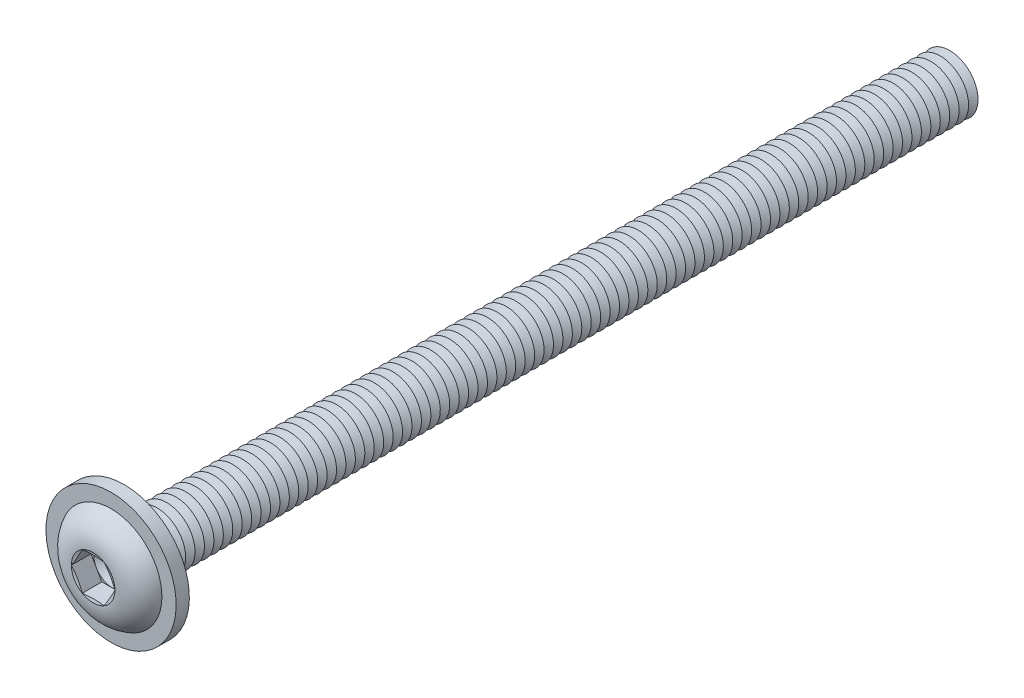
ISO-10303-21;
HEADER;
FILE_DESCRIPTION(('STEP AP214'),'2;1');
FILE_NAME('part.step','',(''),(''),'','','');
FILE_SCHEMA(('AUTOMOTIVE_DESIGN { 1 0 10303 214 1 1 1 1 }'));
ENDSEC;
DATA;
#1=APPLICATION_CONTEXT('core data for automotive mechanical design processes');
#2=APPLICATION_PROTOCOL_DEFINITION('international standard','automotive_design',2000,#1);
#3=PRODUCT_CONTEXT('',#1,'mechanical');
#4=PRODUCT('Part','Part','',(#3));
#5=PRODUCT_RELATED_PRODUCT_CATEGORY('part','',(#4));
#6=PRODUCT_DEFINITION_FORMATION('','',#4);
#7=PRODUCT_DEFINITION_CONTEXT('part definition',#1,'design');
#8=PRODUCT_DEFINITION('design','',#6,#7);
#9=PRODUCT_DEFINITION_SHAPE('','',#8);
#10=(LENGTH_UNIT() NAMED_UNIT(*) SI_UNIT(.MILLI.,.METRE.));
#11=(NAMED_UNIT(*) PLANE_ANGLE_UNIT() SI_UNIT($,.RADIAN.));
#12=(NAMED_UNIT(*) SI_UNIT($,.STERADIAN.) SOLID_ANGLE_UNIT());
#13=UNCERTAINTY_MEASURE_WITH_UNIT(LENGTH_MEASURE(1.E-05),#10,'distance_accuracy_value','');
#14=(GEOMETRIC_REPRESENTATION_CONTEXT(3) GLOBAL_UNCERTAINTY_ASSIGNED_CONTEXT((#13)) GLOBAL_UNIT_ASSIGNED_CONTEXT((#10,
#11,#12)) REPRESENTATION_CONTEXT('',''));
#15=CARTESIAN_POINT('',(0.,0.,0.));
#16=DIRECTION('',(0.,0.,1.));
#17=DIRECTION('',(1.,0.,0.));
#18=AXIS2_PLACEMENT_3D('',#15,#16,#17);
#19=CARTESIAN_POINT('',(0.,0.,-42.25));
#20=DIRECTION('',(0.,0.,1.));
#21=DIRECTION('',(0.,-1.,0.));
#22=AXIS2_PLACEMENT_3D('',#19,#20,#21);
#23=CONICAL_SURFACE('',#22,1.49999999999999,1.0471975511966);
#24=CARTESIAN_POINT('',(0.,0.,-42.5));
#25=DIRECTION('',(0.,0.,1.));
#26=DIRECTION('',(0.,-1.,0.));
#27=AXIS2_PLACEMENT_3D('',#24,#25,#26);
#28=CIRCLE('',#27,1.06698729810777);
#29=CARTESIAN_POINT('',(0.,-1.06698729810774,-42.5));
#30=VERTEX_POINT('',#29);
#31=EDGE_CURVE('E913',#30,#30,#28,.T.);
#32=ORIENTED_EDGE('',*,*,#31,.T.);
#33=EDGE_LOOP('',(#32));
#34=FACE_BOUND('',#33,.T.);
#35=CARTESIAN_POINT('',(0.,0.,-42.25));
#36=DIRECTION('',(0.,0.,1.));
#37=DIRECTION('',(0.,-1.,0.));
#38=AXIS2_PLACEMENT_3D('',#35,#36,#37);
#39=CIRCLE('',#38,1.49999999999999);
#40=CARTESIAN_POINT('',(0.,-1.49999999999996,-42.25));
#41=VERTEX_POINT('',#40);
#42=EDGE_CURVE('E909',#41,#41,#39,.T.);
#43=ORIENTED_EDGE('',*,*,#42,.F.);
#44=EDGE_LOOP('',(#43));
#45=FACE_BOUND('',#44,.T.);
#46=ADVANCED_FACE('F39',(#34,#45),#23,.T.);
#47=CARTESIAN_POINT('',(0.,0.,-42.5));
#48=DIRECTION('',(0.,0.,-1.));
#49=DIRECTION('',(0.,1.,0.));
#50=AXIS2_PLACEMENT_3D('',#47,#48,#49);
#51=CONICAL_SURFACE('',#50,1.06698729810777,1.0471975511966);
#52=CARTESIAN_POINT('',(0.,0.,-42.75));
#53=DIRECTION('',(0.,0.,1.));
#54=DIRECTION('',(0.,-1.,0.));
#55=AXIS2_PLACEMENT_3D('',#52,#53,#54);
#56=CIRCLE('',#55,1.49999999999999);
#57=CARTESIAN_POINT('',(0.,-1.49999999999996,-42.75));
#58=VERTEX_POINT('',#57);
#59=EDGE_CURVE('E917',#58,#58,#56,.T.);
#60=ORIENTED_EDGE('',*,*,#59,.T.);
#61=EDGE_LOOP('',(#60));
#62=FACE_BOUND('',#61,.T.);
#63=ORIENTED_EDGE('',*,*,#31,.F.);
#64=EDGE_LOOP('',(#63));
#65=FACE_BOUND('',#64,.T.);
#66=ADVANCED_FACE('F1033',(#62,#65),#51,.T.);
#67=CARTESIAN_POINT('',(0.,1.5,-44.));
#68=DIRECTION('',(0.,0.,-1.));
#69=DIRECTION('',(0.,1.,0.));
#70=AXIS2_PLACEMENT_3D('',#67,#68,#69);
#71=PLANE('',#70);
#72=CARTESIAN_POINT('',(0.,0.,-44.));
#73=DIRECTION('',(0.,0.,1.));
#74=DIRECTION('',(0.,-1.,0.));
#75=AXIS2_PLACEMENT_3D('',#72,#73,#74);
#76=CIRCLE('',#75,1.06698729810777);
#77=CARTESIAN_POINT('',(0.,-1.06698729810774,-44.));
#78=VERTEX_POINT('',#77);
#79=EDGE_CURVE('E937',#78,#78,#76,.T.);
#80=ORIENTED_EDGE('',*,*,#79,.F.);
#81=EDGE_LOOP('',(#80));
#82=FACE_BOUND('',#81,.T.);
#83=ADVANCED_FACE('F1039',(#82),#71,.T.);
#84=CARTESIAN_POINT('',(0.,0.,-43.75));
#85=DIRECTION('',(0.,0.,1.));
#86=DIRECTION('',(0.,-1.,0.));
#87=AXIS2_PLACEMENT_3D('',#84,#85,#86);
#88=CONICAL_SURFACE('',#87,1.49999999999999,1.0471975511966);
#89=ORIENTED_EDGE('',*,*,#79,.T.);
#90=EDGE_LOOP('',(#89));
#91=FACE_BOUND('',#90,.T.);
#92=CARTESIAN_POINT('',(0.,0.,-43.75));
#93=DIRECTION('',(0.,0.,1.));
#94=DIRECTION('',(0.,-1.,0.));
#95=AXIS2_PLACEMENT_3D('',#92,#93,#94);
#96=CIRCLE('',#95,1.49999999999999);
#97=CARTESIAN_POINT('',(0.,-1.49999999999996,-43.75));
#98=VERTEX_POINT('',#97);
#99=EDGE_CURVE('E933',#98,#98,#96,.T.);
#100=ORIENTED_EDGE('',*,*,#99,.F.);
#101=EDGE_LOOP('',(#100));
#102=FACE_BOUND('',#101,.T.);
#103=ADVANCED_FACE('F1058',(#91,#102),#88,.T.);
#104=CARTESIAN_POINT('',(0.,0.,-43.5));
#105=DIRECTION('',(0.,0.,-1.));
#106=DIRECTION('',(0.,1.,0.));
#107=AXIS2_PLACEMENT_3D('',#104,#105,#106);
#108=CONICAL_SURFACE('',#107,1.06698729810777,1.0471975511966);
#109=ORIENTED_EDGE('',*,*,#99,.T.);
#110=EDGE_LOOP('',(#109));
#111=FACE_BOUND('',#110,.T.);
#112=CARTESIAN_POINT('',(0.,0.,-43.5));
#113=DIRECTION('',(0.,0.,1.));
#114=DIRECTION('',(0.,-1.,0.));
#115=AXIS2_PLACEMENT_3D('',#112,#113,#114);
#116=CIRCLE('',#115,1.06698729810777);
#117=CARTESIAN_POINT('',(0.,-1.06698729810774,-43.5));
#118=VERTEX_POINT('',#117);
#119=EDGE_CURVE('E929',#118,#118,#116,.T.);
#120=ORIENTED_EDGE('',*,*,#119,.F.);
#121=EDGE_LOOP('',(#120));
#122=FACE_BOUND('',#121,.T.);
#123=ADVANCED_FACE('F1055',(#111,#122),#108,.T.);
#124=CARTESIAN_POINT('',(0.,0.,-43.25));
#125=DIRECTION('',(0.,0.,1.));
#126=DIRECTION('',(0.,-1.,0.));
#127=AXIS2_PLACEMENT_3D('',#124,#125,#126);
#128=CONICAL_SURFACE('',#127,1.49999999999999,1.0471975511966);
#129=ORIENTED_EDGE('',*,*,#119,.T.);
#130=EDGE_LOOP('',(#129));
#131=FACE_BOUND('',#130,.T.);
#132=CARTESIAN_POINT('',(0.,0.,-43.25));
#133=DIRECTION('',(0.,0.,1.));
#134=DIRECTION('',(0.,-1.,0.));
#135=AXIS2_PLACEMENT_3D('',#132,#133,#134);
#136=CIRCLE('',#135,1.49999999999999);
#137=CARTESIAN_POINT('',(0.,-1.49999999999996,-43.25));
#138=VERTEX_POINT('',#137);
#139=EDGE_CURVE('E925',#138,#138,#136,.T.);
#140=ORIENTED_EDGE('',*,*,#139,.F.);
#141=EDGE_LOOP('',(#140));
#142=FACE_BOUND('',#141,.T.);
#143=ADVANCED_FACE('F1049',(#131,#142),#128,.T.);
#144=CARTESIAN_POINT('',(0.,0.,-43.));
#145=DIRECTION('',(0.,0.,-1.));
#146=DIRECTION('',(0.,1.,0.));
#147=AXIS2_PLACEMENT_3D('',#144,#145,#146);
#148=CONICAL_SURFACE('',#147,1.06698729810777,1.0471975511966);
#149=ORIENTED_EDGE('',*,*,#139,.T.);
#150=EDGE_LOOP('',(#149));
#151=FACE_BOUND('',#150,.T.);
#152=CARTESIAN_POINT('',(0.,0.,-43.));
#153=DIRECTION('',(0.,0.,1.));
#154=DIRECTION('',(0.,-1.,0.));
#155=AXIS2_PLACEMENT_3D('',#152,#153,#154);
#156=CIRCLE('',#155,1.06698729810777);
#157=CARTESIAN_POINT('',(0.,-1.06698729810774,-43.));
#158=VERTEX_POINT('',#157);
#159=EDGE_CURVE('E921',#158,#158,#156,.T.);
#160=ORIENTED_EDGE('',*,*,#159,.F.);
#161=EDGE_LOOP('',(#160));
#162=FACE_BOUND('',#161,.T.);
#163=ADVANCED_FACE('F1045',(#151,#162),#148,.T.);
#164=CARTESIAN_POINT('',(0.,0.,-42.75));
#165=DIRECTION('',(0.,0.,1.));
#166=DIRECTION('',(0.,-1.,0.));
#167=AXIS2_PLACEMENT_3D('',#164,#165,#166);
#168=CONICAL_SURFACE('',#167,1.49999999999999,1.0471975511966);
#169=ORIENTED_EDGE('',*,*,#159,.T.);
#170=EDGE_LOOP('',(#169));
#171=FACE_BOUND('',#170,.T.);
#172=ORIENTED_EDGE('',*,*,#59,.F.);
#173=EDGE_LOOP('',(#172));
#174=FACE_BOUND('',#173,.T.);
#175=ADVANCED_FACE('F1048',(#171,#174),#168,.T.);
#176=CARTESIAN_POINT('',(0.,0.,-41.75));
#177=DIRECTION('',(0.,0.,1.));
#178=DIRECTION('',(0.,-1.,0.));
#179=AXIS2_PLACEMENT_3D('',#176,#177,#178);
#180=CONICAL_SURFACE('',#179,1.49999999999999,1.0471975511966);
#181=CARTESIAN_POINT('',(0.,0.,-42.));
#182=DIRECTION('',(0.,0.,1.));
#183=DIRECTION('',(0.,-1.,0.));
#184=AXIS2_PLACEMENT_3D('',#181,#182,#183);
#185=CIRCLE('',#184,1.06698729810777);
#186=CARTESIAN_POINT('',(0.,-1.06698729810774,-42.));
#187=VERTEX_POINT('',#186);
#188=EDGE_CURVE('E905',#187,#187,#185,.T.);
#189=ORIENTED_EDGE('',*,*,#188,.T.);
#190=EDGE_LOOP('',(#189));
#191=FACE_BOUND('',#190,.T.);
#192=CARTESIAN_POINT('',(0.,0.,-41.75));
#193=DIRECTION('',(0.,0.,1.));
#194=DIRECTION('',(0.,-1.,0.));
#195=AXIS2_PLACEMENT_3D('',#192,#193,#194);
#196=CIRCLE('',#195,1.49999999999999);
#197=CARTESIAN_POINT('',(0.,-1.49999999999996,-41.75));
#198=VERTEX_POINT('',#197);
#199=EDGE_CURVE('E902',#198,#198,#196,.T.);
#200=ORIENTED_EDGE('',*,*,#199,.F.);
#201=EDGE_LOOP('',(#200));
#202=FACE_BOUND('',#201,.T.);
#203=ADVANCED_FACE('F1053',(#191,#202),#180,.T.);
#204=CARTESIAN_POINT('',(0.,0.,-42.));
#205=DIRECTION('',(0.,0.,-1.));
#206=DIRECTION('',(0.,1.,0.));
#207=AXIS2_PLACEMENT_3D('',#204,#205,#206);
#208=CONICAL_SURFACE('',#207,1.06698729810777,1.0471975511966);
#209=ORIENTED_EDGE('',*,*,#42,.T.);
#210=EDGE_LOOP('',(#209));
#211=FACE_BOUND('',#210,.T.);
#212=ORIENTED_EDGE('',*,*,#188,.F.);
#213=EDGE_LOOP('',(#212));
#214=FACE_BOUND('',#213,.T.);
#215=ADVANCED_FACE('F1104',(#211,#214),#208,.T.);
#216=CARTESIAN_POINT('',(0.,0.,-41.25));
#217=DIRECTION('',(0.,0.,1.));
#218=DIRECTION('',(0.,-1.,0.));
#219=AXIS2_PLACEMENT_3D('',#216,#217,#218);
#220=CONICAL_SURFACE('',#219,1.49999999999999,1.0471975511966);
#221=CARTESIAN_POINT('',(0.,0.,-41.5));
#222=DIRECTION('',(0.,0.,1.));
#223=DIRECTION('',(0.,-1.,0.));
#224=AXIS2_PLACEMENT_3D('',#221,#222,#223);
#225=CIRCLE('',#224,1.06698729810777);
#226=CARTESIAN_POINT('',(0.,-1.06698729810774,-41.5));
#227=VERTEX_POINT('',#226);
#228=EDGE_CURVE('E898',#227,#227,#225,.T.);
#229=ORIENTED_EDGE('',*,*,#228,.T.);
#230=EDGE_LOOP('',(#229));
#231=FACE_BOUND('',#230,.T.);
#232=CARTESIAN_POINT('',(0.,0.,-41.25));
#233=DIRECTION('',(0.,0.,1.));
#234=DIRECTION('',(0.,-1.,0.));
#235=AXIS2_PLACEMENT_3D('',#232,#233,#234);
#236=CIRCLE('',#235,1.49999999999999);
#237=CARTESIAN_POINT('',(0.,-1.49999999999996,-41.25));
#238=VERTEX_POINT('',#237);
#239=EDGE_CURVE('E894',#238,#238,#236,.T.);
#240=ORIENTED_EDGE('',*,*,#239,.F.);
#241=EDGE_LOOP('',(#240));
#242=FACE_BOUND('',#241,.T.);
#243=ADVANCED_FACE('F1110',(#231,#242),#220,.T.);
#244=CARTESIAN_POINT('',(0.,0.,-41.5));
#245=DIRECTION('',(0.,0.,-1.));
#246=DIRECTION('',(0.,1.,0.));
#247=AXIS2_PLACEMENT_3D('',#244,#245,#246);
#248=CONICAL_SURFACE('',#247,1.06698729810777,1.0471975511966);
#249=ORIENTED_EDGE('',*,*,#199,.T.);
#250=EDGE_LOOP('',(#249));
#251=FACE_BOUND('',#250,.T.);
#252=ORIENTED_EDGE('',*,*,#228,.F.);
#253=EDGE_LOOP('',(#252));
#254=FACE_BOUND('',#253,.T.);
#255=ADVANCED_FACE('F1117',(#251,#254),#248,.T.);
#256=CARTESIAN_POINT('',(0.,0.,-40.75));
#257=DIRECTION('',(0.,0.,1.));
#258=DIRECTION('',(0.,-1.,0.));
#259=AXIS2_PLACEMENT_3D('',#256,#257,#258);
#260=CONICAL_SURFACE('',#259,1.49999999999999,1.0471975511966);
#261=CARTESIAN_POINT('',(0.,0.,-41.));
#262=DIRECTION('',(0.,0.,1.));
#263=DIRECTION('',(0.,-1.,0.));
#264=AXIS2_PLACEMENT_3D('',#261,#262,#263);
#265=CIRCLE('',#264,1.06698729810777);
#266=CARTESIAN_POINT('',(0.,-1.06698729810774,-41.));
#267=VERTEX_POINT('',#266);
#268=EDGE_CURVE('E890',#267,#267,#265,.T.);
#269=ORIENTED_EDGE('',*,*,#268,.T.);
#270=EDGE_LOOP('',(#269));
#271=FACE_BOUND('',#270,.T.);
#272=CARTESIAN_POINT('',(0.,0.,-40.75));
#273=DIRECTION('',(0.,0.,1.));
#274=DIRECTION('',(0.,-1.,0.));
#275=AXIS2_PLACEMENT_3D('',#272,#273,#274);
#276=CIRCLE('',#275,1.49999999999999);
#277=CARTESIAN_POINT('',(0.,-1.49999999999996,-40.75));
#278=VERTEX_POINT('',#277);
#279=EDGE_CURVE('E886',#278,#278,#276,.T.);
#280=ORIENTED_EDGE('',*,*,#279,.F.);
#281=EDGE_LOOP('',(#280));
#282=FACE_BOUND('',#281,.T.);
#283=ADVANCED_FACE('F1124',(#271,#282),#260,.T.);
#284=CARTESIAN_POINT('',(0.,0.,-41.));
#285=DIRECTION('',(0.,0.,-1.));
#286=DIRECTION('',(0.,1.,0.));
#287=AXIS2_PLACEMENT_3D('',#284,#285,#286);
#288=CONICAL_SURFACE('',#287,1.06698729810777,1.0471975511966);
#289=ORIENTED_EDGE('',*,*,#239,.T.);
#290=EDGE_LOOP('',(#289));
#291=FACE_BOUND('',#290,.T.);
#292=ORIENTED_EDGE('',*,*,#268,.F.);
#293=EDGE_LOOP('',(#292));
#294=FACE_BOUND('',#293,.T.);
#295=ADVANCED_FACE('F1131',(#291,#294),#288,.T.);
#296=CARTESIAN_POINT('',(0.,0.,-40.25));
#297=DIRECTION('',(0.,0.,1.));
#298=DIRECTION('',(0.,-1.,0.));
#299=AXIS2_PLACEMENT_3D('',#296,#297,#298);
#300=CONICAL_SURFACE('',#299,1.49999999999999,1.0471975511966);
#301=CARTESIAN_POINT('',(0.,0.,-40.5));
#302=DIRECTION('',(0.,0.,1.));
#303=DIRECTION('',(0.,-1.,0.));
#304=AXIS2_PLACEMENT_3D('',#301,#302,#303);
#305=CIRCLE('',#304,1.06698729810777);
#306=CARTESIAN_POINT('',(0.,-1.06698729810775,-40.5));
#307=VERTEX_POINT('',#306);
#308=EDGE_CURVE('E882',#307,#307,#305,.T.);
#309=ORIENTED_EDGE('',*,*,#308,.T.);
#310=EDGE_LOOP('',(#309));
#311=FACE_BOUND('',#310,.T.);
#312=CARTESIAN_POINT('',(0.,0.,-40.25));
#313=DIRECTION('',(0.,0.,1.));
#314=DIRECTION('',(0.,-1.,0.));
#315=AXIS2_PLACEMENT_3D('',#312,#313,#314);
#316=CIRCLE('',#315,1.49999999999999);
#317=CARTESIAN_POINT('',(0.,-1.49999999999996,-40.25));
#318=VERTEX_POINT('',#317);
#319=EDGE_CURVE('E878',#318,#318,#316,.T.);
#320=ORIENTED_EDGE('',*,*,#319,.F.);
#321=EDGE_LOOP('',(#320));
#322=FACE_BOUND('',#321,.T.);
#323=ADVANCED_FACE('F1138',(#311,#322),#300,.T.);
#324=CARTESIAN_POINT('',(0.,0.,-40.5));
#325=DIRECTION('',(0.,0.,-1.));
#326=DIRECTION('',(0.,1.,0.));
#327=AXIS2_PLACEMENT_3D('',#324,#325,#326);
#328=CONICAL_SURFACE('',#327,1.06698729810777,1.0471975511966);
#329=ORIENTED_EDGE('',*,*,#279,.T.);
#330=EDGE_LOOP('',(#329));
#331=FACE_BOUND('',#330,.T.);
#332=ORIENTED_EDGE('',*,*,#308,.F.);
#333=EDGE_LOOP('',(#332));
#334=FACE_BOUND('',#333,.T.);
#335=ADVANCED_FACE('F1145',(#331,#334),#328,.T.);
#336=CARTESIAN_POINT('',(0.,0.,-39.75));
#337=DIRECTION('',(0.,0.,1.));
#338=DIRECTION('',(0.,-1.,0.));
#339=AXIS2_PLACEMENT_3D('',#336,#337,#338);
#340=CONICAL_SURFACE('',#339,1.49999999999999,1.0471975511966);
#341=CARTESIAN_POINT('',(0.,0.,-40.));
#342=DIRECTION('',(0.,0.,1.));
#343=DIRECTION('',(0.,-1.,0.));
#344=AXIS2_PLACEMENT_3D('',#341,#342,#343);
#345=CIRCLE('',#344,1.06698729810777);
#346=CARTESIAN_POINT('',(0.,-1.06698729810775,-40.));
#347=VERTEX_POINT('',#346);
#348=EDGE_CURVE('E874',#347,#347,#345,.T.);
#349=ORIENTED_EDGE('',*,*,#348,.T.);
#350=EDGE_LOOP('',(#349));
#351=FACE_BOUND('',#350,.T.);
#352=CARTESIAN_POINT('',(0.,0.,-39.75));
#353=DIRECTION('',(0.,0.,1.));
#354=DIRECTION('',(0.,-1.,0.));
#355=AXIS2_PLACEMENT_3D('',#352,#353,#354);
#356=CIRCLE('',#355,1.49999999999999);
#357=CARTESIAN_POINT('',(0.,-1.49999999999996,-39.75));
#358=VERTEX_POINT('',#357);
#359=EDGE_CURVE('E870',#358,#358,#356,.T.);
#360=ORIENTED_EDGE('',*,*,#359,.F.);
#361=EDGE_LOOP('',(#360));
#362=FACE_BOUND('',#361,.T.);
#363=ADVANCED_FACE('F1152',(#351,#362),#340,.T.);
#364=CARTESIAN_POINT('',(0.,0.,-40.));
#365=DIRECTION('',(0.,0.,-1.));
#366=DIRECTION('',(0.,1.,0.));
#367=AXIS2_PLACEMENT_3D('',#364,#365,#366);
#368=CONICAL_SURFACE('',#367,1.06698729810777,1.0471975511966);
#369=ORIENTED_EDGE('',*,*,#319,.T.);
#370=EDGE_LOOP('',(#369));
#371=FACE_BOUND('',#370,.T.);
#372=ORIENTED_EDGE('',*,*,#348,.F.);
#373=EDGE_LOOP('',(#372));
#374=FACE_BOUND('',#373,.T.);
#375=ADVANCED_FACE('F1159',(#371,#374),#368,.T.);
#376=CARTESIAN_POINT('',(0.,0.,-39.25));
#377=DIRECTION('',(0.,0.,1.));
#378=DIRECTION('',(0.,-1.,0.));
#379=AXIS2_PLACEMENT_3D('',#376,#377,#378);
#380=CONICAL_SURFACE('',#379,1.49999999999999,1.0471975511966);
#381=CARTESIAN_POINT('',(0.,0.,-39.5));
#382=DIRECTION('',(0.,0.,1.));
#383=DIRECTION('',(0.,-1.,0.));
#384=AXIS2_PLACEMENT_3D('',#381,#382,#383);
#385=CIRCLE('',#384,1.06698729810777);
#386=CARTESIAN_POINT('',(0.,-1.06698729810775,-39.5));
#387=VERTEX_POINT('',#386);
#388=EDGE_CURVE('E866',#387,#387,#385,.T.);
#389=ORIENTED_EDGE('',*,*,#388,.T.);
#390=EDGE_LOOP('',(#389));
#391=FACE_BOUND('',#390,.T.);
#392=CARTESIAN_POINT('',(0.,0.,-39.25));
#393=DIRECTION('',(0.,0.,1.));
#394=DIRECTION('',(0.,-1.,0.));
#395=AXIS2_PLACEMENT_3D('',#392,#393,#394);
#396=CIRCLE('',#395,1.49999999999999);
#397=CARTESIAN_POINT('',(0.,-1.49999999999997,-39.25));
#398=VERTEX_POINT('',#397);
#399=EDGE_CURVE('E862',#398,#398,#396,.T.);
#400=ORIENTED_EDGE('',*,*,#399,.F.);
#401=EDGE_LOOP('',(#400));
#402=FACE_BOUND('',#401,.T.);
#403=ADVANCED_FACE('F1166',(#391,#402),#380,.T.);
#404=CARTESIAN_POINT('',(0.,0.,-39.5));
#405=DIRECTION('',(0.,0.,-1.));
#406=DIRECTION('',(0.,1.,0.));
#407=AXIS2_PLACEMENT_3D('',#404,#405,#406);
#408=CONICAL_SURFACE('',#407,1.06698729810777,1.0471975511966);
#409=ORIENTED_EDGE('',*,*,#359,.T.);
#410=EDGE_LOOP('',(#409));
#411=FACE_BOUND('',#410,.T.);
#412=ORIENTED_EDGE('',*,*,#388,.F.);
#413=EDGE_LOOP('',(#412));
#414=FACE_BOUND('',#413,.T.);
#415=ADVANCED_FACE('F1173',(#411,#414),#408,.T.);
#416=CARTESIAN_POINT('',(0.,0.,-38.75));
#417=DIRECTION('',(0.,0.,1.));
#418=DIRECTION('',(0.,-1.,0.));
#419=AXIS2_PLACEMENT_3D('',#416,#417,#418);
#420=CONICAL_SURFACE('',#419,1.49999999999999,1.0471975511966);
#421=CARTESIAN_POINT('',(0.,0.,-39.));
#422=DIRECTION('',(0.,0.,1.));
#423=DIRECTION('',(0.,-1.,0.));
#424=AXIS2_PLACEMENT_3D('',#421,#422,#423);
#425=CIRCLE('',#424,1.06698729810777);
#426=CARTESIAN_POINT('',(0.,-1.06698729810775,-39.));
#427=VERTEX_POINT('',#426);
#428=EDGE_CURVE('E858',#427,#427,#425,.T.);
#429=ORIENTED_EDGE('',*,*,#428,.T.);
#430=EDGE_LOOP('',(#429));
#431=FACE_BOUND('',#430,.T.);
#432=CARTESIAN_POINT('',(0.,0.,-38.75));
#433=DIRECTION('',(0.,0.,1.));
#434=DIRECTION('',(0.,-1.,0.));
#435=AXIS2_PLACEMENT_3D('',#432,#433,#434);
#436=CIRCLE('',#435,1.49999999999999);
#437=CARTESIAN_POINT('',(0.,-1.49999999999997,-38.75));
#438=VERTEX_POINT('',#437);
#439=EDGE_CURVE('E854',#438,#438,#436,.T.);
#440=ORIENTED_EDGE('',*,*,#439,.F.);
#441=EDGE_LOOP('',(#440));
#442=FACE_BOUND('',#441,.T.);
#443=ADVANCED_FACE('F1180',(#431,#442),#420,.T.);
#444=CARTESIAN_POINT('',(0.,0.,-39.));
#445=DIRECTION('',(0.,0.,-1.));
#446=DIRECTION('',(0.,1.,0.));
#447=AXIS2_PLACEMENT_3D('',#444,#445,#446);
#448=CONICAL_SURFACE('',#447,1.06698729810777,1.0471975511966);
#449=ORIENTED_EDGE('',*,*,#399,.T.);
#450=EDGE_LOOP('',(#449));
#451=FACE_BOUND('',#450,.T.);
#452=ORIENTED_EDGE('',*,*,#428,.F.);
#453=EDGE_LOOP('',(#452));
#454=FACE_BOUND('',#453,.T.);
#455=ADVANCED_FACE('F1187',(#451,#454),#448,.T.);
#456=CARTESIAN_POINT('',(0.,0.,-38.25));
#457=DIRECTION('',(0.,0.,1.));
#458=DIRECTION('',(0.,-1.,0.));
#459=AXIS2_PLACEMENT_3D('',#456,#457,#458);
#460=CONICAL_SURFACE('',#459,1.49999999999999,1.0471975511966);
#461=CARTESIAN_POINT('',(0.,0.,-38.5));
#462=DIRECTION('',(0.,0.,1.));
#463=DIRECTION('',(0.,-1.,0.));
#464=AXIS2_PLACEMENT_3D('',#461,#462,#463);
#465=CIRCLE('',#464,1.06698729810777);
#466=CARTESIAN_POINT('',(0.,-1.06698729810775,-38.5));
#467=VERTEX_POINT('',#466);
#468=EDGE_CURVE('E850',#467,#467,#465,.T.);
#469=ORIENTED_EDGE('',*,*,#468,.T.);
#470=EDGE_LOOP('',(#469));
#471=FACE_BOUND('',#470,.T.);
#472=CARTESIAN_POINT('',(0.,0.,-38.25));
#473=DIRECTION('',(0.,0.,1.));
#474=DIRECTION('',(0.,-1.,0.));
#475=AXIS2_PLACEMENT_3D('',#472,#473,#474);
#476=CIRCLE('',#475,1.49999999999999);
#477=CARTESIAN_POINT('',(0.,-1.49999999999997,-38.25));
#478=VERTEX_POINT('',#477);
#479=EDGE_CURVE('E846',#478,#478,#476,.T.);
#480=ORIENTED_EDGE('',*,*,#479,.F.);
#481=EDGE_LOOP('',(#480));
#482=FACE_BOUND('',#481,.T.);
#483=ADVANCED_FACE('F1194',(#471,#482),#460,.T.);
#484=CARTESIAN_POINT('',(0.,0.,-38.5));
#485=DIRECTION('',(0.,0.,-1.));
#486=DIRECTION('',(0.,1.,0.));
#487=AXIS2_PLACEMENT_3D('',#484,#485,#486);
#488=CONICAL_SURFACE('',#487,1.06698729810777,1.0471975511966);
#489=ORIENTED_EDGE('',*,*,#439,.T.);
#490=EDGE_LOOP('',(#489));
#491=FACE_BOUND('',#490,.T.);
#492=ORIENTED_EDGE('',*,*,#468,.F.);
#493=EDGE_LOOP('',(#492));
#494=FACE_BOUND('',#493,.T.);
#495=ADVANCED_FACE('F1201',(#491,#494),#488,.T.);
#496=CARTESIAN_POINT('',(0.,0.,-37.75));
#497=DIRECTION('',(0.,0.,1.));
#498=DIRECTION('',(0.,-1.,0.));
#499=AXIS2_PLACEMENT_3D('',#496,#497,#498);
#500=CONICAL_SURFACE('',#499,1.49999999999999,1.0471975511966);
#501=CARTESIAN_POINT('',(0.,0.,-38.));
#502=DIRECTION('',(0.,0.,1.));
#503=DIRECTION('',(0.,-1.,0.));
#504=AXIS2_PLACEMENT_3D('',#501,#502,#503);
#505=CIRCLE('',#504,1.06698729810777);
#506=CARTESIAN_POINT('',(0.,-1.06698729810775,-38.));
#507=VERTEX_POINT('',#506);
#508=EDGE_CURVE('E842',#507,#507,#505,.T.);
#509=ORIENTED_EDGE('',*,*,#508,.T.);
#510=EDGE_LOOP('',(#509));
#511=FACE_BOUND('',#510,.T.);
#512=CARTESIAN_POINT('',(0.,0.,-37.75));
#513=DIRECTION('',(0.,0.,1.));
#514=DIRECTION('',(0.,-1.,0.));
#515=AXIS2_PLACEMENT_3D('',#512,#513,#514);
#516=CIRCLE('',#515,1.49999999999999);
#517=CARTESIAN_POINT('',(0.,-1.49999999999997,-37.75));
#518=VERTEX_POINT('',#517);
#519=EDGE_CURVE('E838',#518,#518,#516,.T.);
#520=ORIENTED_EDGE('',*,*,#519,.F.);
#521=EDGE_LOOP('',(#520));
#522=FACE_BOUND('',#521,.T.);
#523=ADVANCED_FACE('F1208',(#511,#522),#500,.T.);
#524=CARTESIAN_POINT('',(0.,0.,-38.));
#525=DIRECTION('',(0.,0.,-1.));
#526=DIRECTION('',(0.,1.,0.));
#527=AXIS2_PLACEMENT_3D('',#524,#525,#526);
#528=CONICAL_SURFACE('',#527,1.06698729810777,1.0471975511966);
#529=ORIENTED_EDGE('',*,*,#479,.T.);
#530=EDGE_LOOP('',(#529));
#531=FACE_BOUND('',#530,.T.);
#532=ORIENTED_EDGE('',*,*,#508,.F.);
#533=EDGE_LOOP('',(#532));
#534=FACE_BOUND('',#533,.T.);
#535=ADVANCED_FACE('F1215',(#531,#534),#528,.T.);
#536=CARTESIAN_POINT('',(0.,0.,-37.25));
#537=DIRECTION('',(0.,0.,1.));
#538=DIRECTION('',(0.,-1.,0.));
#539=AXIS2_PLACEMENT_3D('',#536,#537,#538);
#540=CONICAL_SURFACE('',#539,1.49999999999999,1.0471975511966);
#541=CARTESIAN_POINT('',(0.,0.,-37.5));
#542=DIRECTION('',(0.,0.,1.));
#543=DIRECTION('',(0.,-1.,0.));
#544=AXIS2_PLACEMENT_3D('',#541,#542,#543);
#545=CIRCLE('',#544,1.06698729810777);
#546=CARTESIAN_POINT('',(0.,-1.06698729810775,-37.5));
#547=VERTEX_POINT('',#546);
#548=EDGE_CURVE('E834',#547,#547,#545,.T.);
#549=ORIENTED_EDGE('',*,*,#548,.T.);
#550=EDGE_LOOP('',(#549));
#551=FACE_BOUND('',#550,.T.);
#552=CARTESIAN_POINT('',(0.,0.,-37.25));
#553=DIRECTION('',(0.,0.,1.));
#554=DIRECTION('',(0.,-1.,0.));
#555=AXIS2_PLACEMENT_3D('',#552,#553,#554);
#556=CIRCLE('',#555,1.49999999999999);
#557=CARTESIAN_POINT('',(0.,-1.49999999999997,-37.25));
#558=VERTEX_POINT('',#557);
#559=EDGE_CURVE('E830',#558,#558,#556,.T.);
#560=ORIENTED_EDGE('',*,*,#559,.F.);
#561=EDGE_LOOP('',(#560));
#562=FACE_BOUND('',#561,.T.);
#563=ADVANCED_FACE('F1222',(#551,#562),#540,.T.);
#564=CARTESIAN_POINT('',(0.,0.,-37.5));
#565=DIRECTION('',(0.,0.,-1.));
#566=DIRECTION('',(0.,1.,0.));
#567=AXIS2_PLACEMENT_3D('',#564,#565,#566);
#568=CONICAL_SURFACE('',#567,1.06698729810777,1.0471975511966);
#569=ORIENTED_EDGE('',*,*,#519,.T.);
#570=EDGE_LOOP('',(#569));
#571=FACE_BOUND('',#570,.T.);
#572=ORIENTED_EDGE('',*,*,#548,.F.);
#573=EDGE_LOOP('',(#572));
#574=FACE_BOUND('',#573,.T.);
#575=ADVANCED_FACE('F1229',(#571,#574),#568,.T.);
#576=CARTESIAN_POINT('',(0.,0.,-36.75));
#577=DIRECTION('',(0.,0.,1.));
#578=DIRECTION('',(0.,-1.,0.));
#579=AXIS2_PLACEMENT_3D('',#576,#577,#578);
#580=CONICAL_SURFACE('',#579,1.49999999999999,1.0471975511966);
#581=CARTESIAN_POINT('',(0.,0.,-37.));
#582=DIRECTION('',(0.,0.,1.));
#583=DIRECTION('',(0.,-1.,0.));
#584=AXIS2_PLACEMENT_3D('',#581,#582,#583);
#585=CIRCLE('',#584,1.06698729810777);
#586=CARTESIAN_POINT('',(0.,-1.06698729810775,-37.));
#587=VERTEX_POINT('',#586);
#588=EDGE_CURVE('E826',#587,#587,#585,.T.);
#589=ORIENTED_EDGE('',*,*,#588,.T.);
#590=EDGE_LOOP('',(#589));
#591=FACE_BOUND('',#590,.T.);
#592=CARTESIAN_POINT('',(0.,0.,-36.75));
#593=DIRECTION('',(0.,0.,1.));
#594=DIRECTION('',(0.,-1.,0.));
#595=AXIS2_PLACEMENT_3D('',#592,#593,#594);
#596=CIRCLE('',#595,1.49999999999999);
#597=CARTESIAN_POINT('',(0.,-1.49999999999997,-36.75));
#598=VERTEX_POINT('',#597);
#599=EDGE_CURVE('E822',#598,#598,#596,.T.);
#600=ORIENTED_EDGE('',*,*,#599,.F.);
#601=EDGE_LOOP('',(#600));
#602=FACE_BOUND('',#601,.T.);
#603=ADVANCED_FACE('F1236',(#591,#602),#580,.T.);
#604=CARTESIAN_POINT('',(0.,0.,-37.));
#605=DIRECTION('',(0.,0.,-1.));
#606=DIRECTION('',(0.,1.,0.));
#607=AXIS2_PLACEMENT_3D('',#604,#605,#606);
#608=CONICAL_SURFACE('',#607,1.06698729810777,1.0471975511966);
#609=ORIENTED_EDGE('',*,*,#559,.T.);
#610=EDGE_LOOP('',(#609));
#611=FACE_BOUND('',#610,.T.);
#612=ORIENTED_EDGE('',*,*,#588,.F.);
#613=EDGE_LOOP('',(#612));
#614=FACE_BOUND('',#613,.T.);
#615=ADVANCED_FACE('F1243',(#611,#614),#608,.T.);
#616=CARTESIAN_POINT('',(0.,0.,-36.25));
#617=DIRECTION('',(0.,0.,1.));
#618=DIRECTION('',(0.,-1.,0.));
#619=AXIS2_PLACEMENT_3D('',#616,#617,#618);
#620=CONICAL_SURFACE('',#619,1.49999999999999,1.0471975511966);
#621=CARTESIAN_POINT('',(0.,0.,-36.5));
#622=DIRECTION('',(0.,0.,1.));
#623=DIRECTION('',(0.,-1.,0.));
#624=AXIS2_PLACEMENT_3D('',#621,#622,#623);
#625=CIRCLE('',#624,1.06698729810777);
#626=CARTESIAN_POINT('',(0.,-1.06698729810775,-36.5));
#627=VERTEX_POINT('',#626);
#628=EDGE_CURVE('E818',#627,#627,#625,.T.);
#629=ORIENTED_EDGE('',*,*,#628,.T.);
#630=EDGE_LOOP('',(#629));
#631=FACE_BOUND('',#630,.T.);
#632=CARTESIAN_POINT('',(0.,0.,-36.25));
#633=DIRECTION('',(0.,0.,1.));
#634=DIRECTION('',(0.,-1.,0.));
#635=AXIS2_PLACEMENT_3D('',#632,#633,#634);
#636=CIRCLE('',#635,1.49999999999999);
#637=CARTESIAN_POINT('',(0.,-1.49999999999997,-36.25));
#638=VERTEX_POINT('',#637);
#639=EDGE_CURVE('E814',#638,#638,#636,.T.);
#640=ORIENTED_EDGE('',*,*,#639,.F.);
#641=EDGE_LOOP('',(#640));
#642=FACE_BOUND('',#641,.T.);
#643=ADVANCED_FACE('F1250',(#631,#642),#620,.T.);
#644=CARTESIAN_POINT('',(0.,0.,-36.5));
#645=DIRECTION('',(0.,0.,-1.));
#646=DIRECTION('',(0.,1.,0.));
#647=AXIS2_PLACEMENT_3D('',#644,#645,#646);
#648=CONICAL_SURFACE('',#647,1.06698729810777,1.0471975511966);
#649=ORIENTED_EDGE('',*,*,#599,.T.);
#650=EDGE_LOOP('',(#649));
#651=FACE_BOUND('',#650,.T.);
#652=ORIENTED_EDGE('',*,*,#628,.F.);
#653=EDGE_LOOP('',(#652));
#654=FACE_BOUND('',#653,.T.);
#655=ADVANCED_FACE('F1257',(#651,#654),#648,.T.);
#656=CARTESIAN_POINT('',(0.,0.,-35.75));
#657=DIRECTION('',(0.,0.,1.));
#658=DIRECTION('',(0.,-1.,0.));
#659=AXIS2_PLACEMENT_3D('',#656,#657,#658);
#660=CONICAL_SURFACE('',#659,1.49999999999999,1.0471975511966);
#661=CARTESIAN_POINT('',(0.,0.,-36.));
#662=DIRECTION('',(0.,0.,1.));
#663=DIRECTION('',(0.,-1.,0.));
#664=AXIS2_PLACEMENT_3D('',#661,#662,#663);
#665=CIRCLE('',#664,1.06698729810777);
#666=CARTESIAN_POINT('',(0.,-1.06698729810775,-36.));
#667=VERTEX_POINT('',#666);
#668=EDGE_CURVE('E810',#667,#667,#665,.T.);
#669=ORIENTED_EDGE('',*,*,#668,.T.);
#670=EDGE_LOOP('',(#669));
#671=FACE_BOUND('',#670,.T.);
#672=CARTESIAN_POINT('',(0.,0.,-35.75));
#673=DIRECTION('',(0.,0.,1.));
#674=DIRECTION('',(0.,-1.,0.));
#675=AXIS2_PLACEMENT_3D('',#672,#673,#674);
#676=CIRCLE('',#675,1.49999999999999);
#677=CARTESIAN_POINT('',(0.,-1.49999999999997,-35.75));
#678=VERTEX_POINT('',#677);
#679=EDGE_CURVE('E806',#678,#678,#676,.T.);
#680=ORIENTED_EDGE('',*,*,#679,.F.);
#681=EDGE_LOOP('',(#680));
#682=FACE_BOUND('',#681,.T.);
#683=ADVANCED_FACE('F1264',(#671,#682),#660,.T.);
#684=CARTESIAN_POINT('',(0.,0.,-36.));
#685=DIRECTION('',(0.,0.,-1.));
#686=DIRECTION('',(0.,1.,0.));
#687=AXIS2_PLACEMENT_3D('',#684,#685,#686);
#688=CONICAL_SURFACE('',#687,1.06698729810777,1.0471975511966);
#689=ORIENTED_EDGE('',*,*,#639,.T.);
#690=EDGE_LOOP('',(#689));
#691=FACE_BOUND('',#690,.T.);
#692=ORIENTED_EDGE('',*,*,#668,.F.);
#693=EDGE_LOOP('',(#692));
#694=FACE_BOUND('',#693,.T.);
#695=ADVANCED_FACE('F1271',(#691,#694),#688,.T.);
#696=CARTESIAN_POINT('',(0.,0.,-35.25));
#697=DIRECTION('',(0.,0.,1.));
#698=DIRECTION('',(0.,-1.,0.));
#699=AXIS2_PLACEMENT_3D('',#696,#697,#698);
#700=CONICAL_SURFACE('',#699,1.49999999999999,1.0471975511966);
#701=CARTESIAN_POINT('',(0.,0.,-35.5));
#702=DIRECTION('',(0.,0.,1.));
#703=DIRECTION('',(0.,-1.,0.));
#704=AXIS2_PLACEMENT_3D('',#701,#702,#703);
#705=CIRCLE('',#704,1.06698729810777);
#706=CARTESIAN_POINT('',(0.,-1.06698729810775,-35.5));
#707=VERTEX_POINT('',#706);
#708=EDGE_CURVE('E802',#707,#707,#705,.T.);
#709=ORIENTED_EDGE('',*,*,#708,.T.);
#710=EDGE_LOOP('',(#709));
#711=FACE_BOUND('',#710,.T.);
#712=CARTESIAN_POINT('',(0.,0.,-35.25));
#713=DIRECTION('',(0.,0.,1.));
#714=DIRECTION('',(0.,-1.,0.));
#715=AXIS2_PLACEMENT_3D('',#712,#713,#714);
#716=CIRCLE('',#715,1.49999999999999);
#717=CARTESIAN_POINT('',(0.,-1.49999999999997,-35.25));
#718=VERTEX_POINT('',#717);
#719=EDGE_CURVE('E798',#718,#718,#716,.T.);
#720=ORIENTED_EDGE('',*,*,#719,.F.);
#721=EDGE_LOOP('',(#720));
#722=FACE_BOUND('',#721,.T.);
#723=ADVANCED_FACE('F1278',(#711,#722),#700,.T.);
#724=CARTESIAN_POINT('',(0.,0.,-35.5));
#725=DIRECTION('',(0.,0.,-1.));
#726=DIRECTION('',(0.,1.,0.));
#727=AXIS2_PLACEMENT_3D('',#724,#725,#726);
#728=CONICAL_SURFACE('',#727,1.06698729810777,1.0471975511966);
#729=ORIENTED_EDGE('',*,*,#679,.T.);
#730=EDGE_LOOP('',(#729));
#731=FACE_BOUND('',#730,.T.);
#732=ORIENTED_EDGE('',*,*,#708,.F.);
#733=EDGE_LOOP('',(#732));
#734=FACE_BOUND('',#733,.T.);
#735=ADVANCED_FACE('F1285',(#731,#734),#728,.T.);
#736=CARTESIAN_POINT('',(0.,0.,-34.75));
#737=DIRECTION('',(0.,0.,1.));
#738=DIRECTION('',(0.,-1.,0.));
#739=AXIS2_PLACEMENT_3D('',#736,#737,#738);
#740=CONICAL_SURFACE('',#739,1.49999999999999,1.0471975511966);
#741=CARTESIAN_POINT('',(0.,0.,-35.));
#742=DIRECTION('',(0.,0.,1.));
#743=DIRECTION('',(0.,-1.,0.));
#744=AXIS2_PLACEMENT_3D('',#741,#742,#743);
#745=CIRCLE('',#744,1.06698729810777);
#746=CARTESIAN_POINT('',(0.,-1.06698729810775,-35.));
#747=VERTEX_POINT('',#746);
#748=EDGE_CURVE('E794',#747,#747,#745,.T.);
#749=ORIENTED_EDGE('',*,*,#748,.T.);
#750=EDGE_LOOP('',(#749));
#751=FACE_BOUND('',#750,.T.);
#752=CARTESIAN_POINT('',(0.,0.,-34.75));
#753=DIRECTION('',(0.,0.,1.));
#754=DIRECTION('',(0.,-1.,0.));
#755=AXIS2_PLACEMENT_3D('',#752,#753,#754);
#756=CIRCLE('',#755,1.49999999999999);
#757=CARTESIAN_POINT('',(0.,-1.49999999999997,-34.75));
#758=VERTEX_POINT('',#757);
#759=EDGE_CURVE('E790',#758,#758,#756,.T.);
#760=ORIENTED_EDGE('',*,*,#759,.F.);
#761=EDGE_LOOP('',(#760));
#762=FACE_BOUND('',#761,.T.);
#763=ADVANCED_FACE('F1292',(#751,#762),#740,.T.);
#764=CARTESIAN_POINT('',(0.,0.,-35.));
#765=DIRECTION('',(0.,0.,-1.));
#766=DIRECTION('',(0.,1.,0.));
#767=AXIS2_PLACEMENT_3D('',#764,#765,#766);
#768=CONICAL_SURFACE('',#767,1.06698729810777,1.0471975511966);
#769=ORIENTED_EDGE('',*,*,#719,.T.);
#770=EDGE_LOOP('',(#769));
#771=FACE_BOUND('',#770,.T.);
#772=ORIENTED_EDGE('',*,*,#748,.F.);
#773=EDGE_LOOP('',(#772));
#774=FACE_BOUND('',#773,.T.);
#775=ADVANCED_FACE('F1299',(#771,#774),#768,.T.);
#776=CARTESIAN_POINT('',(0.,0.,-34.25));
#777=DIRECTION('',(0.,0.,1.));
#778=DIRECTION('',(0.,-1.,0.));
#779=AXIS2_PLACEMENT_3D('',#776,#777,#778);
#780=CONICAL_SURFACE('',#779,1.49999999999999,1.0471975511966);
#781=CARTESIAN_POINT('',(0.,0.,-34.5));
#782=DIRECTION('',(0.,0.,1.));
#783=DIRECTION('',(0.,-1.,0.));
#784=AXIS2_PLACEMENT_3D('',#781,#782,#783);
#785=CIRCLE('',#784,1.06698729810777);
#786=CARTESIAN_POINT('',(0.,-1.06698729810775,-34.5));
#787=VERTEX_POINT('',#786);
#788=EDGE_CURVE('E786',#787,#787,#785,.T.);
#789=ORIENTED_EDGE('',*,*,#788,.T.);
#790=EDGE_LOOP('',(#789));
#791=FACE_BOUND('',#790,.T.);
#792=CARTESIAN_POINT('',(0.,0.,-34.25));
#793=DIRECTION('',(0.,0.,1.));
#794=DIRECTION('',(0.,-1.,0.));
#795=AXIS2_PLACEMENT_3D('',#792,#793,#794);
#796=CIRCLE('',#795,1.49999999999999);
#797=CARTESIAN_POINT('',(0.,-1.49999999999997,-34.25));
#798=VERTEX_POINT('',#797);
#799=EDGE_CURVE('E782',#798,#798,#796,.T.);
#800=ORIENTED_EDGE('',*,*,#799,.F.);
#801=EDGE_LOOP('',(#800));
#802=FACE_BOUND('',#801,.T.);
#803=ADVANCED_FACE('F1306',(#791,#802),#780,.T.);
#804=CARTESIAN_POINT('',(0.,0.,-34.5));
#805=DIRECTION('',(0.,0.,-1.));
#806=DIRECTION('',(0.,1.,0.));
#807=AXIS2_PLACEMENT_3D('',#804,#805,#806);
#808=CONICAL_SURFACE('',#807,1.06698729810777,1.0471975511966);
#809=ORIENTED_EDGE('',*,*,#759,.T.);
#810=EDGE_LOOP('',(#809));
#811=FACE_BOUND('',#810,.T.);
#812=ORIENTED_EDGE('',*,*,#788,.F.);
#813=EDGE_LOOP('',(#812));
#814=FACE_BOUND('',#813,.T.);
#815=ADVANCED_FACE('F1313',(#811,#814),#808,.T.);
#816=CARTESIAN_POINT('',(0.,0.,-33.75));
#817=DIRECTION('',(0.,0.,1.));
#818=DIRECTION('',(0.,-1.,0.));
#819=AXIS2_PLACEMENT_3D('',#816,#817,#818);
#820=CONICAL_SURFACE('',#819,1.49999999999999,1.0471975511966);
#821=CARTESIAN_POINT('',(0.,0.,-34.));
#822=DIRECTION('',(0.,0.,1.));
#823=DIRECTION('',(0.,-1.,0.));
#824=AXIS2_PLACEMENT_3D('',#821,#822,#823);
#825=CIRCLE('',#824,1.06698729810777);
#826=CARTESIAN_POINT('',(0.,-1.06698729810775,-34.));
#827=VERTEX_POINT('',#826);
#828=EDGE_CURVE('E778',#827,#827,#825,.T.);
#829=ORIENTED_EDGE('',*,*,#828,.T.);
#830=EDGE_LOOP('',(#829));
#831=FACE_BOUND('',#830,.T.);
#832=CARTESIAN_POINT('',(0.,0.,-33.75));
#833=DIRECTION('',(0.,0.,1.));
#834=DIRECTION('',(0.,-1.,0.));
#835=AXIS2_PLACEMENT_3D('',#832,#833,#834);
#836=CIRCLE('',#835,1.49999999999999);
#837=CARTESIAN_POINT('',(0.,-1.49999999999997,-33.75));
#838=VERTEX_POINT('',#837);
#839=EDGE_CURVE('E774',#838,#838,#836,.T.);
#840=ORIENTED_EDGE('',*,*,#839,.F.);
#841=EDGE_LOOP('',(#840));
#842=FACE_BOUND('',#841,.T.);
#843=ADVANCED_FACE('F1320',(#831,#842),#820,.T.);
#844=CARTESIAN_POINT('',(0.,0.,-34.));
#845=DIRECTION('',(0.,0.,-1.));
#846=DIRECTION('',(0.,1.,0.));
#847=AXIS2_PLACEMENT_3D('',#844,#845,#846);
#848=CONICAL_SURFACE('',#847,1.06698729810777,1.0471975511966);
#849=ORIENTED_EDGE('',*,*,#799,.T.);
#850=EDGE_LOOP('',(#849));
#851=FACE_BOUND('',#850,.T.);
#852=ORIENTED_EDGE('',*,*,#828,.F.);
#853=EDGE_LOOP('',(#852));
#854=FACE_BOUND('',#853,.T.);
#855=ADVANCED_FACE('F1327',(#851,#854),#848,.T.);
#856=CARTESIAN_POINT('',(0.,0.,-33.25));
#857=DIRECTION('',(0.,0.,1.));
#858=DIRECTION('',(0.,-1.,0.));
#859=AXIS2_PLACEMENT_3D('',#856,#857,#858);
#860=CONICAL_SURFACE('',#859,1.49999999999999,1.0471975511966);
#861=CARTESIAN_POINT('',(0.,0.,-33.5));
#862=DIRECTION('',(0.,0.,1.));
#863=DIRECTION('',(0.,-1.,0.));
#864=AXIS2_PLACEMENT_3D('',#861,#862,#863);
#865=CIRCLE('',#864,1.06698729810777);
#866=CARTESIAN_POINT('',(0.,-1.06698729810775,-33.5));
#867=VERTEX_POINT('',#866);
#868=EDGE_CURVE('E770',#867,#867,#865,.T.);
#869=ORIENTED_EDGE('',*,*,#868,.T.);
#870=EDGE_LOOP('',(#869));
#871=FACE_BOUND('',#870,.T.);
#872=CARTESIAN_POINT('',(0.,0.,-33.25));
#873=DIRECTION('',(0.,0.,1.));
#874=DIRECTION('',(0.,-1.,0.));
#875=AXIS2_PLACEMENT_3D('',#872,#873,#874);
#876=CIRCLE('',#875,1.49999999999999);
#877=CARTESIAN_POINT('',(0.,-1.49999999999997,-33.25));
#878=VERTEX_POINT('',#877);
#879=EDGE_CURVE('E766',#878,#878,#876,.T.);
#880=ORIENTED_EDGE('',*,*,#879,.F.);
#881=EDGE_LOOP('',(#880));
#882=FACE_BOUND('',#881,.T.);
#883=ADVANCED_FACE('F1334',(#871,#882),#860,.T.);
#884=CARTESIAN_POINT('',(0.,0.,-33.5));
#885=DIRECTION('',(0.,0.,-1.));
#886=DIRECTION('',(0.,1.,0.));
#887=AXIS2_PLACEMENT_3D('',#884,#885,#886);
#888=CONICAL_SURFACE('',#887,1.06698729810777,1.0471975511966);
#889=ORIENTED_EDGE('',*,*,#839,.T.);
#890=EDGE_LOOP('',(#889));
#891=FACE_BOUND('',#890,.T.);
#892=ORIENTED_EDGE('',*,*,#868,.F.);
#893=EDGE_LOOP('',(#892));
#894=FACE_BOUND('',#893,.T.);
#895=ADVANCED_FACE('F1341',(#891,#894),#888,.T.);
#896=CARTESIAN_POINT('',(0.,0.,-32.75));
#897=DIRECTION('',(0.,0.,1.));
#898=DIRECTION('',(0.,-1.,0.));
#899=AXIS2_PLACEMENT_3D('',#896,#897,#898);
#900=CONICAL_SURFACE('',#899,1.49999999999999,1.0471975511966);
#901=CARTESIAN_POINT('',(0.,0.,-33.));
#902=DIRECTION('',(0.,0.,1.));
#903=DIRECTION('',(0.,-1.,0.));
#904=AXIS2_PLACEMENT_3D('',#901,#902,#903);
#905=CIRCLE('',#904,1.06698729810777);
#906=CARTESIAN_POINT('',(0.,-1.06698729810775,-33.));
#907=VERTEX_POINT('',#906);
#908=EDGE_CURVE('E762',#907,#907,#905,.T.);
#909=ORIENTED_EDGE('',*,*,#908,.T.);
#910=EDGE_LOOP('',(#909));
#911=FACE_BOUND('',#910,.T.);
#912=CARTESIAN_POINT('',(0.,0.,-32.75));
#913=DIRECTION('',(0.,0.,1.));
#914=DIRECTION('',(0.,-1.,0.));
#915=AXIS2_PLACEMENT_3D('',#912,#913,#914);
#916=CIRCLE('',#915,1.49999999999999);
#917=CARTESIAN_POINT('',(0.,-1.49999999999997,-32.75));
#918=VERTEX_POINT('',#917);
#919=EDGE_CURVE('E758',#918,#918,#916,.T.);
#920=ORIENTED_EDGE('',*,*,#919,.F.);
#921=EDGE_LOOP('',(#920));
#922=FACE_BOUND('',#921,.T.);
#923=ADVANCED_FACE('F1348',(#911,#922),#900,.T.);
#924=CARTESIAN_POINT('',(0.,0.,-33.));
#925=DIRECTION('',(0.,0.,-1.));
#926=DIRECTION('',(0.,1.,0.));
#927=AXIS2_PLACEMENT_3D('',#924,#925,#926);
#928=CONICAL_SURFACE('',#927,1.06698729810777,1.0471975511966);
#929=ORIENTED_EDGE('',*,*,#879,.T.);
#930=EDGE_LOOP('',(#929));
#931=FACE_BOUND('',#930,.T.);
#932=ORIENTED_EDGE('',*,*,#908,.F.);
#933=EDGE_LOOP('',(#932));
#934=FACE_BOUND('',#933,.T.);
#935=ADVANCED_FACE('F1355',(#931,#934),#928,.T.);
#936=CARTESIAN_POINT('',(0.,0.,-32.25));
#937=DIRECTION('',(0.,0.,1.));
#938=DIRECTION('',(0.,-1.,0.));
#939=AXIS2_PLACEMENT_3D('',#936,#937,#938);
#940=CONICAL_SURFACE('',#939,1.49999999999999,1.0471975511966);
#941=CARTESIAN_POINT('',(0.,0.,-32.5));
#942=DIRECTION('',(0.,0.,1.));
#943=DIRECTION('',(0.,-1.,0.));
#944=AXIS2_PLACEMENT_3D('',#941,#942,#943);
#945=CIRCLE('',#944,1.06698729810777);
#946=CARTESIAN_POINT('',(0.,-1.06698729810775,-32.5));
#947=VERTEX_POINT('',#946);
#948=EDGE_CURVE('E754',#947,#947,#945,.T.);
#949=ORIENTED_EDGE('',*,*,#948,.T.);
#950=EDGE_LOOP('',(#949));
#951=FACE_BOUND('',#950,.T.);
#952=CARTESIAN_POINT('',(0.,0.,-32.25));
#953=DIRECTION('',(0.,0.,1.));
#954=DIRECTION('',(0.,-1.,0.));
#955=AXIS2_PLACEMENT_3D('',#952,#953,#954);
#956=CIRCLE('',#955,1.49999999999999);
#957=CARTESIAN_POINT('',(0.,-1.49999999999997,-32.25));
#958=VERTEX_POINT('',#957);
#959=EDGE_CURVE('E750',#958,#958,#956,.T.);
#960=ORIENTED_EDGE('',*,*,#959,.F.);
#961=EDGE_LOOP('',(#960));
#962=FACE_BOUND('',#961,.T.);
#963=ADVANCED_FACE('F1362',(#951,#962),#940,.T.);
#964=CARTESIAN_POINT('',(0.,0.,-32.5));
#965=DIRECTION('',(0.,0.,-1.));
#966=DIRECTION('',(0.,1.,0.));
#967=AXIS2_PLACEMENT_3D('',#964,#965,#966);
#968=CONICAL_SURFACE('',#967,1.06698729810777,1.0471975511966);
#969=ORIENTED_EDGE('',*,*,#919,.T.);
#970=EDGE_LOOP('',(#969));
#971=FACE_BOUND('',#970,.T.);
#972=ORIENTED_EDGE('',*,*,#948,.F.);
#973=EDGE_LOOP('',(#972));
#974=FACE_BOUND('',#973,.T.);
#975=ADVANCED_FACE('F1369',(#971,#974),#968,.T.);
#976=CARTESIAN_POINT('',(0.,0.,-31.75));
#977=DIRECTION('',(0.,0.,1.));
#978=DIRECTION('',(0.,-1.,0.));
#979=AXIS2_PLACEMENT_3D('',#976,#977,#978);
#980=CONICAL_SURFACE('',#979,1.49999999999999,1.0471975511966);
#981=CARTESIAN_POINT('',(0.,0.,-32.));
#982=DIRECTION('',(0.,0.,1.));
#983=DIRECTION('',(0.,-1.,0.));
#984=AXIS2_PLACEMENT_3D('',#981,#982,#983);
#985=CIRCLE('',#984,1.06698729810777);
#986=CARTESIAN_POINT('',(0.,-1.06698729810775,-32.));
#987=VERTEX_POINT('',#986);
#988=EDGE_CURVE('E746',#987,#987,#985,.T.);
#989=ORIENTED_EDGE('',*,*,#988,.T.);
#990=EDGE_LOOP('',(#989));
#991=FACE_BOUND('',#990,.T.);
#992=CARTESIAN_POINT('',(0.,0.,-31.75));
#993=DIRECTION('',(0.,0.,1.));
#994=DIRECTION('',(0.,-1.,0.));
#995=AXIS2_PLACEMENT_3D('',#992,#993,#994);
#996=CIRCLE('',#995,1.49999999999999);
#997=CARTESIAN_POINT('',(0.,-1.49999999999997,-31.75));
#998=VERTEX_POINT('',#997);
#999=EDGE_CURVE('E742',#998,#998,#996,.T.);
#1000=ORIENTED_EDGE('',*,*,#999,.F.);
#1001=EDGE_LOOP('',(#1000));
#1002=FACE_BOUND('',#1001,.T.);
#1003=ADVANCED_FACE('F1376',(#991,#1002),#980,.T.);
#1004=CARTESIAN_POINT('',(0.,0.,-32.));
#1005=DIRECTION('',(0.,0.,-1.));
#1006=DIRECTION('',(0.,1.,0.));
#1007=AXIS2_PLACEMENT_3D('',#1004,#1005,#1006);
#1008=CONICAL_SURFACE('',#1007,1.06698729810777,1.0471975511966);
#1009=ORIENTED_EDGE('',*,*,#959,.T.);
#1010=EDGE_LOOP('',(#1009));
#1011=FACE_BOUND('',#1010,.T.);
#1012=ORIENTED_EDGE('',*,*,#988,.F.);
#1013=EDGE_LOOP('',(#1012));
#1014=FACE_BOUND('',#1013,.T.);
#1015=ADVANCED_FACE('F1383',(#1011,#1014),#1008,.T.);
#1016=CARTESIAN_POINT('',(0.,0.,-31.25));
#1017=DIRECTION('',(0.,0.,1.));
#1018=DIRECTION('',(0.,-1.,0.));
#1019=AXIS2_PLACEMENT_3D('',#1016,#1017,#1018);
#1020=CONICAL_SURFACE('',#1019,1.49999999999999,1.0471975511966);
#1021=CARTESIAN_POINT('',(0.,0.,-31.5));
#1022=DIRECTION('',(0.,0.,1.));
#1023=DIRECTION('',(0.,-1.,0.));
#1024=AXIS2_PLACEMENT_3D('',#1021,#1022,#1023);
#1025=CIRCLE('',#1024,1.06698729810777);
#1026=CARTESIAN_POINT('',(0.,-1.06698729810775,-31.5));
#1027=VERTEX_POINT('',#1026);
#1028=EDGE_CURVE('E738',#1027,#1027,#1025,.T.);
#1029=ORIENTED_EDGE('',*,*,#1028,.T.);
#1030=EDGE_LOOP('',(#1029));
#1031=FACE_BOUND('',#1030,.T.);
#1032=CARTESIAN_POINT('',(0.,0.,-31.25));
#1033=DIRECTION('',(0.,0.,1.));
#1034=DIRECTION('',(0.,-1.,0.));
#1035=AXIS2_PLACEMENT_3D('',#1032,#1033,#1034);
#1036=CIRCLE('',#1035,1.49999999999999);
#1037=CARTESIAN_POINT('',(0.,-1.49999999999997,-31.25));
#1038=VERTEX_POINT('',#1037);
#1039=EDGE_CURVE('E734',#1038,#1038,#1036,.T.);
#1040=ORIENTED_EDGE('',*,*,#1039,.F.);
#1041=EDGE_LOOP('',(#1040));
#1042=FACE_BOUND('',#1041,.T.);
#1043=ADVANCED_FACE('F1390',(#1031,#1042),#1020,.T.);
#1044=CARTESIAN_POINT('',(0.,0.,-31.5));
#1045=DIRECTION('',(0.,0.,-1.));
#1046=DIRECTION('',(0.,1.,0.));
#1047=AXIS2_PLACEMENT_3D('',#1044,#1045,#1046);
#1048=CONICAL_SURFACE('',#1047,1.06698729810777,1.0471975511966);
#1049=ORIENTED_EDGE('',*,*,#999,.T.);
#1050=EDGE_LOOP('',(#1049));
#1051=FACE_BOUND('',#1050,.T.);
#1052=ORIENTED_EDGE('',*,*,#1028,.F.);
#1053=EDGE_LOOP('',(#1052));
#1054=FACE_BOUND('',#1053,.T.);
#1055=ADVANCED_FACE('F1397',(#1051,#1054),#1048,.T.);
#1056=CARTESIAN_POINT('',(0.,0.,-30.75));
#1057=DIRECTION('',(0.,0.,1.));
#1058=DIRECTION('',(0.,-1.,0.));
#1059=AXIS2_PLACEMENT_3D('',#1056,#1057,#1058);
#1060=CONICAL_SURFACE('',#1059,1.49999999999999,1.0471975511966);
#1061=CARTESIAN_POINT('',(0.,0.,-31.));
#1062=DIRECTION('',(0.,0.,1.));
#1063=DIRECTION('',(0.,-1.,0.));
#1064=AXIS2_PLACEMENT_3D('',#1061,#1062,#1063);
#1065=CIRCLE('',#1064,1.06698729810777);
#1066=CARTESIAN_POINT('',(0.,-1.06698729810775,-31.));
#1067=VERTEX_POINT('',#1066);
#1068=EDGE_CURVE('E730',#1067,#1067,#1065,.T.);
#1069=ORIENTED_EDGE('',*,*,#1068,.T.);
#1070=EDGE_LOOP('',(#1069));
#1071=FACE_BOUND('',#1070,.T.);
#1072=CARTESIAN_POINT('',(0.,0.,-30.75));
#1073=DIRECTION('',(0.,0.,1.));
#1074=DIRECTION('',(0.,-1.,0.));
#1075=AXIS2_PLACEMENT_3D('',#1072,#1073,#1074);
#1076=CIRCLE('',#1075,1.49999999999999);
#1077=CARTESIAN_POINT('',(0.,-1.49999999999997,-30.75));
#1078=VERTEX_POINT('',#1077);
#1079=EDGE_CURVE('E726',#1078,#1078,#1076,.T.);
#1080=ORIENTED_EDGE('',*,*,#1079,.F.);
#1081=EDGE_LOOP('',(#1080));
#1082=FACE_BOUND('',#1081,.T.);
#1083=ADVANCED_FACE('F1404',(#1071,#1082),#1060,.T.);
#1084=CARTESIAN_POINT('',(0.,0.,-31.));
#1085=DIRECTION('',(0.,0.,-1.));
#1086=DIRECTION('',(0.,1.,0.));
#1087=AXIS2_PLACEMENT_3D('',#1084,#1085,#1086);
#1088=CONICAL_SURFACE('',#1087,1.06698729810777,1.0471975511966);
#1089=ORIENTED_EDGE('',*,*,#1039,.T.);
#1090=EDGE_LOOP('',(#1089));
#1091=FACE_BOUND('',#1090,.T.);
#1092=ORIENTED_EDGE('',*,*,#1068,.F.);
#1093=EDGE_LOOP('',(#1092));
#1094=FACE_BOUND('',#1093,.T.);
#1095=ADVANCED_FACE('F1411',(#1091,#1094),#1088,.T.);
#1096=CARTESIAN_POINT('',(0.,0.,-30.25));
#1097=DIRECTION('',(0.,0.,1.));
#1098=DIRECTION('',(0.,-1.,0.));
#1099=AXIS2_PLACEMENT_3D('',#1096,#1097,#1098);
#1100=CONICAL_SURFACE('',#1099,1.49999999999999,1.0471975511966);
#1101=CARTESIAN_POINT('',(0.,0.,-30.5));
#1102=DIRECTION('',(0.,0.,1.));
#1103=DIRECTION('',(0.,-1.,0.));
#1104=AXIS2_PLACEMENT_3D('',#1101,#1102,#1103);
#1105=CIRCLE('',#1104,1.06698729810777);
#1106=CARTESIAN_POINT('',(0.,-1.06698729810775,-30.5));
#1107=VERTEX_POINT('',#1106);
#1108=EDGE_CURVE('E722',#1107,#1107,#1105,.T.);
#1109=ORIENTED_EDGE('',*,*,#1108,.T.);
#1110=EDGE_LOOP('',(#1109));
#1111=FACE_BOUND('',#1110,.T.);
#1112=CARTESIAN_POINT('',(0.,0.,-30.25));
#1113=DIRECTION('',(0.,0.,1.));
#1114=DIRECTION('',(0.,-1.,0.));
#1115=AXIS2_PLACEMENT_3D('',#1112,#1113,#1114);
#1116=CIRCLE('',#1115,1.49999999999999);
#1117=CARTESIAN_POINT('',(0.,-1.49999999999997,-30.25));
#1118=VERTEX_POINT('',#1117);
#1119=EDGE_CURVE('E718',#1118,#1118,#1116,.T.);
#1120=ORIENTED_EDGE('',*,*,#1119,.F.);
#1121=EDGE_LOOP('',(#1120));
#1122=FACE_BOUND('',#1121,.T.);
#1123=ADVANCED_FACE('F1418',(#1111,#1122),#1100,.T.);
#1124=CARTESIAN_POINT('',(0.,0.,-30.5));
#1125=DIRECTION('',(0.,0.,-1.));
#1126=DIRECTION('',(0.,1.,0.));
#1127=AXIS2_PLACEMENT_3D('',#1124,#1125,#1126);
#1128=CONICAL_SURFACE('',#1127,1.06698729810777,1.0471975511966);
#1129=ORIENTED_EDGE('',*,*,#1079,.T.);
#1130=EDGE_LOOP('',(#1129));
#1131=FACE_BOUND('',#1130,.T.);
#1132=ORIENTED_EDGE('',*,*,#1108,.F.);
#1133=EDGE_LOOP('',(#1132));
#1134=FACE_BOUND('',#1133,.T.);
#1135=ADVANCED_FACE('F1425',(#1131,#1134),#1128,.T.);
#1136=CARTESIAN_POINT('',(0.,0.,-29.75));
#1137=DIRECTION('',(0.,0.,1.));
#1138=DIRECTION('',(0.,-1.,0.));
#1139=AXIS2_PLACEMENT_3D('',#1136,#1137,#1138);
#1140=CONICAL_SURFACE('',#1139,1.49999999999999,1.0471975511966);
#1141=CARTESIAN_POINT('',(0.,0.,-30.));
#1142=DIRECTION('',(0.,0.,1.));
#1143=DIRECTION('',(0.,-1.,0.));
#1144=AXIS2_PLACEMENT_3D('',#1141,#1142,#1143);
#1145=CIRCLE('',#1144,1.06698729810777);
#1146=CARTESIAN_POINT('',(0.,-1.06698729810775,-30.));
#1147=VERTEX_POINT('',#1146);
#1148=EDGE_CURVE('E714',#1147,#1147,#1145,.T.);
#1149=ORIENTED_EDGE('',*,*,#1148,.T.);
#1150=EDGE_LOOP('',(#1149));
#1151=FACE_BOUND('',#1150,.T.);
#1152=CARTESIAN_POINT('',(0.,0.,-29.75));
#1153=DIRECTION('',(0.,0.,1.));
#1154=DIRECTION('',(0.,-1.,0.));
#1155=AXIS2_PLACEMENT_3D('',#1152,#1153,#1154);
#1156=CIRCLE('',#1155,1.49999999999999);
#1157=CARTESIAN_POINT('',(0.,-1.49999999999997,-29.75));
#1158=VERTEX_POINT('',#1157);
#1159=EDGE_CURVE('E710',#1158,#1158,#1156,.T.);
#1160=ORIENTED_EDGE('',*,*,#1159,.F.);
#1161=EDGE_LOOP('',(#1160));
#1162=FACE_BOUND('',#1161,.T.);
#1163=ADVANCED_FACE('F1432',(#1151,#1162),#1140,.T.);
#1164=CARTESIAN_POINT('',(0.,0.,-30.));
#1165=DIRECTION('',(0.,0.,-1.));
#1166=DIRECTION('',(0.,1.,0.));
#1167=AXIS2_PLACEMENT_3D('',#1164,#1165,#1166);
#1168=CONICAL_SURFACE('',#1167,1.06698729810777,1.0471975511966);
#1169=ORIENTED_EDGE('',*,*,#1119,.T.);
#1170=EDGE_LOOP('',(#1169));
#1171=FACE_BOUND('',#1170,.T.);
#1172=ORIENTED_EDGE('',*,*,#1148,.F.);
#1173=EDGE_LOOP('',(#1172));
#1174=FACE_BOUND('',#1173,.T.);
#1175=ADVANCED_FACE('F1439',(#1171,#1174),#1168,.T.);
#1176=CARTESIAN_POINT('',(0.,0.,-29.25));
#1177=DIRECTION('',(0.,0.,1.));
#1178=DIRECTION('',(0.,-1.,0.));
#1179=AXIS2_PLACEMENT_3D('',#1176,#1177,#1178);
#1180=CONICAL_SURFACE('',#1179,1.49999999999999,1.0471975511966);
#1181=CARTESIAN_POINT('',(0.,0.,-29.5));
#1182=DIRECTION('',(0.,0.,1.));
#1183=DIRECTION('',(0.,-1.,0.));
#1184=AXIS2_PLACEMENT_3D('',#1181,#1182,#1183);
#1185=CIRCLE('',#1184,1.06698729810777);
#1186=CARTESIAN_POINT('',(0.,-1.06698729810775,-29.5));
#1187=VERTEX_POINT('',#1186);
#1188=EDGE_CURVE('E706',#1187,#1187,#1185,.T.);
#1189=ORIENTED_EDGE('',*,*,#1188,.T.);
#1190=EDGE_LOOP('',(#1189));
#1191=FACE_BOUND('',#1190,.T.);
#1192=CARTESIAN_POINT('',(0.,0.,-29.25));
#1193=DIRECTION('',(0.,0.,1.));
#1194=DIRECTION('',(0.,-1.,0.));
#1195=AXIS2_PLACEMENT_3D('',#1192,#1193,#1194);
#1196=CIRCLE('',#1195,1.49999999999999);
#1197=CARTESIAN_POINT('',(0.,-1.49999999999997,-29.25));
#1198=VERTEX_POINT('',#1197);
#1199=EDGE_CURVE('E702',#1198,#1198,#1196,.T.);
#1200=ORIENTED_EDGE('',*,*,#1199,.F.);
#1201=EDGE_LOOP('',(#1200));
#1202=FACE_BOUND('',#1201,.T.);
#1203=ADVANCED_FACE('F1446',(#1191,#1202),#1180,.T.);
#1204=CARTESIAN_POINT('',(0.,0.,-29.5));
#1205=DIRECTION('',(0.,0.,-1.));
#1206=DIRECTION('',(0.,1.,0.));
#1207=AXIS2_PLACEMENT_3D('',#1204,#1205,#1206);
#1208=CONICAL_SURFACE('',#1207,1.06698729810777,1.0471975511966);
#1209=ORIENTED_EDGE('',*,*,#1159,.T.);
#1210=EDGE_LOOP('',(#1209));
#1211=FACE_BOUND('',#1210,.T.);
#1212=ORIENTED_EDGE('',*,*,#1188,.F.);
#1213=EDGE_LOOP('',(#1212));
#1214=FACE_BOUND('',#1213,.T.);
#1215=ADVANCED_FACE('F1453',(#1211,#1214),#1208,.T.);
#1216=CARTESIAN_POINT('',(0.,0.,-28.75));
#1217=DIRECTION('',(0.,0.,1.));
#1218=DIRECTION('',(0.,-1.,0.));
#1219=AXIS2_PLACEMENT_3D('',#1216,#1217,#1218);
#1220=CONICAL_SURFACE('',#1219,1.49999999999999,1.0471975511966);
#1221=CARTESIAN_POINT('',(0.,0.,-29.));
#1222=DIRECTION('',(0.,0.,1.));
#1223=DIRECTION('',(0.,-1.,0.));
#1224=AXIS2_PLACEMENT_3D('',#1221,#1222,#1223);
#1225=CIRCLE('',#1224,1.06698729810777);
#1226=CARTESIAN_POINT('',(0.,-1.06698729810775,-29.));
#1227=VERTEX_POINT('',#1226);
#1228=EDGE_CURVE('E698',#1227,#1227,#1225,.T.);
#1229=ORIENTED_EDGE('',*,*,#1228,.T.);
#1230=EDGE_LOOP('',(#1229));
#1231=FACE_BOUND('',#1230,.T.);
#1232=CARTESIAN_POINT('',(0.,0.,-28.75));
#1233=DIRECTION('',(0.,0.,1.));
#1234=DIRECTION('',(0.,-1.,0.));
#1235=AXIS2_PLACEMENT_3D('',#1232,#1233,#1234);
#1236=CIRCLE('',#1235,1.49999999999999);
#1237=CARTESIAN_POINT('',(0.,-1.49999999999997,-28.75));
#1238=VERTEX_POINT('',#1237);
#1239=EDGE_CURVE('E694',#1238,#1238,#1236,.T.);
#1240=ORIENTED_EDGE('',*,*,#1239,.F.);
#1241=EDGE_LOOP('',(#1240));
#1242=FACE_BOUND('',#1241,.T.);
#1243=ADVANCED_FACE('F1460',(#1231,#1242),#1220,.T.);
#1244=CARTESIAN_POINT('',(0.,0.,-29.));
#1245=DIRECTION('',(0.,0.,-1.));
#1246=DIRECTION('',(0.,1.,0.));
#1247=AXIS2_PLACEMENT_3D('',#1244,#1245,#1246);
#1248=CONICAL_SURFACE('',#1247,1.06698729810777,1.0471975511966);
#1249=ORIENTED_EDGE('',*,*,#1199,.T.);
#1250=EDGE_LOOP('',(#1249));
#1251=FACE_BOUND('',#1250,.T.);
#1252=ORIENTED_EDGE('',*,*,#1228,.F.);
#1253=EDGE_LOOP('',(#1252));
#1254=FACE_BOUND('',#1253,.T.);
#1255=ADVANCED_FACE('F1467',(#1251,#1254),#1248,.T.);
#1256=CARTESIAN_POINT('',(0.,0.,-28.25));
#1257=DIRECTION('',(0.,0.,1.));
#1258=DIRECTION('',(0.,-1.,0.));
#1259=AXIS2_PLACEMENT_3D('',#1256,#1257,#1258);
#1260=CONICAL_SURFACE('',#1259,1.49999999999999,1.0471975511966);
#1261=CARTESIAN_POINT('',(0.,0.,-28.5));
#1262=DIRECTION('',(0.,0.,1.));
#1263=DIRECTION('',(0.,-1.,0.));
#1264=AXIS2_PLACEMENT_3D('',#1261,#1262,#1263);
#1265=CIRCLE('',#1264,1.06698729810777);
#1266=CARTESIAN_POINT('',(0.,-1.06698729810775,-28.5));
#1267=VERTEX_POINT('',#1266);
#1268=EDGE_CURVE('E690',#1267,#1267,#1265,.T.);
#1269=ORIENTED_EDGE('',*,*,#1268,.T.);
#1270=EDGE_LOOP('',(#1269));
#1271=FACE_BOUND('',#1270,.T.);
#1272=CARTESIAN_POINT('',(0.,0.,-28.25));
#1273=DIRECTION('',(0.,0.,1.));
#1274=DIRECTION('',(0.,-1.,0.));
#1275=AXIS2_PLACEMENT_3D('',#1272,#1273,#1274);
#1276=CIRCLE('',#1275,1.49999999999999);
#1277=CARTESIAN_POINT('',(0.,-1.49999999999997,-28.25));
#1278=VERTEX_POINT('',#1277);
#1279=EDGE_CURVE('E686',#1278,#1278,#1276,.T.);
#1280=ORIENTED_EDGE('',*,*,#1279,.F.);
#1281=EDGE_LOOP('',(#1280));
#1282=FACE_BOUND('',#1281,.T.);
#1283=ADVANCED_FACE('F1474',(#1271,#1282),#1260,.T.);
#1284=CARTESIAN_POINT('',(0.,0.,-28.5));
#1285=DIRECTION('',(0.,0.,-1.));
#1286=DIRECTION('',(0.,1.,0.));
#1287=AXIS2_PLACEMENT_3D('',#1284,#1285,#1286);
#1288=CONICAL_SURFACE('',#1287,1.06698729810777,1.0471975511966);
#1289=ORIENTED_EDGE('',*,*,#1239,.T.);
#1290=EDGE_LOOP('',(#1289));
#1291=FACE_BOUND('',#1290,.T.);
#1292=ORIENTED_EDGE('',*,*,#1268,.F.);
#1293=EDGE_LOOP('',(#1292));
#1294=FACE_BOUND('',#1293,.T.);
#1295=ADVANCED_FACE('F1481',(#1291,#1294),#1288,.T.);
#1296=CARTESIAN_POINT('',(0.,0.,-27.75));
#1297=DIRECTION('',(0.,0.,1.));
#1298=DIRECTION('',(0.,-1.,0.));
#1299=AXIS2_PLACEMENT_3D('',#1296,#1297,#1298);
#1300=CONICAL_SURFACE('',#1299,1.49999999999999,1.0471975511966);
#1301=CARTESIAN_POINT('',(0.,0.,-28.));
#1302=DIRECTION('',(0.,0.,1.));
#1303=DIRECTION('',(0.,-1.,0.));
#1304=AXIS2_PLACEMENT_3D('',#1301,#1302,#1303);
#1305=CIRCLE('',#1304,1.06698729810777);
#1306=CARTESIAN_POINT('',(0.,-1.06698729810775,-28.));
#1307=VERTEX_POINT('',#1306);
#1308=EDGE_CURVE('E682',#1307,#1307,#1305,.T.);
#1309=ORIENTED_EDGE('',*,*,#1308,.T.);
#1310=EDGE_LOOP('',(#1309));
#1311=FACE_BOUND('',#1310,.T.);
#1312=CARTESIAN_POINT('',(0.,0.,-27.75));
#1313=DIRECTION('',(0.,0.,1.));
#1314=DIRECTION('',(0.,-1.,0.));
#1315=AXIS2_PLACEMENT_3D('',#1312,#1313,#1314);
#1316=CIRCLE('',#1315,1.49999999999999);
#1317=CARTESIAN_POINT('',(0.,-1.49999999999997,-27.75));
#1318=VERTEX_POINT('',#1317);
#1319=EDGE_CURVE('E678',#1318,#1318,#1316,.T.);
#1320=ORIENTED_EDGE('',*,*,#1319,.F.);
#1321=EDGE_LOOP('',(#1320));
#1322=FACE_BOUND('',#1321,.T.);
#1323=ADVANCED_FACE('F1488',(#1311,#1322),#1300,.T.);
#1324=CARTESIAN_POINT('',(0.,0.,-28.));
#1325=DIRECTION('',(0.,0.,-1.));
#1326=DIRECTION('',(0.,1.,0.));
#1327=AXIS2_PLACEMENT_3D('',#1324,#1325,#1326);
#1328=CONICAL_SURFACE('',#1327,1.06698729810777,1.0471975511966);
#1329=ORIENTED_EDGE('',*,*,#1279,.T.);
#1330=EDGE_LOOP('',(#1329));
#1331=FACE_BOUND('',#1330,.T.);
#1332=ORIENTED_EDGE('',*,*,#1308,.F.);
#1333=EDGE_LOOP('',(#1332));
#1334=FACE_BOUND('',#1333,.T.);
#1335=ADVANCED_FACE('F1495',(#1331,#1334),#1328,.T.);
#1336=CARTESIAN_POINT('',(0.,0.,-27.25));
#1337=DIRECTION('',(0.,0.,1.));
#1338=DIRECTION('',(0.,-1.,0.));
#1339=AXIS2_PLACEMENT_3D('',#1336,#1337,#1338);
#1340=CONICAL_SURFACE('',#1339,1.49999999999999,1.0471975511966);
#1341=CARTESIAN_POINT('',(0.,0.,-27.5));
#1342=DIRECTION('',(0.,0.,1.));
#1343=DIRECTION('',(0.,-1.,0.));
#1344=AXIS2_PLACEMENT_3D('',#1341,#1342,#1343);
#1345=CIRCLE('',#1344,1.06698729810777);
#1346=CARTESIAN_POINT('',(0.,-1.06698729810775,-27.5));
#1347=VERTEX_POINT('',#1346);
#1348=EDGE_CURVE('E674',#1347,#1347,#1345,.T.);
#1349=ORIENTED_EDGE('',*,*,#1348,.T.);
#1350=EDGE_LOOP('',(#1349));
#1351=FACE_BOUND('',#1350,.T.);
#1352=CARTESIAN_POINT('',(0.,0.,-27.25));
#1353=DIRECTION('',(0.,0.,1.));
#1354=DIRECTION('',(0.,-1.,0.));
#1355=AXIS2_PLACEMENT_3D('',#1352,#1353,#1354);
#1356=CIRCLE('',#1355,1.49999999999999);
#1357=CARTESIAN_POINT('',(0.,-1.49999999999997,-27.25));
#1358=VERTEX_POINT('',#1357);
#1359=EDGE_CURVE('E670',#1358,#1358,#1356,.T.);
#1360=ORIENTED_EDGE('',*,*,#1359,.F.);
#1361=EDGE_LOOP('',(#1360));
#1362=FACE_BOUND('',#1361,.T.);
#1363=ADVANCED_FACE('F1502',(#1351,#1362),#1340,.T.);
#1364=CARTESIAN_POINT('',(0.,0.,-27.5));
#1365=DIRECTION('',(0.,0.,-1.));
#1366=DIRECTION('',(0.,1.,0.));
#1367=AXIS2_PLACEMENT_3D('',#1364,#1365,#1366);
#1368=CONICAL_SURFACE('',#1367,1.06698729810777,1.0471975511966);
#1369=ORIENTED_EDGE('',*,*,#1319,.T.);
#1370=EDGE_LOOP('',(#1369));
#1371=FACE_BOUND('',#1370,.T.);
#1372=ORIENTED_EDGE('',*,*,#1348,.F.);
#1373=EDGE_LOOP('',(#1372));
#1374=FACE_BOUND('',#1373,.T.);
#1375=ADVANCED_FACE('F1509',(#1371,#1374),#1368,.T.);
#1376=CARTESIAN_POINT('',(0.,0.,-26.75));
#1377=DIRECTION('',(0.,0.,1.));
#1378=DIRECTION('',(0.,-1.,0.));
#1379=AXIS2_PLACEMENT_3D('',#1376,#1377,#1378);
#1380=CONICAL_SURFACE('',#1379,1.49999999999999,1.0471975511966);
#1381=CARTESIAN_POINT('',(0.,0.,-27.));
#1382=DIRECTION('',(0.,0.,1.));
#1383=DIRECTION('',(0.,-1.,0.));
#1384=AXIS2_PLACEMENT_3D('',#1381,#1382,#1383);
#1385=CIRCLE('',#1384,1.06698729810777);
#1386=CARTESIAN_POINT('',(0.,-1.06698729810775,-27.));
#1387=VERTEX_POINT('',#1386);
#1388=EDGE_CURVE('E666',#1387,#1387,#1385,.T.);
#1389=ORIENTED_EDGE('',*,*,#1388,.T.);
#1390=EDGE_LOOP('',(#1389));
#1391=FACE_BOUND('',#1390,.T.);
#1392=CARTESIAN_POINT('',(0.,0.,-26.75));
#1393=DIRECTION('',(0.,0.,1.));
#1394=DIRECTION('',(0.,-1.,0.));
#1395=AXIS2_PLACEMENT_3D('',#1392,#1393,#1394);
#1396=CIRCLE('',#1395,1.49999999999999);
#1397=CARTESIAN_POINT('',(0.,-1.49999999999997,-26.75));
#1398=VERTEX_POINT('',#1397);
#1399=EDGE_CURVE('E662',#1398,#1398,#1396,.T.);
#1400=ORIENTED_EDGE('',*,*,#1399,.F.);
#1401=EDGE_LOOP('',(#1400));
#1402=FACE_BOUND('',#1401,.T.);
#1403=ADVANCED_FACE('F1516',(#1391,#1402),#1380,.T.);
#1404=CARTESIAN_POINT('',(0.,0.,-27.));
#1405=DIRECTION('',(0.,0.,-1.));
#1406=DIRECTION('',(0.,1.,0.));
#1407=AXIS2_PLACEMENT_3D('',#1404,#1405,#1406);
#1408=CONICAL_SURFACE('',#1407,1.06698729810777,1.0471975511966);
#1409=ORIENTED_EDGE('',*,*,#1359,.T.);
#1410=EDGE_LOOP('',(#1409));
#1411=FACE_BOUND('',#1410,.T.);
#1412=ORIENTED_EDGE('',*,*,#1388,.F.);
#1413=EDGE_LOOP('',(#1412));
#1414=FACE_BOUND('',#1413,.T.);
#1415=ADVANCED_FACE('F1523',(#1411,#1414),#1408,.T.);
#1416=CARTESIAN_POINT('',(0.,0.,-26.25));
#1417=DIRECTION('',(0.,0.,1.));
#1418=DIRECTION('',(0.,-1.,0.));
#1419=AXIS2_PLACEMENT_3D('',#1416,#1417,#1418);
#1420=CONICAL_SURFACE('',#1419,1.49999999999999,1.0471975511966);
#1421=CARTESIAN_POINT('',(0.,0.,-26.5));
#1422=DIRECTION('',(0.,0.,1.));
#1423=DIRECTION('',(0.,-1.,0.));
#1424=AXIS2_PLACEMENT_3D('',#1421,#1422,#1423);
#1425=CIRCLE('',#1424,1.06698729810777);
#1426=CARTESIAN_POINT('',(0.,-1.06698729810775,-26.5));
#1427=VERTEX_POINT('',#1426);
#1428=EDGE_CURVE('E658',#1427,#1427,#1425,.T.);
#1429=ORIENTED_EDGE('',*,*,#1428,.T.);
#1430=EDGE_LOOP('',(#1429));
#1431=FACE_BOUND('',#1430,.T.);
#1432=CARTESIAN_POINT('',(0.,0.,-26.25));
#1433=DIRECTION('',(0.,0.,1.));
#1434=DIRECTION('',(0.,-1.,0.));
#1435=AXIS2_PLACEMENT_3D('',#1432,#1433,#1434);
#1436=CIRCLE('',#1435,1.49999999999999);
#1437=CARTESIAN_POINT('',(0.,-1.49999999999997,-26.25));
#1438=VERTEX_POINT('',#1437);
#1439=EDGE_CURVE('E654',#1438,#1438,#1436,.T.);
#1440=ORIENTED_EDGE('',*,*,#1439,.F.);
#1441=EDGE_LOOP('',(#1440));
#1442=FACE_BOUND('',#1441,.T.);
#1443=ADVANCED_FACE('F1530',(#1431,#1442),#1420,.T.);
#1444=CARTESIAN_POINT('',(0.,0.,-26.5));
#1445=DIRECTION('',(0.,0.,-1.));
#1446=DIRECTION('',(0.,1.,0.));
#1447=AXIS2_PLACEMENT_3D('',#1444,#1445,#1446);
#1448=CONICAL_SURFACE('',#1447,1.06698729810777,1.0471975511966);
#1449=ORIENTED_EDGE('',*,*,#1399,.T.);
#1450=EDGE_LOOP('',(#1449));
#1451=FACE_BOUND('',#1450,.T.);
#1452=ORIENTED_EDGE('',*,*,#1428,.F.);
#1453=EDGE_LOOP('',(#1452));
#1454=FACE_BOUND('',#1453,.T.);
#1455=ADVANCED_FACE('F1537',(#1451,#1454),#1448,.T.);
#1456=CARTESIAN_POINT('',(0.,0.,-25.75));
#1457=DIRECTION('',(0.,0.,1.));
#1458=DIRECTION('',(0.,-1.,0.));
#1459=AXIS2_PLACEMENT_3D('',#1456,#1457,#1458);
#1460=CONICAL_SURFACE('',#1459,1.49999999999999,1.0471975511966);
#1461=CARTESIAN_POINT('',(0.,0.,-26.));
#1462=DIRECTION('',(0.,0.,1.));
#1463=DIRECTION('',(0.,-1.,0.));
#1464=AXIS2_PLACEMENT_3D('',#1461,#1462,#1463);
#1465=CIRCLE('',#1464,1.06698729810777);
#1466=CARTESIAN_POINT('',(0.,-1.06698729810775,-26.));
#1467=VERTEX_POINT('',#1466);
#1468=EDGE_CURVE('E650',#1467,#1467,#1465,.T.);
#1469=ORIENTED_EDGE('',*,*,#1468,.T.);
#1470=EDGE_LOOP('',(#1469));
#1471=FACE_BOUND('',#1470,.T.);
#1472=CARTESIAN_POINT('',(0.,0.,-25.75));
#1473=DIRECTION('',(0.,0.,1.));
#1474=DIRECTION('',(0.,-1.,0.));
#1475=AXIS2_PLACEMENT_3D('',#1472,#1473,#1474);
#1476=CIRCLE('',#1475,1.49999999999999);
#1477=CARTESIAN_POINT('',(0.,-1.49999999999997,-25.75));
#1478=VERTEX_POINT('',#1477);
#1479=EDGE_CURVE('E646',#1478,#1478,#1476,.T.);
#1480=ORIENTED_EDGE('',*,*,#1479,.F.);
#1481=EDGE_LOOP('',(#1480));
#1482=FACE_BOUND('',#1481,.T.);
#1483=ADVANCED_FACE('F1544',(#1471,#1482),#1460,.T.);
#1484=CARTESIAN_POINT('',(0.,0.,-26.));
#1485=DIRECTION('',(0.,0.,-1.));
#1486=DIRECTION('',(0.,1.,0.));
#1487=AXIS2_PLACEMENT_3D('',#1484,#1485,#1486);
#1488=CONICAL_SURFACE('',#1487,1.06698729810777,1.0471975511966);
#1489=ORIENTED_EDGE('',*,*,#1439,.T.);
#1490=EDGE_LOOP('',(#1489));
#1491=FACE_BOUND('',#1490,.T.);
#1492=ORIENTED_EDGE('',*,*,#1468,.F.);
#1493=EDGE_LOOP('',(#1492));
#1494=FACE_BOUND('',#1493,.T.);
#1495=ADVANCED_FACE('F1551',(#1491,#1494),#1488,.T.);
#1496=CARTESIAN_POINT('',(0.,0.,-25.25));
#1497=DIRECTION('',(0.,0.,1.));
#1498=DIRECTION('',(0.,-1.,0.));
#1499=AXIS2_PLACEMENT_3D('',#1496,#1497,#1498);
#1500=CONICAL_SURFACE('',#1499,1.49999999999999,1.0471975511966);
#1501=CARTESIAN_POINT('',(0.,0.,-25.5));
#1502=DIRECTION('',(0.,0.,1.));
#1503=DIRECTION('',(0.,-1.,0.));
#1504=AXIS2_PLACEMENT_3D('',#1501,#1502,#1503);
#1505=CIRCLE('',#1504,1.06698729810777);
#1506=CARTESIAN_POINT('',(0.,-1.06698729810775,-25.5));
#1507=VERTEX_POINT('',#1506);
#1508=EDGE_CURVE('E642',#1507,#1507,#1505,.T.);
#1509=ORIENTED_EDGE('',*,*,#1508,.T.);
#1510=EDGE_LOOP('',(#1509));
#1511=FACE_BOUND('',#1510,.T.);
#1512=CARTESIAN_POINT('',(0.,0.,-25.25));
#1513=DIRECTION('',(0.,0.,1.));
#1514=DIRECTION('',(0.,-1.,0.));
#1515=AXIS2_PLACEMENT_3D('',#1512,#1513,#1514);
#1516=CIRCLE('',#1515,1.49999999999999);
#1517=CARTESIAN_POINT('',(0.,-1.49999999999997,-25.25));
#1518=VERTEX_POINT('',#1517);
#1519=EDGE_CURVE('E638',#1518,#1518,#1516,.T.);
#1520=ORIENTED_EDGE('',*,*,#1519,.F.);
#1521=EDGE_LOOP('',(#1520));
#1522=FACE_BOUND('',#1521,.T.);
#1523=ADVANCED_FACE('F1558',(#1511,#1522),#1500,.T.);
#1524=CARTESIAN_POINT('',(0.,0.,-25.5));
#1525=DIRECTION('',(0.,0.,-1.));
#1526=DIRECTION('',(0.,1.,0.));
#1527=AXIS2_PLACEMENT_3D('',#1524,#1525,#1526);
#1528=CONICAL_SURFACE('',#1527,1.06698729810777,1.0471975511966);
#1529=ORIENTED_EDGE('',*,*,#1479,.T.);
#1530=EDGE_LOOP('',(#1529));
#1531=FACE_BOUND('',#1530,.T.);
#1532=ORIENTED_EDGE('',*,*,#1508,.F.);
#1533=EDGE_LOOP('',(#1532));
#1534=FACE_BOUND('',#1533,.T.);
#1535=ADVANCED_FACE('F1565',(#1531,#1534),#1528,.T.);
#1536=CARTESIAN_POINT('',(0.,0.,-24.75));
#1537=DIRECTION('',(0.,0.,1.));
#1538=DIRECTION('',(0.,-1.,0.));
#1539=AXIS2_PLACEMENT_3D('',#1536,#1537,#1538);
#1540=CONICAL_SURFACE('',#1539,1.49999999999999,1.0471975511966);
#1541=CARTESIAN_POINT('',(0.,0.,-25.));
#1542=DIRECTION('',(0.,0.,1.));
#1543=DIRECTION('',(0.,-1.,0.));
#1544=AXIS2_PLACEMENT_3D('',#1541,#1542,#1543);
#1545=CIRCLE('',#1544,1.06698729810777);
#1546=CARTESIAN_POINT('',(0.,-1.06698729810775,-25.));
#1547=VERTEX_POINT('',#1546);
#1548=EDGE_CURVE('E634',#1547,#1547,#1545,.T.);
#1549=ORIENTED_EDGE('',*,*,#1548,.T.);
#1550=EDGE_LOOP('',(#1549));
#1551=FACE_BOUND('',#1550,.T.);
#1552=CARTESIAN_POINT('',(0.,0.,-24.75));
#1553=DIRECTION('',(0.,0.,1.));
#1554=DIRECTION('',(0.,-1.,0.));
#1555=AXIS2_PLACEMENT_3D('',#1552,#1553,#1554);
#1556=CIRCLE('',#1555,1.49999999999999);
#1557=CARTESIAN_POINT('',(0.,-1.49999999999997,-24.75));
#1558=VERTEX_POINT('',#1557);
#1559=EDGE_CURVE('E630',#1558,#1558,#1556,.T.);
#1560=ORIENTED_EDGE('',*,*,#1559,.F.);
#1561=EDGE_LOOP('',(#1560));
#1562=FACE_BOUND('',#1561,.T.);
#1563=ADVANCED_FACE('F1572',(#1551,#1562),#1540,.T.);
#1564=CARTESIAN_POINT('',(0.,0.,-25.));
#1565=DIRECTION('',(0.,0.,-1.));
#1566=DIRECTION('',(0.,1.,0.));
#1567=AXIS2_PLACEMENT_3D('',#1564,#1565,#1566);
#1568=CONICAL_SURFACE('',#1567,1.06698729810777,1.0471975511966);
#1569=ORIENTED_EDGE('',*,*,#1519,.T.);
#1570=EDGE_LOOP('',(#1569));
#1571=FACE_BOUND('',#1570,.T.);
#1572=ORIENTED_EDGE('',*,*,#1548,.F.);
#1573=EDGE_LOOP('',(#1572));
#1574=FACE_BOUND('',#1573,.T.);
#1575=ADVANCED_FACE('F1579',(#1571,#1574),#1568,.T.);
#1576=CARTESIAN_POINT('',(0.,0.,-24.25));
#1577=DIRECTION('',(0.,0.,1.));
#1578=DIRECTION('',(0.,-1.,0.));
#1579=AXIS2_PLACEMENT_3D('',#1576,#1577,#1578);
#1580=CONICAL_SURFACE('',#1579,1.49999999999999,1.0471975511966);
#1581=CARTESIAN_POINT('',(0.,0.,-24.5));
#1582=DIRECTION('',(0.,0.,1.));
#1583=DIRECTION('',(0.,-1.,0.));
#1584=AXIS2_PLACEMENT_3D('',#1581,#1582,#1583);
#1585=CIRCLE('',#1584,1.06698729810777);
#1586=CARTESIAN_POINT('',(0.,-1.06698729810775,-24.5));
#1587=VERTEX_POINT('',#1586);
#1588=EDGE_CURVE('E626',#1587,#1587,#1585,.T.);
#1589=ORIENTED_EDGE('',*,*,#1588,.T.);
#1590=EDGE_LOOP('',(#1589));
#1591=FACE_BOUND('',#1590,.T.);
#1592=CARTESIAN_POINT('',(0.,0.,-24.25));
#1593=DIRECTION('',(0.,0.,1.));
#1594=DIRECTION('',(0.,-1.,0.));
#1595=AXIS2_PLACEMENT_3D('',#1592,#1593,#1594);
#1596=CIRCLE('',#1595,1.49999999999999);
#1597=CARTESIAN_POINT('',(0.,-1.49999999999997,-24.25));
#1598=VERTEX_POINT('',#1597);
#1599=EDGE_CURVE('E622',#1598,#1598,#1596,.T.);
#1600=ORIENTED_EDGE('',*,*,#1599,.F.);
#1601=EDGE_LOOP('',(#1600));
#1602=FACE_BOUND('',#1601,.T.);
#1603=ADVANCED_FACE('F1586',(#1591,#1602),#1580,.T.);
#1604=CARTESIAN_POINT('',(0.,0.,-24.5));
#1605=DIRECTION('',(0.,0.,-1.));
#1606=DIRECTION('',(0.,1.,0.));
#1607=AXIS2_PLACEMENT_3D('',#1604,#1605,#1606);
#1608=CONICAL_SURFACE('',#1607,1.06698729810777,1.0471975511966);
#1609=ORIENTED_EDGE('',*,*,#1559,.T.);
#1610=EDGE_LOOP('',(#1609));
#1611=FACE_BOUND('',#1610,.T.);
#1612=ORIENTED_EDGE('',*,*,#1588,.F.);
#1613=EDGE_LOOP('',(#1612));
#1614=FACE_BOUND('',#1613,.T.);
#1615=ADVANCED_FACE('F1593',(#1611,#1614),#1608,.T.);
#1616=CARTESIAN_POINT('',(0.,0.,-23.75));
#1617=DIRECTION('',(0.,0.,1.));
#1618=DIRECTION('',(0.,-1.,0.));
#1619=AXIS2_PLACEMENT_3D('',#1616,#1617,#1618);
#1620=CONICAL_SURFACE('',#1619,1.49999999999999,1.0471975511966);
#1621=CARTESIAN_POINT('',(0.,0.,-24.));
#1622=DIRECTION('',(0.,0.,1.));
#1623=DIRECTION('',(0.,-1.,0.));
#1624=AXIS2_PLACEMENT_3D('',#1621,#1622,#1623);
#1625=CIRCLE('',#1624,1.06698729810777);
#1626=CARTESIAN_POINT('',(0.,-1.06698729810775,-24.));
#1627=VERTEX_POINT('',#1626);
#1628=EDGE_CURVE('E618',#1627,#1627,#1625,.T.);
#1629=ORIENTED_EDGE('',*,*,#1628,.T.);
#1630=EDGE_LOOP('',(#1629));
#1631=FACE_BOUND('',#1630,.T.);
#1632=CARTESIAN_POINT('',(0.,0.,-23.75));
#1633=DIRECTION('',(0.,0.,1.));
#1634=DIRECTION('',(0.,-1.,0.));
#1635=AXIS2_PLACEMENT_3D('',#1632,#1633,#1634);
#1636=CIRCLE('',#1635,1.49999999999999);
#1637=CARTESIAN_POINT('',(0.,-1.49999999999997,-23.75));
#1638=VERTEX_POINT('',#1637);
#1639=EDGE_CURVE('E614',#1638,#1638,#1636,.T.);
#1640=ORIENTED_EDGE('',*,*,#1639,.F.);
#1641=EDGE_LOOP('',(#1640));
#1642=FACE_BOUND('',#1641,.T.);
#1643=ADVANCED_FACE('F1600',(#1631,#1642),#1620,.T.);
#1644=CARTESIAN_POINT('',(0.,0.,-24.));
#1645=DIRECTION('',(0.,0.,-1.));
#1646=DIRECTION('',(0.,1.,0.));
#1647=AXIS2_PLACEMENT_3D('',#1644,#1645,#1646);
#1648=CONICAL_SURFACE('',#1647,1.06698729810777,1.0471975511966);
#1649=ORIENTED_EDGE('',*,*,#1599,.T.);
#1650=EDGE_LOOP('',(#1649));
#1651=FACE_BOUND('',#1650,.T.);
#1652=ORIENTED_EDGE('',*,*,#1628,.F.);
#1653=EDGE_LOOP('',(#1652));
#1654=FACE_BOUND('',#1653,.T.);
#1655=ADVANCED_FACE('F1607',(#1651,#1654),#1648,.T.);
#1656=CARTESIAN_POINT('',(0.,0.,-23.25));
#1657=DIRECTION('',(0.,0.,1.));
#1658=DIRECTION('',(0.,-1.,0.));
#1659=AXIS2_PLACEMENT_3D('',#1656,#1657,#1658);
#1660=CONICAL_SURFACE('',#1659,1.49999999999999,1.0471975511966);
#1661=CARTESIAN_POINT('',(0.,0.,-23.5));
#1662=DIRECTION('',(0.,0.,1.));
#1663=DIRECTION('',(0.,-1.,0.));
#1664=AXIS2_PLACEMENT_3D('',#1661,#1662,#1663);
#1665=CIRCLE('',#1664,1.06698729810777);
#1666=CARTESIAN_POINT('',(0.,-1.06698729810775,-23.5));
#1667=VERTEX_POINT('',#1666);
#1668=EDGE_CURVE('E610',#1667,#1667,#1665,.T.);
#1669=ORIENTED_EDGE('',*,*,#1668,.T.);
#1670=EDGE_LOOP('',(#1669));
#1671=FACE_BOUND('',#1670,.T.);
#1672=CARTESIAN_POINT('',(0.,0.,-23.25));
#1673=DIRECTION('',(0.,0.,1.));
#1674=DIRECTION('',(0.,-1.,0.));
#1675=AXIS2_PLACEMENT_3D('',#1672,#1673,#1674);
#1676=CIRCLE('',#1675,1.49999999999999);
#1677=CARTESIAN_POINT('',(0.,-1.49999999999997,-23.25));
#1678=VERTEX_POINT('',#1677);
#1679=EDGE_CURVE('E606',#1678,#1678,#1676,.T.);
#1680=ORIENTED_EDGE('',*,*,#1679,.F.);
#1681=EDGE_LOOP('',(#1680));
#1682=FACE_BOUND('',#1681,.T.);
#1683=ADVANCED_FACE('F1614',(#1671,#1682),#1660,.T.);
#1684=CARTESIAN_POINT('',(0.,0.,-23.5));
#1685=DIRECTION('',(0.,0.,-1.));
#1686=DIRECTION('',(0.,1.,0.));
#1687=AXIS2_PLACEMENT_3D('',#1684,#1685,#1686);
#1688=CONICAL_SURFACE('',#1687,1.06698729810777,1.0471975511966);
#1689=ORIENTED_EDGE('',*,*,#1639,.T.);
#1690=EDGE_LOOP('',(#1689));
#1691=FACE_BOUND('',#1690,.T.);
#1692=ORIENTED_EDGE('',*,*,#1668,.F.);
#1693=EDGE_LOOP('',(#1692));
#1694=FACE_BOUND('',#1693,.T.);
#1695=ADVANCED_FACE('F1621',(#1691,#1694),#1688,.T.);
#1696=CARTESIAN_POINT('',(0.,0.,-22.75));
#1697=DIRECTION('',(0.,0.,1.));
#1698=DIRECTION('',(0.,-1.,0.));
#1699=AXIS2_PLACEMENT_3D('',#1696,#1697,#1698);
#1700=CONICAL_SURFACE('',#1699,1.49999999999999,1.0471975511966);
#1701=CARTESIAN_POINT('',(0.,0.,-23.));
#1702=DIRECTION('',(0.,0.,1.));
#1703=DIRECTION('',(0.,-1.,0.));
#1704=AXIS2_PLACEMENT_3D('',#1701,#1702,#1703);
#1705=CIRCLE('',#1704,1.06698729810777);
#1706=CARTESIAN_POINT('',(0.,-1.06698729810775,-23.));
#1707=VERTEX_POINT('',#1706);
#1708=EDGE_CURVE('E602',#1707,#1707,#1705,.T.);
#1709=ORIENTED_EDGE('',*,*,#1708,.T.);
#1710=EDGE_LOOP('',(#1709));
#1711=FACE_BOUND('',#1710,.T.);
#1712=CARTESIAN_POINT('',(0.,0.,-22.75));
#1713=DIRECTION('',(0.,0.,1.));
#1714=DIRECTION('',(0.,-1.,0.));
#1715=AXIS2_PLACEMENT_3D('',#1712,#1713,#1714);
#1716=CIRCLE('',#1715,1.49999999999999);
#1717=CARTESIAN_POINT('',(0.,-1.49999999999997,-22.75));
#1718=VERTEX_POINT('',#1717);
#1719=EDGE_CURVE('E598',#1718,#1718,#1716,.T.);
#1720=ORIENTED_EDGE('',*,*,#1719,.F.);
#1721=EDGE_LOOP('',(#1720));
#1722=FACE_BOUND('',#1721,.T.);
#1723=ADVANCED_FACE('F1628',(#1711,#1722),#1700,.T.);
#1724=CARTESIAN_POINT('',(0.,0.,-23.));
#1725=DIRECTION('',(0.,0.,-1.));
#1726=DIRECTION('',(0.,1.,0.));
#1727=AXIS2_PLACEMENT_3D('',#1724,#1725,#1726);
#1728=CONICAL_SURFACE('',#1727,1.06698729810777,1.0471975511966);
#1729=ORIENTED_EDGE('',*,*,#1679,.T.);
#1730=EDGE_LOOP('',(#1729));
#1731=FACE_BOUND('',#1730,.T.);
#1732=ORIENTED_EDGE('',*,*,#1708,.F.);
#1733=EDGE_LOOP('',(#1732));
#1734=FACE_BOUND('',#1733,.T.);
#1735=ADVANCED_FACE('F1635',(#1731,#1734),#1728,.T.);
#1736=CARTESIAN_POINT('',(0.,0.,-22.25));
#1737=DIRECTION('',(0.,0.,1.));
#1738=DIRECTION('',(0.,-1.,0.));
#1739=AXIS2_PLACEMENT_3D('',#1736,#1737,#1738);
#1740=CONICAL_SURFACE('',#1739,1.49999999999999,1.0471975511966);
#1741=CARTESIAN_POINT('',(0.,0.,-22.5));
#1742=DIRECTION('',(0.,0.,1.));
#1743=DIRECTION('',(0.,-1.,0.));
#1744=AXIS2_PLACEMENT_3D('',#1741,#1742,#1743);
#1745=CIRCLE('',#1744,1.06698729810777);
#1746=CARTESIAN_POINT('',(0.,-1.06698729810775,-22.5));
#1747=VERTEX_POINT('',#1746);
#1748=EDGE_CURVE('E594',#1747,#1747,#1745,.T.);
#1749=ORIENTED_EDGE('',*,*,#1748,.T.);
#1750=EDGE_LOOP('',(#1749));
#1751=FACE_BOUND('',#1750,.T.);
#1752=CARTESIAN_POINT('',(0.,0.,-22.25));
#1753=DIRECTION('',(0.,0.,1.));
#1754=DIRECTION('',(0.,-1.,0.));
#1755=AXIS2_PLACEMENT_3D('',#1752,#1753,#1754);
#1756=CIRCLE('',#1755,1.49999999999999);
#1757=CARTESIAN_POINT('',(0.,-1.49999999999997,-22.25));
#1758=VERTEX_POINT('',#1757);
#1759=EDGE_CURVE('E590',#1758,#1758,#1756,.T.);
#1760=ORIENTED_EDGE('',*,*,#1759,.F.);
#1761=EDGE_LOOP('',(#1760));
#1762=FACE_BOUND('',#1761,.T.);
#1763=ADVANCED_FACE('F1642',(#1751,#1762),#1740,.T.);
#1764=CARTESIAN_POINT('',(0.,0.,-22.5));
#1765=DIRECTION('',(0.,0.,-1.));
#1766=DIRECTION('',(0.,1.,0.));
#1767=AXIS2_PLACEMENT_3D('',#1764,#1765,#1766);
#1768=CONICAL_SURFACE('',#1767,1.06698729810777,1.0471975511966);
#1769=ORIENTED_EDGE('',*,*,#1719,.T.);
#1770=EDGE_LOOP('',(#1769));
#1771=FACE_BOUND('',#1770,.T.);
#1772=ORIENTED_EDGE('',*,*,#1748,.F.);
#1773=EDGE_LOOP('',(#1772));
#1774=FACE_BOUND('',#1773,.T.);
#1775=ADVANCED_FACE('F1649',(#1771,#1774),#1768,.T.);
#1776=CARTESIAN_POINT('',(0.,0.,-21.75));
#1777=DIRECTION('',(0.,0.,1.));
#1778=DIRECTION('',(0.,-1.,0.));
#1779=AXIS2_PLACEMENT_3D('',#1776,#1777,#1778);
#1780=CONICAL_SURFACE('',#1779,1.49999999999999,1.0471975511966);
#1781=CARTESIAN_POINT('',(0.,0.,-22.));
#1782=DIRECTION('',(0.,0.,1.));
#1783=DIRECTION('',(0.,-1.,0.));
#1784=AXIS2_PLACEMENT_3D('',#1781,#1782,#1783);
#1785=CIRCLE('',#1784,1.06698729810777);
#1786=CARTESIAN_POINT('',(0.,-1.06698729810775,-22.));
#1787=VERTEX_POINT('',#1786);
#1788=EDGE_CURVE('E586',#1787,#1787,#1785,.T.);
#1789=ORIENTED_EDGE('',*,*,#1788,.T.);
#1790=EDGE_LOOP('',(#1789));
#1791=FACE_BOUND('',#1790,.T.);
#1792=CARTESIAN_POINT('',(0.,0.,-21.75));
#1793=DIRECTION('',(0.,0.,1.));
#1794=DIRECTION('',(0.,-1.,0.));
#1795=AXIS2_PLACEMENT_3D('',#1792,#1793,#1794);
#1796=CIRCLE('',#1795,1.49999999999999);
#1797=CARTESIAN_POINT('',(0.,-1.49999999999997,-21.75));
#1798=VERTEX_POINT('',#1797);
#1799=EDGE_CURVE('E582',#1798,#1798,#1796,.T.);
#1800=ORIENTED_EDGE('',*,*,#1799,.F.);
#1801=EDGE_LOOP('',(#1800));
#1802=FACE_BOUND('',#1801,.T.);
#1803=ADVANCED_FACE('F1656',(#1791,#1802),#1780,.T.);
#1804=CARTESIAN_POINT('',(0.,0.,-22.));
#1805=DIRECTION('',(0.,0.,-1.));
#1806=DIRECTION('',(0.,1.,0.));
#1807=AXIS2_PLACEMENT_3D('',#1804,#1805,#1806);
#1808=CONICAL_SURFACE('',#1807,1.06698729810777,1.0471975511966);
#1809=ORIENTED_EDGE('',*,*,#1759,.T.);
#1810=EDGE_LOOP('',(#1809));
#1811=FACE_BOUND('',#1810,.T.);
#1812=ORIENTED_EDGE('',*,*,#1788,.F.);
#1813=EDGE_LOOP('',(#1812));
#1814=FACE_BOUND('',#1813,.T.);
#1815=ADVANCED_FACE('F1663',(#1811,#1814),#1808,.T.);
#1816=CARTESIAN_POINT('',(0.,0.,-21.25));
#1817=DIRECTION('',(0.,0.,1.));
#1818=DIRECTION('',(0.,-1.,0.));
#1819=AXIS2_PLACEMENT_3D('',#1816,#1817,#1818);
#1820=CONICAL_SURFACE('',#1819,1.49999999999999,1.0471975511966);
#1821=CARTESIAN_POINT('',(0.,0.,-21.5));
#1822=DIRECTION('',(0.,0.,1.));
#1823=DIRECTION('',(0.,-1.,0.));
#1824=AXIS2_PLACEMENT_3D('',#1821,#1822,#1823);
#1825=CIRCLE('',#1824,1.06698729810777);
#1826=CARTESIAN_POINT('',(0.,-1.06698729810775,-21.5));
#1827=VERTEX_POINT('',#1826);
#1828=EDGE_CURVE('E578',#1827,#1827,#1825,.T.);
#1829=ORIENTED_EDGE('',*,*,#1828,.T.);
#1830=EDGE_LOOP('',(#1829));
#1831=FACE_BOUND('',#1830,.T.);
#1832=CARTESIAN_POINT('',(0.,0.,-21.25));
#1833=DIRECTION('',(0.,0.,1.));
#1834=DIRECTION('',(0.,-1.,0.));
#1835=AXIS2_PLACEMENT_3D('',#1832,#1833,#1834);
#1836=CIRCLE('',#1835,1.49999999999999);
#1837=CARTESIAN_POINT('',(0.,-1.49999999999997,-21.25));
#1838=VERTEX_POINT('',#1837);
#1839=EDGE_CURVE('E574',#1838,#1838,#1836,.T.);
#1840=ORIENTED_EDGE('',*,*,#1839,.F.);
#1841=EDGE_LOOP('',(#1840));
#1842=FACE_BOUND('',#1841,.T.);
#1843=ADVANCED_FACE('F1670',(#1831,#1842),#1820,.T.);
#1844=CARTESIAN_POINT('',(0.,0.,-21.5));
#1845=DIRECTION('',(0.,0.,-1.));
#1846=DIRECTION('',(0.,1.,0.));
#1847=AXIS2_PLACEMENT_3D('',#1844,#1845,#1846);
#1848=CONICAL_SURFACE('',#1847,1.06698729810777,1.0471975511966);
#1849=ORIENTED_EDGE('',*,*,#1799,.T.);
#1850=EDGE_LOOP('',(#1849));
#1851=FACE_BOUND('',#1850,.T.);
#1852=ORIENTED_EDGE('',*,*,#1828,.F.);
#1853=EDGE_LOOP('',(#1852));
#1854=FACE_BOUND('',#1853,.T.);
#1855=ADVANCED_FACE('F1677',(#1851,#1854),#1848,.T.);
#1856=CARTESIAN_POINT('',(0.,0.,-20.75));
#1857=DIRECTION('',(0.,0.,1.));
#1858=DIRECTION('',(0.,-1.,0.));
#1859=AXIS2_PLACEMENT_3D('',#1856,#1857,#1858);
#1860=CONICAL_SURFACE('',#1859,1.49999999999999,1.0471975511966);
#1861=CARTESIAN_POINT('',(0.,0.,-21.));
#1862=DIRECTION('',(0.,0.,1.));
#1863=DIRECTION('',(0.,-1.,0.));
#1864=AXIS2_PLACEMENT_3D('',#1861,#1862,#1863);
#1865=CIRCLE('',#1864,1.06698729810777);
#1866=CARTESIAN_POINT('',(0.,-1.06698729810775,-21.));
#1867=VERTEX_POINT('',#1866);
#1868=EDGE_CURVE('E570',#1867,#1867,#1865,.T.);
#1869=ORIENTED_EDGE('',*,*,#1868,.T.);
#1870=EDGE_LOOP('',(#1869));
#1871=FACE_BOUND('',#1870,.T.);
#1872=CARTESIAN_POINT('',(0.,0.,-20.75));
#1873=DIRECTION('',(0.,0.,1.));
#1874=DIRECTION('',(0.,-1.,0.));
#1875=AXIS2_PLACEMENT_3D('',#1872,#1873,#1874);
#1876=CIRCLE('',#1875,1.49999999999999);
#1877=CARTESIAN_POINT('',(0.,-1.49999999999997,-20.75));
#1878=VERTEX_POINT('',#1877);
#1879=EDGE_CURVE('E566',#1878,#1878,#1876,.T.);
#1880=ORIENTED_EDGE('',*,*,#1879,.F.);
#1881=EDGE_LOOP('',(#1880));
#1882=FACE_BOUND('',#1881,.T.);
#1883=ADVANCED_FACE('F1684',(#1871,#1882),#1860,.T.);
#1884=CARTESIAN_POINT('',(0.,0.,-21.));
#1885=DIRECTION('',(0.,0.,-1.));
#1886=DIRECTION('',(0.,1.,0.));
#1887=AXIS2_PLACEMENT_3D('',#1884,#1885,#1886);
#1888=CONICAL_SURFACE('',#1887,1.06698729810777,1.0471975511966);
#1889=ORIENTED_EDGE('',*,*,#1839,.T.);
#1890=EDGE_LOOP('',(#1889));
#1891=FACE_BOUND('',#1890,.T.);
#1892=ORIENTED_EDGE('',*,*,#1868,.F.);
#1893=EDGE_LOOP('',(#1892));
#1894=FACE_BOUND('',#1893,.T.);
#1895=ADVANCED_FACE('F1691',(#1891,#1894),#1888,.T.);
#1896=CARTESIAN_POINT('',(0.,0.,-20.25));
#1897=DIRECTION('',(0.,0.,1.));
#1898=DIRECTION('',(0.,-1.,0.));
#1899=AXIS2_PLACEMENT_3D('',#1896,#1897,#1898);
#1900=CONICAL_SURFACE('',#1899,1.49999999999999,1.0471975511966);
#1901=CARTESIAN_POINT('',(0.,0.,-20.5));
#1902=DIRECTION('',(0.,0.,1.));
#1903=DIRECTION('',(0.,-1.,0.));
#1904=AXIS2_PLACEMENT_3D('',#1901,#1902,#1903);
#1905=CIRCLE('',#1904,1.06698729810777);
#1906=CARTESIAN_POINT('',(0.,-1.06698729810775,-20.5));
#1907=VERTEX_POINT('',#1906);
#1908=EDGE_CURVE('E562',#1907,#1907,#1905,.T.);
#1909=ORIENTED_EDGE('',*,*,#1908,.T.);
#1910=EDGE_LOOP('',(#1909));
#1911=FACE_BOUND('',#1910,.T.);
#1912=CARTESIAN_POINT('',(0.,0.,-20.25));
#1913=DIRECTION('',(0.,0.,1.));
#1914=DIRECTION('',(0.,-1.,0.));
#1915=AXIS2_PLACEMENT_3D('',#1912,#1913,#1914);
#1916=CIRCLE('',#1915,1.49999999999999);
#1917=CARTESIAN_POINT('',(0.,-1.49999999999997,-20.25));
#1918=VERTEX_POINT('',#1917);
#1919=EDGE_CURVE('E558',#1918,#1918,#1916,.T.);
#1920=ORIENTED_EDGE('',*,*,#1919,.F.);
#1921=EDGE_LOOP('',(#1920));
#1922=FACE_BOUND('',#1921,.T.);
#1923=ADVANCED_FACE('F1698',(#1911,#1922),#1900,.T.);
#1924=CARTESIAN_POINT('',(0.,0.,-20.5));
#1925=DIRECTION('',(0.,0.,-1.));
#1926=DIRECTION('',(0.,1.,0.));
#1927=AXIS2_PLACEMENT_3D('',#1924,#1925,#1926);
#1928=CONICAL_SURFACE('',#1927,1.06698729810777,1.0471975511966);
#1929=ORIENTED_EDGE('',*,*,#1879,.T.);
#1930=EDGE_LOOP('',(#1929));
#1931=FACE_BOUND('',#1930,.T.);
#1932=ORIENTED_EDGE('',*,*,#1908,.F.);
#1933=EDGE_LOOP('',(#1932));
#1934=FACE_BOUND('',#1933,.T.);
#1935=ADVANCED_FACE('F1705',(#1931,#1934),#1928,.T.);
#1936=CARTESIAN_POINT('',(0.,0.,-19.75));
#1937=DIRECTION('',(0.,0.,1.));
#1938=DIRECTION('',(0.,-1.,0.));
#1939=AXIS2_PLACEMENT_3D('',#1936,#1937,#1938);
#1940=CONICAL_SURFACE('',#1939,1.49999999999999,1.0471975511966);
#1941=CARTESIAN_POINT('',(0.,0.,-20.));
#1942=DIRECTION('',(0.,0.,1.));
#1943=DIRECTION('',(0.,-1.,0.));
#1944=AXIS2_PLACEMENT_3D('',#1941,#1942,#1943);
#1945=CIRCLE('',#1944,1.06698729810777);
#1946=CARTESIAN_POINT('',(0.,-1.06698729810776,-20.));
#1947=VERTEX_POINT('',#1946);
#1948=EDGE_CURVE('E554',#1947,#1947,#1945,.T.);
#1949=ORIENTED_EDGE('',*,*,#1948,.T.);
#1950=EDGE_LOOP('',(#1949));
#1951=FACE_BOUND('',#1950,.T.);
#1952=CARTESIAN_POINT('',(0.,0.,-19.75));
#1953=DIRECTION('',(0.,0.,1.));
#1954=DIRECTION('',(0.,-1.,0.));
#1955=AXIS2_PLACEMENT_3D('',#1952,#1953,#1954);
#1956=CIRCLE('',#1955,1.49999999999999);
#1957=CARTESIAN_POINT('',(0.,-1.49999999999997,-19.75));
#1958=VERTEX_POINT('',#1957);
#1959=EDGE_CURVE('E550',#1958,#1958,#1956,.T.);
#1960=ORIENTED_EDGE('',*,*,#1959,.F.);
#1961=EDGE_LOOP('',(#1960));
#1962=FACE_BOUND('',#1961,.T.);
#1963=ADVANCED_FACE('F1712',(#1951,#1962),#1940,.T.);
#1964=CARTESIAN_POINT('',(0.,0.,-20.));
#1965=DIRECTION('',(0.,0.,-1.));
#1966=DIRECTION('',(0.,1.,0.));
#1967=AXIS2_PLACEMENT_3D('',#1964,#1965,#1966);
#1968=CONICAL_SURFACE('',#1967,1.06698729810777,1.0471975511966);
#1969=ORIENTED_EDGE('',*,*,#1919,.T.);
#1970=EDGE_LOOP('',(#1969));
#1971=FACE_BOUND('',#1970,.T.);
#1972=ORIENTED_EDGE('',*,*,#1948,.F.);
#1973=EDGE_LOOP('',(#1972));
#1974=FACE_BOUND('',#1973,.T.);
#1975=ADVANCED_FACE('F1719',(#1971,#1974),#1968,.T.);
#1976=CARTESIAN_POINT('',(0.,0.,-19.25));
#1977=DIRECTION('',(0.,0.,1.));
#1978=DIRECTION('',(0.,-1.,0.));
#1979=AXIS2_PLACEMENT_3D('',#1976,#1977,#1978);
#1980=CONICAL_SURFACE('',#1979,1.49999999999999,1.0471975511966);
#1981=CARTESIAN_POINT('',(0.,0.,-19.5));
#1982=DIRECTION('',(0.,0.,1.));
#1983=DIRECTION('',(0.,-1.,0.));
#1984=AXIS2_PLACEMENT_3D('',#1981,#1982,#1983);
#1985=CIRCLE('',#1984,1.06698729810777);
#1986=CARTESIAN_POINT('',(0.,-1.06698729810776,-19.5));
#1987=VERTEX_POINT('',#1986);
#1988=EDGE_CURVE('E546',#1987,#1987,#1985,.T.);
#1989=ORIENTED_EDGE('',*,*,#1988,.T.);
#1990=EDGE_LOOP('',(#1989));
#1991=FACE_BOUND('',#1990,.T.);
#1992=CARTESIAN_POINT('',(0.,0.,-19.25));
#1993=DIRECTION('',(0.,0.,1.));
#1994=DIRECTION('',(0.,-1.,0.));
#1995=AXIS2_PLACEMENT_3D('',#1992,#1993,#1994);
#1996=CIRCLE('',#1995,1.49999999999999);
#1997=CARTESIAN_POINT('',(0.,-1.49999999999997,-19.25));
#1998=VERTEX_POINT('',#1997);
#1999=EDGE_CURVE('E542',#1998,#1998,#1996,.T.);
#2000=ORIENTED_EDGE('',*,*,#1999,.F.);
#2001=EDGE_LOOP('',(#2000));
#2002=FACE_BOUND('',#2001,.T.);
#2003=ADVANCED_FACE('F1726',(#1991,#2002),#1980,.T.);
#2004=CARTESIAN_POINT('',(0.,0.,-19.5));
#2005=DIRECTION('',(0.,0.,-1.));
#2006=DIRECTION('',(0.,1.,0.));
#2007=AXIS2_PLACEMENT_3D('',#2004,#2005,#2006);
#2008=CONICAL_SURFACE('',#2007,1.06698729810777,1.0471975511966);
#2009=ORIENTED_EDGE('',*,*,#1959,.T.);
#2010=EDGE_LOOP('',(#2009));
#2011=FACE_BOUND('',#2010,.T.);
#2012=ORIENTED_EDGE('',*,*,#1988,.F.);
#2013=EDGE_LOOP('',(#2012));
#2014=FACE_BOUND('',#2013,.T.);
#2015=ADVANCED_FACE('F1733',(#2011,#2014),#2008,.T.);
#2016=CARTESIAN_POINT('',(0.,0.,-18.75));
#2017=DIRECTION('',(0.,0.,1.));
#2018=DIRECTION('',(0.,-1.,0.));
#2019=AXIS2_PLACEMENT_3D('',#2016,#2017,#2018);
#2020=CONICAL_SURFACE('',#2019,1.49999999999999,1.0471975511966);
#2021=CARTESIAN_POINT('',(0.,0.,-19.));
#2022=DIRECTION('',(0.,0.,1.));
#2023=DIRECTION('',(0.,-1.,0.));
#2024=AXIS2_PLACEMENT_3D('',#2021,#2022,#2023);
#2025=CIRCLE('',#2024,1.06698729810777);
#2026=CARTESIAN_POINT('',(0.,-1.06698729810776,-19.));
#2027=VERTEX_POINT('',#2026);
#2028=EDGE_CURVE('E538',#2027,#2027,#2025,.T.);
#2029=ORIENTED_EDGE('',*,*,#2028,.T.);
#2030=EDGE_LOOP('',(#2029));
#2031=FACE_BOUND('',#2030,.T.);
#2032=CARTESIAN_POINT('',(0.,0.,-18.75));
#2033=DIRECTION('',(0.,0.,1.));
#2034=DIRECTION('',(0.,-1.,0.));
#2035=AXIS2_PLACEMENT_3D('',#2032,#2033,#2034);
#2036=CIRCLE('',#2035,1.49999999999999);
#2037=CARTESIAN_POINT('',(0.,-1.49999999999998,-18.75));
#2038=VERTEX_POINT('',#2037);
#2039=EDGE_CURVE('E534',#2038,#2038,#2036,.T.);
#2040=ORIENTED_EDGE('',*,*,#2039,.F.);
#2041=EDGE_LOOP('',(#2040));
#2042=FACE_BOUND('',#2041,.T.);
#2043=ADVANCED_FACE('F1740',(#2031,#2042),#2020,.T.);
#2044=CARTESIAN_POINT('',(0.,0.,-19.));
#2045=DIRECTION('',(0.,0.,-1.));
#2046=DIRECTION('',(0.,1.,0.));
#2047=AXIS2_PLACEMENT_3D('',#2044,#2045,#2046);
#2048=CONICAL_SURFACE('',#2047,1.06698729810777,1.0471975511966);
#2049=ORIENTED_EDGE('',*,*,#1999,.T.);
#2050=EDGE_LOOP('',(#2049));
#2051=FACE_BOUND('',#2050,.T.);
#2052=ORIENTED_EDGE('',*,*,#2028,.F.);
#2053=EDGE_LOOP('',(#2052));
#2054=FACE_BOUND('',#2053,.T.);
#2055=ADVANCED_FACE('F1747',(#2051,#2054),#2048,.T.);
#2056=CARTESIAN_POINT('',(0.,0.,-18.25));
#2057=DIRECTION('',(0.,0.,1.));
#2058=DIRECTION('',(0.,-1.,0.));
#2059=AXIS2_PLACEMENT_3D('',#2056,#2057,#2058);
#2060=CONICAL_SURFACE('',#2059,1.49999999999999,1.0471975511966);
#2061=CARTESIAN_POINT('',(0.,0.,-18.5));
#2062=DIRECTION('',(0.,0.,1.));
#2063=DIRECTION('',(0.,-1.,0.));
#2064=AXIS2_PLACEMENT_3D('',#2061,#2062,#2063);
#2065=CIRCLE('',#2064,1.06698729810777);
#2066=CARTESIAN_POINT('',(0.,-1.06698729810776,-18.5));
#2067=VERTEX_POINT('',#2066);
#2068=EDGE_CURVE('E530',#2067,#2067,#2065,.T.);
#2069=ORIENTED_EDGE('',*,*,#2068,.T.);
#2070=EDGE_LOOP('',(#2069));
#2071=FACE_BOUND('',#2070,.T.);
#2072=CARTESIAN_POINT('',(0.,0.,-18.25));
#2073=DIRECTION('',(0.,0.,1.));
#2074=DIRECTION('',(0.,-1.,0.));
#2075=AXIS2_PLACEMENT_3D('',#2072,#2073,#2074);
#2076=CIRCLE('',#2075,1.49999999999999);
#2077=CARTESIAN_POINT('',(0.,-1.49999999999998,-18.25));
#2078=VERTEX_POINT('',#2077);
#2079=EDGE_CURVE('E526',#2078,#2078,#2076,.T.);
#2080=ORIENTED_EDGE('',*,*,#2079,.F.);
#2081=EDGE_LOOP('',(#2080));
#2082=FACE_BOUND('',#2081,.T.);
#2083=ADVANCED_FACE('F1754',(#2071,#2082),#2060,.T.);
#2084=CARTESIAN_POINT('',(0.,0.,-18.5));
#2085=DIRECTION('',(0.,0.,-1.));
#2086=DIRECTION('',(0.,1.,0.));
#2087=AXIS2_PLACEMENT_3D('',#2084,#2085,#2086);
#2088=CONICAL_SURFACE('',#2087,1.06698729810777,1.0471975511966);
#2089=ORIENTED_EDGE('',*,*,#2039,.T.);
#2090=EDGE_LOOP('',(#2089));
#2091=FACE_BOUND('',#2090,.T.);
#2092=ORIENTED_EDGE('',*,*,#2068,.F.);
#2093=EDGE_LOOP('',(#2092));
#2094=FACE_BOUND('',#2093,.T.);
#2095=ADVANCED_FACE('F1761',(#2091,#2094),#2088,.T.);
#2096=CARTESIAN_POINT('',(0.,0.,-17.75));
#2097=DIRECTION('',(0.,0.,1.));
#2098=DIRECTION('',(0.,-1.,0.));
#2099=AXIS2_PLACEMENT_3D('',#2096,#2097,#2098);
#2100=CONICAL_SURFACE('',#2099,1.49999999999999,1.0471975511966);
#2101=CARTESIAN_POINT('',(0.,0.,-18.));
#2102=DIRECTION('',(0.,0.,1.));
#2103=DIRECTION('',(0.,-1.,0.));
#2104=AXIS2_PLACEMENT_3D('',#2101,#2102,#2103);
#2105=CIRCLE('',#2104,1.06698729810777);
#2106=CARTESIAN_POINT('',(0.,-1.06698729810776,-18.));
#2107=VERTEX_POINT('',#2106);
#2108=EDGE_CURVE('E522',#2107,#2107,#2105,.T.);
#2109=ORIENTED_EDGE('',*,*,#2108,.T.);
#2110=EDGE_LOOP('',(#2109));
#2111=FACE_BOUND('',#2110,.T.);
#2112=CARTESIAN_POINT('',(0.,0.,-17.75));
#2113=DIRECTION('',(0.,0.,1.));
#2114=DIRECTION('',(0.,-1.,0.));
#2115=AXIS2_PLACEMENT_3D('',#2112,#2113,#2114);
#2116=CIRCLE('',#2115,1.49999999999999);
#2117=CARTESIAN_POINT('',(0.,-1.49999999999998,-17.75));
#2118=VERTEX_POINT('',#2117);
#2119=EDGE_CURVE('E518',#2118,#2118,#2116,.T.);
#2120=ORIENTED_EDGE('',*,*,#2119,.F.);
#2121=EDGE_LOOP('',(#2120));
#2122=FACE_BOUND('',#2121,.T.);
#2123=ADVANCED_FACE('F1768',(#2111,#2122),#2100,.T.);
#2124=CARTESIAN_POINT('',(0.,0.,-18.));
#2125=DIRECTION('',(0.,0.,-1.));
#2126=DIRECTION('',(0.,1.,0.));
#2127=AXIS2_PLACEMENT_3D('',#2124,#2125,#2126);
#2128=CONICAL_SURFACE('',#2127,1.06698729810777,1.0471975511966);
#2129=ORIENTED_EDGE('',*,*,#2079,.T.);
#2130=EDGE_LOOP('',(#2129));
#2131=FACE_BOUND('',#2130,.T.);
#2132=ORIENTED_EDGE('',*,*,#2108,.F.);
#2133=EDGE_LOOP('',(#2132));
#2134=FACE_BOUND('',#2133,.T.);
#2135=ADVANCED_FACE('F1775',(#2131,#2134),#2128,.T.);
#2136=CARTESIAN_POINT('',(0.,0.,-17.25));
#2137=DIRECTION('',(0.,0.,1.));
#2138=DIRECTION('',(0.,-1.,0.));
#2139=AXIS2_PLACEMENT_3D('',#2136,#2137,#2138);
#2140=CONICAL_SURFACE('',#2139,1.49999999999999,1.0471975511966);
#2141=CARTESIAN_POINT('',(0.,0.,-17.5));
#2142=DIRECTION('',(0.,0.,1.));
#2143=DIRECTION('',(0.,-1.,0.));
#2144=AXIS2_PLACEMENT_3D('',#2141,#2142,#2143);
#2145=CIRCLE('',#2144,1.06698729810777);
#2146=CARTESIAN_POINT('',(0.,-1.06698729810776,-17.5));
#2147=VERTEX_POINT('',#2146);
#2148=EDGE_CURVE('E514',#2147,#2147,#2145,.T.);
#2149=ORIENTED_EDGE('',*,*,#2148,.T.);
#2150=EDGE_LOOP('',(#2149));
#2151=FACE_BOUND('',#2150,.T.);
#2152=CARTESIAN_POINT('',(0.,0.,-17.25));
#2153=DIRECTION('',(0.,0.,1.));
#2154=DIRECTION('',(0.,-1.,0.));
#2155=AXIS2_PLACEMENT_3D('',#2152,#2153,#2154);
#2156=CIRCLE('',#2155,1.49999999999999);
#2157=CARTESIAN_POINT('',(0.,-1.49999999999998,-17.25));
#2158=VERTEX_POINT('',#2157);
#2159=EDGE_CURVE('E510',#2158,#2158,#2156,.T.);
#2160=ORIENTED_EDGE('',*,*,#2159,.F.);
#2161=EDGE_LOOP('',(#2160));
#2162=FACE_BOUND('',#2161,.T.);
#2163=ADVANCED_FACE('F1782',(#2151,#2162),#2140,.T.);
#2164=CARTESIAN_POINT('',(0.,0.,-17.5));
#2165=DIRECTION('',(0.,0.,-1.));
#2166=DIRECTION('',(0.,1.,0.));
#2167=AXIS2_PLACEMENT_3D('',#2164,#2165,#2166);
#2168=CONICAL_SURFACE('',#2167,1.06698729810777,1.0471975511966);
#2169=ORIENTED_EDGE('',*,*,#2119,.T.);
#2170=EDGE_LOOP('',(#2169));
#2171=FACE_BOUND('',#2170,.T.);
#2172=ORIENTED_EDGE('',*,*,#2148,.F.);
#2173=EDGE_LOOP('',(#2172));
#2174=FACE_BOUND('',#2173,.T.);
#2175=ADVANCED_FACE('F1789',(#2171,#2174),#2168,.T.);
#2176=CARTESIAN_POINT('',(0.,0.,-16.75));
#2177=DIRECTION('',(0.,0.,1.));
#2178=DIRECTION('',(0.,-1.,0.));
#2179=AXIS2_PLACEMENT_3D('',#2176,#2177,#2178);
#2180=CONICAL_SURFACE('',#2179,1.49999999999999,1.0471975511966);
#2181=CARTESIAN_POINT('',(0.,0.,-17.));
#2182=DIRECTION('',(0.,0.,1.));
#2183=DIRECTION('',(0.,-1.,0.));
#2184=AXIS2_PLACEMENT_3D('',#2181,#2182,#2183);
#2185=CIRCLE('',#2184,1.06698729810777);
#2186=CARTESIAN_POINT('',(0.,-1.06698729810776,-17.));
#2187=VERTEX_POINT('',#2186);
#2188=EDGE_CURVE('E506',#2187,#2187,#2185,.T.);
#2189=ORIENTED_EDGE('',*,*,#2188,.T.);
#2190=EDGE_LOOP('',(#2189));
#2191=FACE_BOUND('',#2190,.T.);
#2192=CARTESIAN_POINT('',(0.,0.,-16.75));
#2193=DIRECTION('',(0.,0.,1.));
#2194=DIRECTION('',(0.,-1.,0.));
#2195=AXIS2_PLACEMENT_3D('',#2192,#2193,#2194);
#2196=CIRCLE('',#2195,1.49999999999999);
#2197=CARTESIAN_POINT('',(0.,-1.49999999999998,-16.75));
#2198=VERTEX_POINT('',#2197);
#2199=EDGE_CURVE('E502',#2198,#2198,#2196,.T.);
#2200=ORIENTED_EDGE('',*,*,#2199,.F.);
#2201=EDGE_LOOP('',(#2200));
#2202=FACE_BOUND('',#2201,.T.);
#2203=ADVANCED_FACE('F1796',(#2191,#2202),#2180,.T.);
#2204=CARTESIAN_POINT('',(0.,0.,-17.));
#2205=DIRECTION('',(0.,0.,-1.));
#2206=DIRECTION('',(0.,1.,0.));
#2207=AXIS2_PLACEMENT_3D('',#2204,#2205,#2206);
#2208=CONICAL_SURFACE('',#2207,1.06698729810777,1.0471975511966);
#2209=ORIENTED_EDGE('',*,*,#2159,.T.);
#2210=EDGE_LOOP('',(#2209));
#2211=FACE_BOUND('',#2210,.T.);
#2212=ORIENTED_EDGE('',*,*,#2188,.F.);
#2213=EDGE_LOOP('',(#2212));
#2214=FACE_BOUND('',#2213,.T.);
#2215=ADVANCED_FACE('F1803',(#2211,#2214),#2208,.T.);
#2216=CARTESIAN_POINT('',(0.,0.,-16.25));
#2217=DIRECTION('',(0.,0.,1.));
#2218=DIRECTION('',(0.,-1.,0.));
#2219=AXIS2_PLACEMENT_3D('',#2216,#2217,#2218);
#2220=CONICAL_SURFACE('',#2219,1.49999999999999,1.0471975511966);
#2221=CARTESIAN_POINT('',(0.,0.,-16.5));
#2222=DIRECTION('',(0.,0.,1.));
#2223=DIRECTION('',(0.,-1.,0.));
#2224=AXIS2_PLACEMENT_3D('',#2221,#2222,#2223);
#2225=CIRCLE('',#2224,1.06698729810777);
#2226=CARTESIAN_POINT('',(0.,-1.06698729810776,-16.5));
#2227=VERTEX_POINT('',#2226);
#2228=EDGE_CURVE('E498',#2227,#2227,#2225,.T.);
#2229=ORIENTED_EDGE('',*,*,#2228,.T.);
#2230=EDGE_LOOP('',(#2229));
#2231=FACE_BOUND('',#2230,.T.);
#2232=CARTESIAN_POINT('',(0.,0.,-16.25));
#2233=DIRECTION('',(0.,0.,1.));
#2234=DIRECTION('',(0.,-1.,0.));
#2235=AXIS2_PLACEMENT_3D('',#2232,#2233,#2234);
#2236=CIRCLE('',#2235,1.49999999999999);
#2237=CARTESIAN_POINT('',(0.,-1.49999999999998,-16.25));
#2238=VERTEX_POINT('',#2237);
#2239=EDGE_CURVE('E494',#2238,#2238,#2236,.T.);
#2240=ORIENTED_EDGE('',*,*,#2239,.F.);
#2241=EDGE_LOOP('',(#2240));
#2242=FACE_BOUND('',#2241,.T.);
#2243=ADVANCED_FACE('F1810',(#2231,#2242),#2220,.T.);
#2244=CARTESIAN_POINT('',(0.,0.,-16.5));
#2245=DIRECTION('',(0.,0.,-1.));
#2246=DIRECTION('',(0.,1.,0.));
#2247=AXIS2_PLACEMENT_3D('',#2244,#2245,#2246);
#2248=CONICAL_SURFACE('',#2247,1.06698729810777,1.0471975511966);
#2249=ORIENTED_EDGE('',*,*,#2199,.T.);
#2250=EDGE_LOOP('',(#2249));
#2251=FACE_BOUND('',#2250,.T.);
#2252=ORIENTED_EDGE('',*,*,#2228,.F.);
#2253=EDGE_LOOP('',(#2252));
#2254=FACE_BOUND('',#2253,.T.);
#2255=ADVANCED_FACE('F1817',(#2251,#2254),#2248,.T.);
#2256=CARTESIAN_POINT('',(0.,0.,-15.75));
#2257=DIRECTION('',(0.,0.,1.));
#2258=DIRECTION('',(0.,-1.,0.));
#2259=AXIS2_PLACEMENT_3D('',#2256,#2257,#2258);
#2260=CONICAL_SURFACE('',#2259,1.49999999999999,1.0471975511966);
#2261=CARTESIAN_POINT('',(0.,0.,-16.));
#2262=DIRECTION('',(0.,0.,1.));
#2263=DIRECTION('',(0.,-1.,0.));
#2264=AXIS2_PLACEMENT_3D('',#2261,#2262,#2263);
#2265=CIRCLE('',#2264,1.06698729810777);
#2266=CARTESIAN_POINT('',(0.,-1.06698729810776,-16.));
#2267=VERTEX_POINT('',#2266);
#2268=EDGE_CURVE('E490',#2267,#2267,#2265,.T.);
#2269=ORIENTED_EDGE('',*,*,#2268,.T.);
#2270=EDGE_LOOP('',(#2269));
#2271=FACE_BOUND('',#2270,.T.);
#2272=CARTESIAN_POINT('',(0.,0.,-15.75));
#2273=DIRECTION('',(0.,0.,1.));
#2274=DIRECTION('',(0.,-1.,0.));
#2275=AXIS2_PLACEMENT_3D('',#2272,#2273,#2274);
#2276=CIRCLE('',#2275,1.49999999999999);
#2277=CARTESIAN_POINT('',(0.,-1.49999999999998,-15.75));
#2278=VERTEX_POINT('',#2277);
#2279=EDGE_CURVE('E486',#2278,#2278,#2276,.T.);
#2280=ORIENTED_EDGE('',*,*,#2279,.F.);
#2281=EDGE_LOOP('',(#2280));
#2282=FACE_BOUND('',#2281,.T.);
#2283=ADVANCED_FACE('F1824',(#2271,#2282),#2260,.T.);
#2284=CARTESIAN_POINT('',(0.,0.,-16.));
#2285=DIRECTION('',(0.,0.,-1.));
#2286=DIRECTION('',(0.,1.,0.));
#2287=AXIS2_PLACEMENT_3D('',#2284,#2285,#2286);
#2288=CONICAL_SURFACE('',#2287,1.06698729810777,1.0471975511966);
#2289=ORIENTED_EDGE('',*,*,#2239,.T.);
#2290=EDGE_LOOP('',(#2289));
#2291=FACE_BOUND('',#2290,.T.);
#2292=ORIENTED_EDGE('',*,*,#2268,.F.);
#2293=EDGE_LOOP('',(#2292));
#2294=FACE_BOUND('',#2293,.T.);
#2295=ADVANCED_FACE('F1831',(#2291,#2294),#2288,.T.);
#2296=CARTESIAN_POINT('',(0.,0.,-15.25));
#2297=DIRECTION('',(0.,0.,1.));
#2298=DIRECTION('',(0.,-1.,0.));
#2299=AXIS2_PLACEMENT_3D('',#2296,#2297,#2298);
#2300=CONICAL_SURFACE('',#2299,1.49999999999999,1.0471975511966);
#2301=CARTESIAN_POINT('',(0.,0.,-15.5));
#2302=DIRECTION('',(0.,0.,1.));
#2303=DIRECTION('',(0.,-1.,0.));
#2304=AXIS2_PLACEMENT_3D('',#2301,#2302,#2303);
#2305=CIRCLE('',#2304,1.06698729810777);
#2306=CARTESIAN_POINT('',(0.,-1.06698729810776,-15.5));
#2307=VERTEX_POINT('',#2306);
#2308=EDGE_CURVE('E482',#2307,#2307,#2305,.T.);
#2309=ORIENTED_EDGE('',*,*,#2308,.T.);
#2310=EDGE_LOOP('',(#2309));
#2311=FACE_BOUND('',#2310,.T.);
#2312=CARTESIAN_POINT('',(0.,0.,-15.25));
#2313=DIRECTION('',(0.,0.,1.));
#2314=DIRECTION('',(0.,-1.,0.));
#2315=AXIS2_PLACEMENT_3D('',#2312,#2313,#2314);
#2316=CIRCLE('',#2315,1.49999999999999);
#2317=CARTESIAN_POINT('',(0.,-1.49999999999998,-15.25));
#2318=VERTEX_POINT('',#2317);
#2319=EDGE_CURVE('E478',#2318,#2318,#2316,.T.);
#2320=ORIENTED_EDGE('',*,*,#2319,.F.);
#2321=EDGE_LOOP('',(#2320));
#2322=FACE_BOUND('',#2321,.T.);
#2323=ADVANCED_FACE('F1838',(#2311,#2322),#2300,.T.);
#2324=CARTESIAN_POINT('',(0.,0.,-15.5));
#2325=DIRECTION('',(0.,0.,-1.));
#2326=DIRECTION('',(0.,1.,0.));
#2327=AXIS2_PLACEMENT_3D('',#2324,#2325,#2326);
#2328=CONICAL_SURFACE('',#2327,1.06698729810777,1.0471975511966);
#2329=ORIENTED_EDGE('',*,*,#2279,.T.);
#2330=EDGE_LOOP('',(#2329));
#2331=FACE_BOUND('',#2330,.T.);
#2332=ORIENTED_EDGE('',*,*,#2308,.F.);
#2333=EDGE_LOOP('',(#2332));
#2334=FACE_BOUND('',#2333,.T.);
#2335=ADVANCED_FACE('F1845',(#2331,#2334),#2328,.T.);
#2336=CARTESIAN_POINT('',(0.,0.,-14.75));
#2337=DIRECTION('',(0.,0.,1.));
#2338=DIRECTION('',(0.,-1.,0.));
#2339=AXIS2_PLACEMENT_3D('',#2336,#2337,#2338);
#2340=CONICAL_SURFACE('',#2339,1.49999999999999,1.0471975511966);
#2341=CARTESIAN_POINT('',(0.,0.,-15.));
#2342=DIRECTION('',(0.,0.,1.));
#2343=DIRECTION('',(0.,-1.,0.));
#2344=AXIS2_PLACEMENT_3D('',#2341,#2342,#2343);
#2345=CIRCLE('',#2344,1.06698729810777);
#2346=CARTESIAN_POINT('',(0.,-1.06698729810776,-15.));
#2347=VERTEX_POINT('',#2346);
#2348=EDGE_CURVE('E474',#2347,#2347,#2345,.T.);
#2349=ORIENTED_EDGE('',*,*,#2348,.T.);
#2350=EDGE_LOOP('',(#2349));
#2351=FACE_BOUND('',#2350,.T.);
#2352=CARTESIAN_POINT('',(0.,0.,-14.75));
#2353=DIRECTION('',(0.,0.,1.));
#2354=DIRECTION('',(0.,-1.,0.));
#2355=AXIS2_PLACEMENT_3D('',#2352,#2353,#2354);
#2356=CIRCLE('',#2355,1.49999999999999);
#2357=CARTESIAN_POINT('',(0.,-1.49999999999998,-14.75));
#2358=VERTEX_POINT('',#2357);
#2359=EDGE_CURVE('E470',#2358,#2358,#2356,.T.);
#2360=ORIENTED_EDGE('',*,*,#2359,.F.);
#2361=EDGE_LOOP('',(#2360));
#2362=FACE_BOUND('',#2361,.T.);
#2363=ADVANCED_FACE('F1852',(#2351,#2362),#2340,.T.);
#2364=CARTESIAN_POINT('',(0.,0.,-15.));
#2365=DIRECTION('',(0.,0.,-1.));
#2366=DIRECTION('',(0.,1.,0.));
#2367=AXIS2_PLACEMENT_3D('',#2364,#2365,#2366);
#2368=CONICAL_SURFACE('',#2367,1.06698729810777,1.0471975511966);
#2369=ORIENTED_EDGE('',*,*,#2319,.T.);
#2370=EDGE_LOOP('',(#2369));
#2371=FACE_BOUND('',#2370,.T.);
#2372=ORIENTED_EDGE('',*,*,#2348,.F.);
#2373=EDGE_LOOP('',(#2372));
#2374=FACE_BOUND('',#2373,.T.);
#2375=ADVANCED_FACE('F1859',(#2371,#2374),#2368,.T.);
#2376=CARTESIAN_POINT('',(0.,0.,-14.25));
#2377=DIRECTION('',(0.,0.,1.));
#2378=DIRECTION('',(0.,-1.,0.));
#2379=AXIS2_PLACEMENT_3D('',#2376,#2377,#2378);
#2380=CONICAL_SURFACE('',#2379,1.49999999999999,1.0471975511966);
#2381=CARTESIAN_POINT('',(0.,0.,-14.5));
#2382=DIRECTION('',(0.,0.,1.));
#2383=DIRECTION('',(0.,-1.,0.));
#2384=AXIS2_PLACEMENT_3D('',#2381,#2382,#2383);
#2385=CIRCLE('',#2384,1.06698729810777);
#2386=CARTESIAN_POINT('',(0.,-1.06698729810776,-14.5));
#2387=VERTEX_POINT('',#2386);
#2388=EDGE_CURVE('E466',#2387,#2387,#2385,.T.);
#2389=ORIENTED_EDGE('',*,*,#2388,.T.);
#2390=EDGE_LOOP('',(#2389));
#2391=FACE_BOUND('',#2390,.T.);
#2392=CARTESIAN_POINT('',(0.,0.,-14.25));
#2393=DIRECTION('',(0.,0.,1.));
#2394=DIRECTION('',(0.,-1.,0.));
#2395=AXIS2_PLACEMENT_3D('',#2392,#2393,#2394);
#2396=CIRCLE('',#2395,1.49999999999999);
#2397=CARTESIAN_POINT('',(0.,-1.49999999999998,-14.25));
#2398=VERTEX_POINT('',#2397);
#2399=EDGE_CURVE('E462',#2398,#2398,#2396,.T.);
#2400=ORIENTED_EDGE('',*,*,#2399,.F.);
#2401=EDGE_LOOP('',(#2400));
#2402=FACE_BOUND('',#2401,.T.);
#2403=ADVANCED_FACE('F1866',(#2391,#2402),#2380,.T.);
#2404=CARTESIAN_POINT('',(0.,0.,-14.5));
#2405=DIRECTION('',(0.,0.,-1.));
#2406=DIRECTION('',(0.,1.,0.));
#2407=AXIS2_PLACEMENT_3D('',#2404,#2405,#2406);
#2408=CONICAL_SURFACE('',#2407,1.06698729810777,1.0471975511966);
#2409=ORIENTED_EDGE('',*,*,#2359,.T.);
#2410=EDGE_LOOP('',(#2409));
#2411=FACE_BOUND('',#2410,.T.);
#2412=ORIENTED_EDGE('',*,*,#2388,.F.);
#2413=EDGE_LOOP('',(#2412));
#2414=FACE_BOUND('',#2413,.T.);
#2415=ADVANCED_FACE('F1873',(#2411,#2414),#2408,.T.);
#2416=CARTESIAN_POINT('',(0.,0.,-13.75));
#2417=DIRECTION('',(0.,0.,1.));
#2418=DIRECTION('',(0.,-1.,0.));
#2419=AXIS2_PLACEMENT_3D('',#2416,#2417,#2418);
#2420=CONICAL_SURFACE('',#2419,1.49999999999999,1.0471975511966);
#2421=CARTESIAN_POINT('',(0.,0.,-14.));
#2422=DIRECTION('',(0.,0.,1.));
#2423=DIRECTION('',(0.,-1.,0.));
#2424=AXIS2_PLACEMENT_3D('',#2421,#2422,#2423);
#2425=CIRCLE('',#2424,1.06698729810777);
#2426=CARTESIAN_POINT('',(0.,-1.06698729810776,-14.));
#2427=VERTEX_POINT('',#2426);
#2428=EDGE_CURVE('E458',#2427,#2427,#2425,.T.);
#2429=ORIENTED_EDGE('',*,*,#2428,.T.);
#2430=EDGE_LOOP('',(#2429));
#2431=FACE_BOUND('',#2430,.T.);
#2432=CARTESIAN_POINT('',(0.,0.,-13.75));
#2433=DIRECTION('',(0.,0.,1.));
#2434=DIRECTION('',(0.,-1.,0.));
#2435=AXIS2_PLACEMENT_3D('',#2432,#2433,#2434);
#2436=CIRCLE('',#2435,1.49999999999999);
#2437=CARTESIAN_POINT('',(0.,-1.49999999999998,-13.75));
#2438=VERTEX_POINT('',#2437);
#2439=EDGE_CURVE('E454',#2438,#2438,#2436,.T.);
#2440=ORIENTED_EDGE('',*,*,#2439,.F.);
#2441=EDGE_LOOP('',(#2440));
#2442=FACE_BOUND('',#2441,.T.);
#2443=ADVANCED_FACE('F1880',(#2431,#2442),#2420,.T.);
#2444=CARTESIAN_POINT('',(0.,0.,-14.));
#2445=DIRECTION('',(0.,0.,-1.));
#2446=DIRECTION('',(0.,1.,0.));
#2447=AXIS2_PLACEMENT_3D('',#2444,#2445,#2446);
#2448=CONICAL_SURFACE('',#2447,1.06698729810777,1.0471975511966);
#2449=ORIENTED_EDGE('',*,*,#2399,.T.);
#2450=EDGE_LOOP('',(#2449));
#2451=FACE_BOUND('',#2450,.T.);
#2452=ORIENTED_EDGE('',*,*,#2428,.F.);
#2453=EDGE_LOOP('',(#2452));
#2454=FACE_BOUND('',#2453,.T.);
#2455=ADVANCED_FACE('F1887',(#2451,#2454),#2448,.T.);
#2456=CARTESIAN_POINT('',(0.,0.,-13.25));
#2457=DIRECTION('',(0.,0.,1.));
#2458=DIRECTION('',(0.,-1.,0.));
#2459=AXIS2_PLACEMENT_3D('',#2456,#2457,#2458);
#2460=CONICAL_SURFACE('',#2459,1.49999999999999,1.0471975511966);
#2461=CARTESIAN_POINT('',(0.,0.,-13.5));
#2462=DIRECTION('',(0.,0.,1.));
#2463=DIRECTION('',(0.,-1.,0.));
#2464=AXIS2_PLACEMENT_3D('',#2461,#2462,#2463);
#2465=CIRCLE('',#2464,1.06698729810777);
#2466=CARTESIAN_POINT('',(0.,-1.06698729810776,-13.5));
#2467=VERTEX_POINT('',#2466);
#2468=EDGE_CURVE('E450',#2467,#2467,#2465,.T.);
#2469=ORIENTED_EDGE('',*,*,#2468,.T.);
#2470=EDGE_LOOP('',(#2469));
#2471=FACE_BOUND('',#2470,.T.);
#2472=CARTESIAN_POINT('',(0.,0.,-13.25));
#2473=DIRECTION('',(0.,0.,1.));
#2474=DIRECTION('',(0.,-1.,0.));
#2475=AXIS2_PLACEMENT_3D('',#2472,#2473,#2474);
#2476=CIRCLE('',#2475,1.49999999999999);
#2477=CARTESIAN_POINT('',(0.,-1.49999999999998,-13.25));
#2478=VERTEX_POINT('',#2477);
#2479=EDGE_CURVE('E446',#2478,#2478,#2476,.T.);
#2480=ORIENTED_EDGE('',*,*,#2479,.F.);
#2481=EDGE_LOOP('',(#2480));
#2482=FACE_BOUND('',#2481,.T.);
#2483=ADVANCED_FACE('F1894',(#2471,#2482),#2460,.T.);
#2484=CARTESIAN_POINT('',(0.,0.,-13.5));
#2485=DIRECTION('',(0.,0.,-1.));
#2486=DIRECTION('',(0.,1.,0.));
#2487=AXIS2_PLACEMENT_3D('',#2484,#2485,#2486);
#2488=CONICAL_SURFACE('',#2487,1.06698729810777,1.0471975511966);
#2489=ORIENTED_EDGE('',*,*,#2439,.T.);
#2490=EDGE_LOOP('',(#2489));
#2491=FACE_BOUND('',#2490,.T.);
#2492=ORIENTED_EDGE('',*,*,#2468,.F.);
#2493=EDGE_LOOP('',(#2492));
#2494=FACE_BOUND('',#2493,.T.);
#2495=ADVANCED_FACE('F1901',(#2491,#2494),#2488,.T.);
#2496=CARTESIAN_POINT('',(0.,0.,-12.75));
#2497=DIRECTION('',(0.,0.,1.));
#2498=DIRECTION('',(0.,-1.,0.));
#2499=AXIS2_PLACEMENT_3D('',#2496,#2497,#2498);
#2500=CONICAL_SURFACE('',#2499,1.49999999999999,1.0471975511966);
#2501=CARTESIAN_POINT('',(0.,0.,-13.));
#2502=DIRECTION('',(0.,0.,1.));
#2503=DIRECTION('',(0.,-1.,0.));
#2504=AXIS2_PLACEMENT_3D('',#2501,#2502,#2503);
#2505=CIRCLE('',#2504,1.06698729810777);
#2506=CARTESIAN_POINT('',(0.,-1.06698729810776,-13.));
#2507=VERTEX_POINT('',#2506);
#2508=EDGE_CURVE('E442',#2507,#2507,#2505,.T.);
#2509=ORIENTED_EDGE('',*,*,#2508,.T.);
#2510=EDGE_LOOP('',(#2509));
#2511=FACE_BOUND('',#2510,.T.);
#2512=CARTESIAN_POINT('',(0.,0.,-12.75));
#2513=DIRECTION('',(0.,0.,1.));
#2514=DIRECTION('',(0.,-1.,0.));
#2515=AXIS2_PLACEMENT_3D('',#2512,#2513,#2514);
#2516=CIRCLE('',#2515,1.49999999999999);
#2517=CARTESIAN_POINT('',(0.,-1.49999999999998,-12.75));
#2518=VERTEX_POINT('',#2517);
#2519=EDGE_CURVE('E438',#2518,#2518,#2516,.T.);
#2520=ORIENTED_EDGE('',*,*,#2519,.F.);
#2521=EDGE_LOOP('',(#2520));
#2522=FACE_BOUND('',#2521,.T.);
#2523=ADVANCED_FACE('F1908',(#2511,#2522),#2500,.T.);
#2524=CARTESIAN_POINT('',(0.,0.,-13.));
#2525=DIRECTION('',(0.,0.,-1.));
#2526=DIRECTION('',(0.,1.,0.));
#2527=AXIS2_PLACEMENT_3D('',#2524,#2525,#2526);
#2528=CONICAL_SURFACE('',#2527,1.06698729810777,1.0471975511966);
#2529=ORIENTED_EDGE('',*,*,#2479,.T.);
#2530=EDGE_LOOP('',(#2529));
#2531=FACE_BOUND('',#2530,.T.);
#2532=ORIENTED_EDGE('',*,*,#2508,.F.);
#2533=EDGE_LOOP('',(#2532));
#2534=FACE_BOUND('',#2533,.T.);
#2535=ADVANCED_FACE('F1915',(#2531,#2534),#2528,.T.);
#2536=CARTESIAN_POINT('',(0.,0.,-12.25));
#2537=DIRECTION('',(0.,0.,1.));
#2538=DIRECTION('',(0.,-1.,0.));
#2539=AXIS2_PLACEMENT_3D('',#2536,#2537,#2538);
#2540=CONICAL_SURFACE('',#2539,1.49999999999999,1.0471975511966);
#2541=CARTESIAN_POINT('',(0.,0.,-12.5));
#2542=DIRECTION('',(0.,0.,1.));
#2543=DIRECTION('',(0.,-1.,0.));
#2544=AXIS2_PLACEMENT_3D('',#2541,#2542,#2543);
#2545=CIRCLE('',#2544,1.06698729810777);
#2546=CARTESIAN_POINT('',(0.,-1.06698729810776,-12.5));
#2547=VERTEX_POINT('',#2546);
#2548=EDGE_CURVE('E434',#2547,#2547,#2545,.T.);
#2549=ORIENTED_EDGE('',*,*,#2548,.T.);
#2550=EDGE_LOOP('',(#2549));
#2551=FACE_BOUND('',#2550,.T.);
#2552=CARTESIAN_POINT('',(0.,0.,-12.25));
#2553=DIRECTION('',(0.,0.,1.));
#2554=DIRECTION('',(0.,-1.,0.));
#2555=AXIS2_PLACEMENT_3D('',#2552,#2553,#2554);
#2556=CIRCLE('',#2555,1.49999999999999);
#2557=CARTESIAN_POINT('',(0.,-1.49999999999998,-12.25));
#2558=VERTEX_POINT('',#2557);
#2559=EDGE_CURVE('E430',#2558,#2558,#2556,.T.);
#2560=ORIENTED_EDGE('',*,*,#2559,.F.);
#2561=EDGE_LOOP('',(#2560));
#2562=FACE_BOUND('',#2561,.T.);
#2563=ADVANCED_FACE('F1922',(#2551,#2562),#2540,.T.);
#2564=CARTESIAN_POINT('',(0.,0.,-12.5));
#2565=DIRECTION('',(0.,0.,-1.));
#2566=DIRECTION('',(0.,1.,0.));
#2567=AXIS2_PLACEMENT_3D('',#2564,#2565,#2566);
#2568=CONICAL_SURFACE('',#2567,1.06698729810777,1.0471975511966);
#2569=ORIENTED_EDGE('',*,*,#2519,.T.);
#2570=EDGE_LOOP('',(#2569));
#2571=FACE_BOUND('',#2570,.T.);
#2572=ORIENTED_EDGE('',*,*,#2548,.F.);
#2573=EDGE_LOOP('',(#2572));
#2574=FACE_BOUND('',#2573,.T.);
#2575=ADVANCED_FACE('F1929',(#2571,#2574),#2568,.T.);
#2576=CARTESIAN_POINT('',(0.,0.,-11.75));
#2577=DIRECTION('',(0.,0.,1.));
#2578=DIRECTION('',(0.,-1.,0.));
#2579=AXIS2_PLACEMENT_3D('',#2576,#2577,#2578);
#2580=CONICAL_SURFACE('',#2579,1.49999999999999,1.0471975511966);
#2581=CARTESIAN_POINT('',(0.,0.,-12.));
#2582=DIRECTION('',(0.,0.,1.));
#2583=DIRECTION('',(0.,-1.,0.));
#2584=AXIS2_PLACEMENT_3D('',#2581,#2582,#2583);
#2585=CIRCLE('',#2584,1.06698729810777);
#2586=CARTESIAN_POINT('',(0.,-1.06698729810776,-12.));
#2587=VERTEX_POINT('',#2586);
#2588=EDGE_CURVE('E426',#2587,#2587,#2585,.T.);
#2589=ORIENTED_EDGE('',*,*,#2588,.T.);
#2590=EDGE_LOOP('',(#2589));
#2591=FACE_BOUND('',#2590,.T.);
#2592=CARTESIAN_POINT('',(0.,0.,-11.75));
#2593=DIRECTION('',(0.,0.,1.));
#2594=DIRECTION('',(0.,-1.,0.));
#2595=AXIS2_PLACEMENT_3D('',#2592,#2593,#2594);
#2596=CIRCLE('',#2595,1.49999999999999);
#2597=CARTESIAN_POINT('',(0.,-1.49999999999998,-11.75));
#2598=VERTEX_POINT('',#2597);
#2599=EDGE_CURVE('E422',#2598,#2598,#2596,.T.);
#2600=ORIENTED_EDGE('',*,*,#2599,.F.);
#2601=EDGE_LOOP('',(#2600));
#2602=FACE_BOUND('',#2601,.T.);
#2603=ADVANCED_FACE('F1936',(#2591,#2602),#2580,.T.);
#2604=CARTESIAN_POINT('',(0.,0.,-12.));
#2605=DIRECTION('',(0.,0.,-1.));
#2606=DIRECTION('',(0.,1.,0.));
#2607=AXIS2_PLACEMENT_3D('',#2604,#2605,#2606);
#2608=CONICAL_SURFACE('',#2607,1.06698729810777,1.0471975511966);
#2609=ORIENTED_EDGE('',*,*,#2559,.T.);
#2610=EDGE_LOOP('',(#2609));
#2611=FACE_BOUND('',#2610,.T.);
#2612=ORIENTED_EDGE('',*,*,#2588,.F.);
#2613=EDGE_LOOP('',(#2612));
#2614=FACE_BOUND('',#2613,.T.);
#2615=ADVANCED_FACE('F1943',(#2611,#2614),#2608,.T.);
#2616=CARTESIAN_POINT('',(0.,0.,-11.25));
#2617=DIRECTION('',(0.,0.,1.));
#2618=DIRECTION('',(0.,-1.,0.));
#2619=AXIS2_PLACEMENT_3D('',#2616,#2617,#2618);
#2620=CONICAL_SURFACE('',#2619,1.49999999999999,1.0471975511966);
#2621=CARTESIAN_POINT('',(0.,0.,-11.5));
#2622=DIRECTION('',(0.,0.,1.));
#2623=DIRECTION('',(0.,-1.,0.));
#2624=AXIS2_PLACEMENT_3D('',#2621,#2622,#2623);
#2625=CIRCLE('',#2624,1.06698729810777);
#2626=CARTESIAN_POINT('',(0.,-1.06698729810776,-11.5));
#2627=VERTEX_POINT('',#2626);
#2628=EDGE_CURVE('E418',#2627,#2627,#2625,.T.);
#2629=ORIENTED_EDGE('',*,*,#2628,.T.);
#2630=EDGE_LOOP('',(#2629));
#2631=FACE_BOUND('',#2630,.T.);
#2632=CARTESIAN_POINT('',(0.,0.,-11.25));
#2633=DIRECTION('',(0.,0.,1.));
#2634=DIRECTION('',(0.,-1.,0.));
#2635=AXIS2_PLACEMENT_3D('',#2632,#2633,#2634);
#2636=CIRCLE('',#2635,1.49999999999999);
#2637=CARTESIAN_POINT('',(0.,-1.49999999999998,-11.25));
#2638=VERTEX_POINT('',#2637);
#2639=EDGE_CURVE('E414',#2638,#2638,#2636,.T.);
#2640=ORIENTED_EDGE('',*,*,#2639,.F.);
#2641=EDGE_LOOP('',(#2640));
#2642=FACE_BOUND('',#2641,.T.);
#2643=ADVANCED_FACE('F1950',(#2631,#2642),#2620,.T.);
#2644=CARTESIAN_POINT('',(0.,0.,-11.5));
#2645=DIRECTION('',(0.,0.,-1.));
#2646=DIRECTION('',(0.,1.,0.));
#2647=AXIS2_PLACEMENT_3D('',#2644,#2645,#2646);
#2648=CONICAL_SURFACE('',#2647,1.06698729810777,1.0471975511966);
#2649=ORIENTED_EDGE('',*,*,#2599,.T.);
#2650=EDGE_LOOP('',(#2649));
#2651=FACE_BOUND('',#2650,.T.);
#2652=ORIENTED_EDGE('',*,*,#2628,.F.);
#2653=EDGE_LOOP('',(#2652));
#2654=FACE_BOUND('',#2653,.T.);
#2655=ADVANCED_FACE('F1957',(#2651,#2654),#2648,.T.);
#2656=CARTESIAN_POINT('',(0.,0.,-10.75));
#2657=DIRECTION('',(0.,0.,1.));
#2658=DIRECTION('',(0.,-1.,0.));
#2659=AXIS2_PLACEMENT_3D('',#2656,#2657,#2658);
#2660=CONICAL_SURFACE('',#2659,1.49999999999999,1.0471975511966);
#2661=CARTESIAN_POINT('',(0.,0.,-11.));
#2662=DIRECTION('',(0.,0.,1.));
#2663=DIRECTION('',(0.,-1.,0.));
#2664=AXIS2_PLACEMENT_3D('',#2661,#2662,#2663);
#2665=CIRCLE('',#2664,1.06698729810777);
#2666=CARTESIAN_POINT('',(0.,-1.06698729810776,-11.));
#2667=VERTEX_POINT('',#2666);
#2668=EDGE_CURVE('E410',#2667,#2667,#2665,.T.);
#2669=ORIENTED_EDGE('',*,*,#2668,.T.);
#2670=EDGE_LOOP('',(#2669));
#2671=FACE_BOUND('',#2670,.T.);
#2672=CARTESIAN_POINT('',(0.,0.,-10.75));
#2673=DIRECTION('',(0.,0.,1.));
#2674=DIRECTION('',(0.,-1.,0.));
#2675=AXIS2_PLACEMENT_3D('',#2672,#2673,#2674);
#2676=CIRCLE('',#2675,1.49999999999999);
#2677=CARTESIAN_POINT('',(0.,-1.49999999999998,-10.75));
#2678=VERTEX_POINT('',#2677);
#2679=EDGE_CURVE('E406',#2678,#2678,#2676,.T.);
#2680=ORIENTED_EDGE('',*,*,#2679,.F.);
#2681=EDGE_LOOP('',(#2680));
#2682=FACE_BOUND('',#2681,.T.);
#2683=ADVANCED_FACE('F1964',(#2671,#2682),#2660,.T.);
#2684=CARTESIAN_POINT('',(0.,0.,-11.));
#2685=DIRECTION('',(0.,0.,-1.));
#2686=DIRECTION('',(0.,1.,0.));
#2687=AXIS2_PLACEMENT_3D('',#2684,#2685,#2686);
#2688=CONICAL_SURFACE('',#2687,1.06698729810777,1.0471975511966);
#2689=ORIENTED_EDGE('',*,*,#2639,.T.);
#2690=EDGE_LOOP('',(#2689));
#2691=FACE_BOUND('',#2690,.T.);
#2692=ORIENTED_EDGE('',*,*,#2668,.F.);
#2693=EDGE_LOOP('',(#2692));
#2694=FACE_BOUND('',#2693,.T.);
#2695=ADVANCED_FACE('F1971',(#2691,#2694),#2688,.T.);
#2696=CARTESIAN_POINT('',(0.,0.,-10.25));
#2697=DIRECTION('',(0.,0.,1.));
#2698=DIRECTION('',(0.,-1.,0.));
#2699=AXIS2_PLACEMENT_3D('',#2696,#2697,#2698);
#2700=CONICAL_SURFACE('',#2699,1.49999999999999,1.0471975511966);
#2701=CARTESIAN_POINT('',(0.,0.,-10.5));
#2702=DIRECTION('',(0.,0.,1.));
#2703=DIRECTION('',(0.,-1.,0.));
#2704=AXIS2_PLACEMENT_3D('',#2701,#2702,#2703);
#2705=CIRCLE('',#2704,1.06698729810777);
#2706=CARTESIAN_POINT('',(0.,-1.06698729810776,-10.5));
#2707=VERTEX_POINT('',#2706);
#2708=EDGE_CURVE('E402',#2707,#2707,#2705,.T.);
#2709=ORIENTED_EDGE('',*,*,#2708,.T.);
#2710=EDGE_LOOP('',(#2709));
#2711=FACE_BOUND('',#2710,.T.);
#2712=CARTESIAN_POINT('',(0.,0.,-10.25));
#2713=DIRECTION('',(0.,0.,1.));
#2714=DIRECTION('',(0.,-1.,0.));
#2715=AXIS2_PLACEMENT_3D('',#2712,#2713,#2714);
#2716=CIRCLE('',#2715,1.49999999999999);
#2717=CARTESIAN_POINT('',(0.,-1.49999999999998,-10.25));
#2718=VERTEX_POINT('',#2717);
#2719=EDGE_CURVE('E398',#2718,#2718,#2716,.T.);
#2720=ORIENTED_EDGE('',*,*,#2719,.F.);
#2721=EDGE_LOOP('',(#2720));
#2722=FACE_BOUND('',#2721,.T.);
#2723=ADVANCED_FACE('F1978',(#2711,#2722),#2700,.T.);
#2724=CARTESIAN_POINT('',(0.,0.,-10.5));
#2725=DIRECTION('',(0.,0.,-1.));
#2726=DIRECTION('',(0.,1.,0.));
#2727=AXIS2_PLACEMENT_3D('',#2724,#2725,#2726);
#2728=CONICAL_SURFACE('',#2727,1.06698729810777,1.0471975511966);
#2729=ORIENTED_EDGE('',*,*,#2679,.T.);
#2730=EDGE_LOOP('',(#2729));
#2731=FACE_BOUND('',#2730,.T.);
#2732=ORIENTED_EDGE('',*,*,#2708,.F.);
#2733=EDGE_LOOP('',(#2732));
#2734=FACE_BOUND('',#2733,.T.);
#2735=ADVANCED_FACE('F1985',(#2731,#2734),#2728,.T.);
#2736=CARTESIAN_POINT('',(0.,0.,-9.74999999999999));
#2737=DIRECTION('',(0.,0.,1.));
#2738=DIRECTION('',(0.,-1.,0.));
#2739=AXIS2_PLACEMENT_3D('',#2736,#2737,#2738);
#2740=CONICAL_SURFACE('',#2739,1.49999999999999,1.0471975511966);
#2741=CARTESIAN_POINT('',(0.,0.,-9.99999999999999));
#2742=DIRECTION('',(0.,0.,1.));
#2743=DIRECTION('',(0.,-1.,0.));
#2744=AXIS2_PLACEMENT_3D('',#2741,#2742,#2743);
#2745=CIRCLE('',#2744,1.06698729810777);
#2746=CARTESIAN_POINT('',(0.,-1.06698729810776,-9.99999999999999));
#2747=VERTEX_POINT('',#2746);
#2748=EDGE_CURVE('E394',#2747,#2747,#2745,.T.);
#2749=ORIENTED_EDGE('',*,*,#2748,.T.);
#2750=EDGE_LOOP('',(#2749));
#2751=FACE_BOUND('',#2750,.T.);
#2752=CARTESIAN_POINT('',(0.,0.,-9.74999999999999));
#2753=DIRECTION('',(0.,0.,1.));
#2754=DIRECTION('',(0.,-1.,0.));
#2755=AXIS2_PLACEMENT_3D('',#2752,#2753,#2754);
#2756=CIRCLE('',#2755,1.49999999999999);
#2757=CARTESIAN_POINT('',(0.,-1.49999999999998,-9.74999999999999));
#2758=VERTEX_POINT('',#2757);
#2759=EDGE_CURVE('E390',#2758,#2758,#2756,.T.);
#2760=ORIENTED_EDGE('',*,*,#2759,.F.);
#2761=EDGE_LOOP('',(#2760));
#2762=FACE_BOUND('',#2761,.T.);
#2763=ADVANCED_FACE('F1992',(#2751,#2762),#2740,.T.);
#2764=CARTESIAN_POINT('',(0.,0.,-9.99999999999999));
#2765=DIRECTION('',(0.,0.,-1.));
#2766=DIRECTION('',(0.,1.,0.));
#2767=AXIS2_PLACEMENT_3D('',#2764,#2765,#2766);
#2768=CONICAL_SURFACE('',#2767,1.06698729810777,1.0471975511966);
#2769=ORIENTED_EDGE('',*,*,#2719,.T.);
#2770=EDGE_LOOP('',(#2769));
#2771=FACE_BOUND('',#2770,.T.);
#2772=ORIENTED_EDGE('',*,*,#2748,.F.);
#2773=EDGE_LOOP('',(#2772));
#2774=FACE_BOUND('',#2773,.T.);
#2775=ADVANCED_FACE('F1999',(#2771,#2774),#2768,.T.);
#2776=CARTESIAN_POINT('',(0.,0.,-9.24999999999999));
#2777=DIRECTION('',(0.,0.,1.));
#2778=DIRECTION('',(0.,-1.,0.));
#2779=AXIS2_PLACEMENT_3D('',#2776,#2777,#2778);
#2780=CONICAL_SURFACE('',#2779,1.49999999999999,1.0471975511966);
#2781=CARTESIAN_POINT('',(0.,0.,-9.49999999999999));
#2782=DIRECTION('',(0.,0.,1.));
#2783=DIRECTION('',(0.,-1.,0.));
#2784=AXIS2_PLACEMENT_3D('',#2781,#2782,#2783);
#2785=CIRCLE('',#2784,1.06698729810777);
#2786=CARTESIAN_POINT('',(0.,-1.06698729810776,-9.49999999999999));
#2787=VERTEX_POINT('',#2786);
#2788=EDGE_CURVE('E386',#2787,#2787,#2785,.T.);
#2789=ORIENTED_EDGE('',*,*,#2788,.T.);
#2790=EDGE_LOOP('',(#2789));
#2791=FACE_BOUND('',#2790,.T.);
#2792=CARTESIAN_POINT('',(0.,0.,-9.24999999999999));
#2793=DIRECTION('',(0.,0.,1.));
#2794=DIRECTION('',(0.,-1.,0.));
#2795=AXIS2_PLACEMENT_3D('',#2792,#2793,#2794);
#2796=CIRCLE('',#2795,1.49999999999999);
#2797=CARTESIAN_POINT('',(0.,-1.49999999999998,-9.24999999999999));
#2798=VERTEX_POINT('',#2797);
#2799=EDGE_CURVE('E382',#2798,#2798,#2796,.T.);
#2800=ORIENTED_EDGE('',*,*,#2799,.F.);
#2801=EDGE_LOOP('',(#2800));
#2802=FACE_BOUND('',#2801,.T.);
#2803=ADVANCED_FACE('F2006',(#2791,#2802),#2780,.T.);
#2804=CARTESIAN_POINT('',(0.,0.,-9.49999999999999));
#2805=DIRECTION('',(0.,0.,-1.));
#2806=DIRECTION('',(0.,1.,0.));
#2807=AXIS2_PLACEMENT_3D('',#2804,#2805,#2806);
#2808=CONICAL_SURFACE('',#2807,1.06698729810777,1.0471975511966);
#2809=ORIENTED_EDGE('',*,*,#2759,.T.);
#2810=EDGE_LOOP('',(#2809));
#2811=FACE_BOUND('',#2810,.T.);
#2812=ORIENTED_EDGE('',*,*,#2788,.F.);
#2813=EDGE_LOOP('',(#2812));
#2814=FACE_BOUND('',#2813,.T.);
#2815=ADVANCED_FACE('F2013',(#2811,#2814),#2808,.T.);
#2816=CARTESIAN_POINT('',(0.,0.,-8.74999999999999));
#2817=DIRECTION('',(0.,0.,1.));
#2818=DIRECTION('',(0.,-1.,0.));
#2819=AXIS2_PLACEMENT_3D('',#2816,#2817,#2818);
#2820=CONICAL_SURFACE('',#2819,1.49999999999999,1.0471975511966);
#2821=CARTESIAN_POINT('',(0.,0.,-8.99999999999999));
#2822=DIRECTION('',(0.,0.,1.));
#2823=DIRECTION('',(0.,-1.,0.));
#2824=AXIS2_PLACEMENT_3D('',#2821,#2822,#2823);
#2825=CIRCLE('',#2824,1.06698729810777);
#2826=CARTESIAN_POINT('',(0.,-1.06698729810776,-8.99999999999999));
#2827=VERTEX_POINT('',#2826);
#2828=EDGE_CURVE('E378',#2827,#2827,#2825,.T.);
#2829=ORIENTED_EDGE('',*,*,#2828,.T.);
#2830=EDGE_LOOP('',(#2829));
#2831=FACE_BOUND('',#2830,.T.);
#2832=CARTESIAN_POINT('',(0.,0.,-8.74999999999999));
#2833=DIRECTION('',(0.,0.,1.));
#2834=DIRECTION('',(0.,-1.,0.));
#2835=AXIS2_PLACEMENT_3D('',#2832,#2833,#2834);
#2836=CIRCLE('',#2835,1.49999999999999);
#2837=CARTESIAN_POINT('',(0.,-1.49999999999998,-8.74999999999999));
#2838=VERTEX_POINT('',#2837);
#2839=EDGE_CURVE('E374',#2838,#2838,#2836,.T.);
#2840=ORIENTED_EDGE('',*,*,#2839,.F.);
#2841=EDGE_LOOP('',(#2840));
#2842=FACE_BOUND('',#2841,.T.);
#2843=ADVANCED_FACE('F2020',(#2831,#2842),#2820,.T.);
#2844=CARTESIAN_POINT('',(0.,0.,-8.99999999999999));
#2845=DIRECTION('',(0.,0.,-1.));
#2846=DIRECTION('',(0.,1.,0.));
#2847=AXIS2_PLACEMENT_3D('',#2844,#2845,#2846);
#2848=CONICAL_SURFACE('',#2847,1.06698729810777,1.0471975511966);
#2849=ORIENTED_EDGE('',*,*,#2799,.T.);
#2850=EDGE_LOOP('',(#2849));
#2851=FACE_BOUND('',#2850,.T.);
#2852=ORIENTED_EDGE('',*,*,#2828,.F.);
#2853=EDGE_LOOP('',(#2852));
#2854=FACE_BOUND('',#2853,.T.);
#2855=ADVANCED_FACE('F2027',(#2851,#2854),#2848,.T.);
#2856=CARTESIAN_POINT('',(0.,0.,-8.24999999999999));
#2857=DIRECTION('',(0.,0.,1.));
#2858=DIRECTION('',(0.,-1.,0.));
#2859=AXIS2_PLACEMENT_3D('',#2856,#2857,#2858);
#2860=CONICAL_SURFACE('',#2859,1.49999999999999,1.0471975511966);
#2861=CARTESIAN_POINT('',(0.,0.,-8.49999999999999));
#2862=DIRECTION('',(0.,0.,1.));
#2863=DIRECTION('',(0.,-1.,0.));
#2864=AXIS2_PLACEMENT_3D('',#2861,#2862,#2863);
#2865=CIRCLE('',#2864,1.06698729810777);
#2866=CARTESIAN_POINT('',(0.,-1.06698729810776,-8.49999999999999));
#2867=VERTEX_POINT('',#2866);
#2868=EDGE_CURVE('E370',#2867,#2867,#2865,.T.);
#2869=ORIENTED_EDGE('',*,*,#2868,.T.);
#2870=EDGE_LOOP('',(#2869));
#2871=FACE_BOUND('',#2870,.T.);
#2872=CARTESIAN_POINT('',(0.,0.,-8.24999999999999));
#2873=DIRECTION('',(0.,0.,1.));
#2874=DIRECTION('',(0.,-1.,0.));
#2875=AXIS2_PLACEMENT_3D('',#2872,#2873,#2874);
#2876=CIRCLE('',#2875,1.49999999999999);
#2877=CARTESIAN_POINT('',(0.,-1.49999999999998,-8.24999999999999));
#2878=VERTEX_POINT('',#2877);
#2879=EDGE_CURVE('E366',#2878,#2878,#2876,.T.);
#2880=ORIENTED_EDGE('',*,*,#2879,.F.);
#2881=EDGE_LOOP('',(#2880));
#2882=FACE_BOUND('',#2881,.T.);
#2883=ADVANCED_FACE('F2034',(#2871,#2882),#2860,.T.);
#2884=CARTESIAN_POINT('',(0.,0.,-8.49999999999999));
#2885=DIRECTION('',(0.,0.,-1.));
#2886=DIRECTION('',(0.,1.,0.));
#2887=AXIS2_PLACEMENT_3D('',#2884,#2885,#2886);
#2888=CONICAL_SURFACE('',#2887,1.06698729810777,1.0471975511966);
#2889=ORIENTED_EDGE('',*,*,#2839,.T.);
#2890=EDGE_LOOP('',(#2889));
#2891=FACE_BOUND('',#2890,.T.);
#2892=ORIENTED_EDGE('',*,*,#2868,.F.);
#2893=EDGE_LOOP('',(#2892));
#2894=FACE_BOUND('',#2893,.T.);
#2895=ADVANCED_FACE('F2041',(#2891,#2894),#2888,.T.);
#2896=CARTESIAN_POINT('',(0.,0.,-7.74999999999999));
#2897=DIRECTION('',(0.,0.,1.));
#2898=DIRECTION('',(0.,-1.,0.));
#2899=AXIS2_PLACEMENT_3D('',#2896,#2897,#2898);
#2900=CONICAL_SURFACE('',#2899,1.49999999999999,1.0471975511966);
#2901=CARTESIAN_POINT('',(0.,0.,-7.99999999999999));
#2902=DIRECTION('',(0.,0.,1.));
#2903=DIRECTION('',(0.,-1.,0.));
#2904=AXIS2_PLACEMENT_3D('',#2901,#2902,#2903);
#2905=CIRCLE('',#2904,1.06698729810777);
#2906=CARTESIAN_POINT('',(0.,-1.06698729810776,-7.99999999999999));
#2907=VERTEX_POINT('',#2906);
#2908=EDGE_CURVE('E362',#2907,#2907,#2905,.T.);
#2909=ORIENTED_EDGE('',*,*,#2908,.T.);
#2910=EDGE_LOOP('',(#2909));
#2911=FACE_BOUND('',#2910,.T.);
#2912=CARTESIAN_POINT('',(0.,0.,-7.75));
#2913=DIRECTION('',(0.,0.,1.));
#2914=DIRECTION('',(0.,-1.,0.));
#2915=AXIS2_PLACEMENT_3D('',#2912,#2913,#2914);
#2916=CIRCLE('',#2915,1.49999999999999);
#2917=CARTESIAN_POINT('',(0.,-1.49999999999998,-7.75));
#2918=VERTEX_POINT('',#2917);
#2919=EDGE_CURVE('E358',#2918,#2918,#2916,.T.);
#2920=ORIENTED_EDGE('',*,*,#2919,.F.);
#2921=EDGE_LOOP('',(#2920));
#2922=FACE_BOUND('',#2921,.T.);
#2923=ADVANCED_FACE('F2048',(#2911,#2922),#2900,.T.);
#2924=CARTESIAN_POINT('',(0.,0.,-7.99999999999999));
#2925=DIRECTION('',(0.,0.,-1.));
#2926=DIRECTION('',(0.,1.,0.));
#2927=AXIS2_PLACEMENT_3D('',#2924,#2925,#2926);
#2928=CONICAL_SURFACE('',#2927,1.06698729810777,1.0471975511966);
#2929=ORIENTED_EDGE('',*,*,#2879,.T.);
#2930=EDGE_LOOP('',(#2929));
#2931=FACE_BOUND('',#2930,.T.);
#2932=ORIENTED_EDGE('',*,*,#2908,.F.);
#2933=EDGE_LOOP('',(#2932));
#2934=FACE_BOUND('',#2933,.T.);
#2935=ADVANCED_FACE('F2055',(#2931,#2934),#2928,.T.);
#2936=CARTESIAN_POINT('',(0.,0.,-7.25));
#2937=DIRECTION('',(0.,0.,1.));
#2938=DIRECTION('',(0.,-1.,0.));
#2939=AXIS2_PLACEMENT_3D('',#2936,#2937,#2938);
#2940=CONICAL_SURFACE('',#2939,1.49999999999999,1.0471975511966);
#2941=CARTESIAN_POINT('',(0.,0.,-7.5));
#2942=DIRECTION('',(0.,0.,1.));
#2943=DIRECTION('',(0.,-1.,0.));
#2944=AXIS2_PLACEMENT_3D('',#2941,#2942,#2943);
#2945=CIRCLE('',#2944,1.06698729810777);
#2946=CARTESIAN_POINT('',(0.,-1.06698729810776,-7.5));
#2947=VERTEX_POINT('',#2946);
#2948=EDGE_CURVE('E354',#2947,#2947,#2945,.T.);
#2949=ORIENTED_EDGE('',*,*,#2948,.T.);
#2950=EDGE_LOOP('',(#2949));
#2951=FACE_BOUND('',#2950,.T.);
#2952=CARTESIAN_POINT('',(0.,0.,-7.25));
#2953=DIRECTION('',(0.,0.,1.));
#2954=DIRECTION('',(0.,-1.,0.));
#2955=AXIS2_PLACEMENT_3D('',#2952,#2953,#2954);
#2956=CIRCLE('',#2955,1.49999999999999);
#2957=CARTESIAN_POINT('',(0.,-1.49999999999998,-7.25));
#2958=VERTEX_POINT('',#2957);
#2959=EDGE_CURVE('E350',#2958,#2958,#2956,.T.);
#2960=ORIENTED_EDGE('',*,*,#2959,.F.);
#2961=EDGE_LOOP('',(#2960));
#2962=FACE_BOUND('',#2961,.T.);
#2963=ADVANCED_FACE('F2062',(#2951,#2962),#2940,.T.);
#2964=CARTESIAN_POINT('',(0.,0.,-7.5));
#2965=DIRECTION('',(0.,0.,-1.));
#2966=DIRECTION('',(0.,1.,0.));
#2967=AXIS2_PLACEMENT_3D('',#2964,#2965,#2966);
#2968=CONICAL_SURFACE('',#2967,1.06698729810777,1.0471975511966);
#2969=ORIENTED_EDGE('',*,*,#2919,.T.);
#2970=EDGE_LOOP('',(#2969));
#2971=FACE_BOUND('',#2970,.T.);
#2972=ORIENTED_EDGE('',*,*,#2948,.F.);
#2973=EDGE_LOOP('',(#2972));
#2974=FACE_BOUND('',#2973,.T.);
#2975=ADVANCED_FACE('F2069',(#2971,#2974),#2968,.T.);
#2976=CARTESIAN_POINT('',(0.,0.,-6.75));
#2977=DIRECTION('',(0.,0.,1.));
#2978=DIRECTION('',(0.,-1.,0.));
#2979=AXIS2_PLACEMENT_3D('',#2976,#2977,#2978);
#2980=CONICAL_SURFACE('',#2979,1.49999999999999,1.0471975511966);
#2981=CARTESIAN_POINT('',(0.,0.,-7.));
#2982=DIRECTION('',(0.,0.,1.));
#2983=DIRECTION('',(0.,-1.,0.));
#2984=AXIS2_PLACEMENT_3D('',#2981,#2982,#2983);
#2985=CIRCLE('',#2984,1.06698729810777);
#2986=CARTESIAN_POINT('',(0.,-1.06698729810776,-7.));
#2987=VERTEX_POINT('',#2986);
#2988=EDGE_CURVE('E346',#2987,#2987,#2985,.T.);
#2989=ORIENTED_EDGE('',*,*,#2988,.T.);
#2990=EDGE_LOOP('',(#2989));
#2991=FACE_BOUND('',#2990,.T.);
#2992=CARTESIAN_POINT('',(0.,0.,-6.75));
#2993=DIRECTION('',(0.,0.,1.));
#2994=DIRECTION('',(0.,-1.,0.));
#2995=AXIS2_PLACEMENT_3D('',#2992,#2993,#2994);
#2996=CIRCLE('',#2995,1.49999999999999);
#2997=CARTESIAN_POINT('',(0.,-1.49999999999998,-6.75));
#2998=VERTEX_POINT('',#2997);
#2999=EDGE_CURVE('E342',#2998,#2998,#2996,.T.);
#3000=ORIENTED_EDGE('',*,*,#2999,.F.);
#3001=EDGE_LOOP('',(#3000));
#3002=FACE_BOUND('',#3001,.T.);
#3003=ADVANCED_FACE('F2076',(#2991,#3002),#2980,.T.);
#3004=CARTESIAN_POINT('',(0.,0.,-7.));
#3005=DIRECTION('',(0.,0.,-1.));
#3006=DIRECTION('',(0.,1.,0.));
#3007=AXIS2_PLACEMENT_3D('',#3004,#3005,#3006);
#3008=CONICAL_SURFACE('',#3007,1.06698729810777,1.0471975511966);
#3009=ORIENTED_EDGE('',*,*,#2959,.T.);
#3010=EDGE_LOOP('',(#3009));
#3011=FACE_BOUND('',#3010,.T.);
#3012=ORIENTED_EDGE('',*,*,#2988,.F.);
#3013=EDGE_LOOP('',(#3012));
#3014=FACE_BOUND('',#3013,.T.);
#3015=ADVANCED_FACE('F2083',(#3011,#3014),#3008,.T.);
#3016=CARTESIAN_POINT('',(0.,0.,-6.25));
#3017=DIRECTION('',(0.,0.,1.));
#3018=DIRECTION('',(0.,-1.,0.));
#3019=AXIS2_PLACEMENT_3D('',#3016,#3017,#3018);
#3020=CONICAL_SURFACE('',#3019,1.49999999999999,1.0471975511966);
#3021=CARTESIAN_POINT('',(0.,0.,-6.5));
#3022=DIRECTION('',(0.,0.,1.));
#3023=DIRECTION('',(0.,-1.,0.));
#3024=AXIS2_PLACEMENT_3D('',#3021,#3022,#3023);
#3025=CIRCLE('',#3024,1.06698729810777);
#3026=CARTESIAN_POINT('',(0.,-1.06698729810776,-6.5));
#3027=VERTEX_POINT('',#3026);
#3028=EDGE_CURVE('E338',#3027,#3027,#3025,.T.);
#3029=ORIENTED_EDGE('',*,*,#3028,.T.);
#3030=EDGE_LOOP('',(#3029));
#3031=FACE_BOUND('',#3030,.T.);
#3032=CARTESIAN_POINT('',(0.,0.,-6.25));
#3033=DIRECTION('',(0.,0.,1.));
#3034=DIRECTION('',(0.,-1.,0.));
#3035=AXIS2_PLACEMENT_3D('',#3032,#3033,#3034);
#3036=CIRCLE('',#3035,1.49999999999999);
#3037=CARTESIAN_POINT('',(0.,-1.49999999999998,-6.25));
#3038=VERTEX_POINT('',#3037);
#3039=EDGE_CURVE('E334',#3038,#3038,#3036,.T.);
#3040=ORIENTED_EDGE('',*,*,#3039,.F.);
#3041=EDGE_LOOP('',(#3040));
#3042=FACE_BOUND('',#3041,.T.);
#3043=ADVANCED_FACE('F2090',(#3031,#3042),#3020,.T.);
#3044=CARTESIAN_POINT('',(0.,0.,-6.5));
#3045=DIRECTION('',(0.,0.,-1.));
#3046=DIRECTION('',(0.,1.,0.));
#3047=AXIS2_PLACEMENT_3D('',#3044,#3045,#3046);
#3048=CONICAL_SURFACE('',#3047,1.06698729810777,1.0471975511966);
#3049=ORIENTED_EDGE('',*,*,#2999,.T.);
#3050=EDGE_LOOP('',(#3049));
#3051=FACE_BOUND('',#3050,.T.);
#3052=ORIENTED_EDGE('',*,*,#3028,.F.);
#3053=EDGE_LOOP('',(#3052));
#3054=FACE_BOUND('',#3053,.T.);
#3055=ADVANCED_FACE('F2097',(#3051,#3054),#3048,.T.);
#3056=CARTESIAN_POINT('',(0.,0.,-5.75));
#3057=DIRECTION('',(0.,0.,1.));
#3058=DIRECTION('',(0.,-1.,0.));
#3059=AXIS2_PLACEMENT_3D('',#3056,#3057,#3058);
#3060=CONICAL_SURFACE('',#3059,1.49999999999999,1.0471975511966);
#3061=CARTESIAN_POINT('',(0.,0.,-6.));
#3062=DIRECTION('',(0.,0.,1.));
#3063=DIRECTION('',(0.,-1.,0.));
#3064=AXIS2_PLACEMENT_3D('',#3061,#3062,#3063);
#3065=CIRCLE('',#3064,1.06698729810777);
#3066=CARTESIAN_POINT('',(0.,-1.06698729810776,-6.));
#3067=VERTEX_POINT('',#3066);
#3068=EDGE_CURVE('E330',#3067,#3067,#3065,.T.);
#3069=ORIENTED_EDGE('',*,*,#3068,.T.);
#3070=EDGE_LOOP('',(#3069));
#3071=FACE_BOUND('',#3070,.T.);
#3072=CARTESIAN_POINT('',(0.,0.,-5.75));
#3073=DIRECTION('',(0.,0.,1.));
#3074=DIRECTION('',(0.,-1.,0.));
#3075=AXIS2_PLACEMENT_3D('',#3072,#3073,#3074);
#3076=CIRCLE('',#3075,1.49999999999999);
#3077=CARTESIAN_POINT('',(0.,-1.49999999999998,-5.75));
#3078=VERTEX_POINT('',#3077);
#3079=EDGE_CURVE('E326',#3078,#3078,#3076,.T.);
#3080=ORIENTED_EDGE('',*,*,#3079,.F.);
#3081=EDGE_LOOP('',(#3080));
#3082=FACE_BOUND('',#3081,.T.);
#3083=ADVANCED_FACE('F2104',(#3071,#3082),#3060,.T.);
#3084=CARTESIAN_POINT('',(0.,0.,-6.));
#3085=DIRECTION('',(0.,0.,-1.));
#3086=DIRECTION('',(0.,1.,0.));
#3087=AXIS2_PLACEMENT_3D('',#3084,#3085,#3086);
#3088=CONICAL_SURFACE('',#3087,1.06698729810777,1.0471975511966);
#3089=ORIENTED_EDGE('',*,*,#3039,.T.);
#3090=EDGE_LOOP('',(#3089));
#3091=FACE_BOUND('',#3090,.T.);
#3092=ORIENTED_EDGE('',*,*,#3068,.F.);
#3093=EDGE_LOOP('',(#3092));
#3094=FACE_BOUND('',#3093,.T.);
#3095=ADVANCED_FACE('F2111',(#3091,#3094),#3088,.T.);
#3096=CARTESIAN_POINT('',(0.,0.,-5.25));
#3097=DIRECTION('',(0.,0.,1.));
#3098=DIRECTION('',(0.,-1.,0.));
#3099=AXIS2_PLACEMENT_3D('',#3096,#3097,#3098);
#3100=CONICAL_SURFACE('',#3099,1.49999999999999,1.0471975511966);
#3101=CARTESIAN_POINT('',(0.,0.,-5.5));
#3102=DIRECTION('',(0.,0.,1.));
#3103=DIRECTION('',(0.,-1.,0.));
#3104=AXIS2_PLACEMENT_3D('',#3101,#3102,#3103);
#3105=CIRCLE('',#3104,1.06698729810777);
#3106=CARTESIAN_POINT('',(0.,-1.06698729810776,-5.5));
#3107=VERTEX_POINT('',#3106);
#3108=EDGE_CURVE('E322',#3107,#3107,#3105,.T.);
#3109=ORIENTED_EDGE('',*,*,#3108,.T.);
#3110=EDGE_LOOP('',(#3109));
#3111=FACE_BOUND('',#3110,.T.);
#3112=CARTESIAN_POINT('',(0.,0.,-5.25));
#3113=DIRECTION('',(0.,0.,1.));
#3114=DIRECTION('',(0.,-1.,0.));
#3115=AXIS2_PLACEMENT_3D('',#3112,#3113,#3114);
#3116=CIRCLE('',#3115,1.49999999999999);
#3117=CARTESIAN_POINT('',(0.,-1.49999999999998,-5.25));
#3118=VERTEX_POINT('',#3117);
#3119=EDGE_CURVE('E318',#3118,#3118,#3116,.T.);
#3120=ORIENTED_EDGE('',*,*,#3119,.F.);
#3121=EDGE_LOOP('',(#3120));
#3122=FACE_BOUND('',#3121,.T.);
#3123=ADVANCED_FACE('F2118',(#3111,#3122),#3100,.T.);
#3124=CARTESIAN_POINT('',(0.,0.,-5.5));
#3125=DIRECTION('',(0.,0.,-1.));
#3126=DIRECTION('',(0.,1.,0.));
#3127=AXIS2_PLACEMENT_3D('',#3124,#3125,#3126);
#3128=CONICAL_SURFACE('',#3127,1.06698729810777,1.0471975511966);
#3129=ORIENTED_EDGE('',*,*,#3079,.T.);
#3130=EDGE_LOOP('',(#3129));
#3131=FACE_BOUND('',#3130,.T.);
#3132=ORIENTED_EDGE('',*,*,#3108,.F.);
#3133=EDGE_LOOP('',(#3132));
#3134=FACE_BOUND('',#3133,.T.);
#3135=ADVANCED_FACE('F2125',(#3131,#3134),#3128,.T.);
#3136=CARTESIAN_POINT('',(0.,0.,-4.75));
#3137=DIRECTION('',(0.,0.,1.));
#3138=DIRECTION('',(0.,-1.,0.));
#3139=AXIS2_PLACEMENT_3D('',#3136,#3137,#3138);
#3140=CONICAL_SURFACE('',#3139,1.49999999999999,1.0471975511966);
#3141=CARTESIAN_POINT('',(0.,0.,-5.));
#3142=DIRECTION('',(0.,0.,1.));
#3143=DIRECTION('',(0.,-1.,0.));
#3144=AXIS2_PLACEMENT_3D('',#3141,#3142,#3143);
#3145=CIRCLE('',#3144,1.06698729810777);
#3146=CARTESIAN_POINT('',(0.,-1.06698729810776,-5.));
#3147=VERTEX_POINT('',#3146);
#3148=EDGE_CURVE('E314',#3147,#3147,#3145,.T.);
#3149=ORIENTED_EDGE('',*,*,#3148,.T.);
#3150=EDGE_LOOP('',(#3149));
#3151=FACE_BOUND('',#3150,.T.);
#3152=CARTESIAN_POINT('',(0.,0.,-4.75));
#3153=DIRECTION('',(0.,0.,1.));
#3154=DIRECTION('',(0.,-1.,0.));
#3155=AXIS2_PLACEMENT_3D('',#3152,#3153,#3154);
#3156=CIRCLE('',#3155,1.49999999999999);
#3157=CARTESIAN_POINT('',(0.,-1.49999999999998,-4.75));
#3158=VERTEX_POINT('',#3157);
#3159=EDGE_CURVE('E310',#3158,#3158,#3156,.T.);
#3160=ORIENTED_EDGE('',*,*,#3159,.F.);
#3161=EDGE_LOOP('',(#3160));
#3162=FACE_BOUND('',#3161,.T.);
#3163=ADVANCED_FACE('F2132',(#3151,#3162),#3140,.T.);
#3164=CARTESIAN_POINT('',(0.,0.,-5.));
#3165=DIRECTION('',(0.,0.,-1.));
#3166=DIRECTION('',(0.,1.,0.));
#3167=AXIS2_PLACEMENT_3D('',#3164,#3165,#3166);
#3168=CONICAL_SURFACE('',#3167,1.06698729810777,1.0471975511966);
#3169=ORIENTED_EDGE('',*,*,#3119,.T.);
#3170=EDGE_LOOP('',(#3169));
#3171=FACE_BOUND('',#3170,.T.);
#3172=ORIENTED_EDGE('',*,*,#3148,.F.);
#3173=EDGE_LOOP('',(#3172));
#3174=FACE_BOUND('',#3173,.T.);
#3175=ADVANCED_FACE('F2139',(#3171,#3174),#3168,.T.);
#3176=CARTESIAN_POINT('',(0.,0.,-4.25));
#3177=DIRECTION('',(0.,0.,1.));
#3178=DIRECTION('',(0.,-1.,0.));
#3179=AXIS2_PLACEMENT_3D('',#3176,#3177,#3178);
#3180=CONICAL_SURFACE('',#3179,1.49999999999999,1.0471975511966);
#3181=CARTESIAN_POINT('',(0.,0.,-4.5));
#3182=DIRECTION('',(0.,0.,1.));
#3183=DIRECTION('',(0.,-1.,0.));
#3184=AXIS2_PLACEMENT_3D('',#3181,#3182,#3183);
#3185=CIRCLE('',#3184,1.06698729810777);
#3186=CARTESIAN_POINT('',(0.,-1.06698729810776,-4.5));
#3187=VERTEX_POINT('',#3186);
#3188=EDGE_CURVE('E306',#3187,#3187,#3185,.T.);
#3189=ORIENTED_EDGE('',*,*,#3188,.T.);
#3190=EDGE_LOOP('',(#3189));
#3191=FACE_BOUND('',#3190,.T.);
#3192=CARTESIAN_POINT('',(0.,0.,-4.25));
#3193=DIRECTION('',(0.,0.,1.));
#3194=DIRECTION('',(0.,-1.,0.));
#3195=AXIS2_PLACEMENT_3D('',#3192,#3193,#3194);
#3196=CIRCLE('',#3195,1.49999999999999);
#3197=CARTESIAN_POINT('',(0.,-1.49999999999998,-4.25));
#3198=VERTEX_POINT('',#3197);
#3199=EDGE_CURVE('E302',#3198,#3198,#3196,.T.);
#3200=ORIENTED_EDGE('',*,*,#3199,.F.);
#3201=EDGE_LOOP('',(#3200));
#3202=FACE_BOUND('',#3201,.T.);
#3203=ADVANCED_FACE('F2146',(#3191,#3202),#3180,.T.);
#3204=CARTESIAN_POINT('',(0.,0.,-4.5));
#3205=DIRECTION('',(0.,0.,-1.));
#3206=DIRECTION('',(0.,1.,0.));
#3207=AXIS2_PLACEMENT_3D('',#3204,#3205,#3206);
#3208=CONICAL_SURFACE('',#3207,1.06698729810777,1.0471975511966);
#3209=ORIENTED_EDGE('',*,*,#3159,.T.);
#3210=EDGE_LOOP('',(#3209));
#3211=FACE_BOUND('',#3210,.T.);
#3212=ORIENTED_EDGE('',*,*,#3188,.F.);
#3213=EDGE_LOOP('',(#3212));
#3214=FACE_BOUND('',#3213,.T.);
#3215=ADVANCED_FACE('F2153',(#3211,#3214),#3208,.T.);
#3216=CARTESIAN_POINT('',(0.,0.,-3.75));
#3217=DIRECTION('',(0.,0.,1.));
#3218=DIRECTION('',(0.,-1.,0.));
#3219=AXIS2_PLACEMENT_3D('',#3216,#3217,#3218);
#3220=CONICAL_SURFACE('',#3219,1.49999999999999,1.0471975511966);
#3221=CARTESIAN_POINT('',(0.,0.,-4.));
#3222=DIRECTION('',(0.,0.,1.));
#3223=DIRECTION('',(0.,-1.,0.));
#3224=AXIS2_PLACEMENT_3D('',#3221,#3222,#3223);
#3225=CIRCLE('',#3224,1.06698729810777);
#3226=CARTESIAN_POINT('',(0.,-1.06698729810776,-4.));
#3227=VERTEX_POINT('',#3226);
#3228=EDGE_CURVE('E298',#3227,#3227,#3225,.T.);
#3229=ORIENTED_EDGE('',*,*,#3228,.T.);
#3230=EDGE_LOOP('',(#3229));
#3231=FACE_BOUND('',#3230,.T.);
#3232=CARTESIAN_POINT('',(0.,0.,-3.75));
#3233=DIRECTION('',(0.,0.,1.));
#3234=DIRECTION('',(0.,-1.,0.));
#3235=AXIS2_PLACEMENT_3D('',#3232,#3233,#3234);
#3236=CIRCLE('',#3235,1.49999999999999);
#3237=CARTESIAN_POINT('',(0.,-1.49999999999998,-3.75));
#3238=VERTEX_POINT('',#3237);
#3239=EDGE_CURVE('E294',#3238,#3238,#3236,.T.);
#3240=ORIENTED_EDGE('',*,*,#3239,.F.);
#3241=EDGE_LOOP('',(#3240));
#3242=FACE_BOUND('',#3241,.T.);
#3243=ADVANCED_FACE('F2160',(#3231,#3242),#3220,.T.);
#3244=CARTESIAN_POINT('',(0.,0.,-4.));
#3245=DIRECTION('',(0.,0.,-1.));
#3246=DIRECTION('',(0.,1.,0.));
#3247=AXIS2_PLACEMENT_3D('',#3244,#3245,#3246);
#3248=CONICAL_SURFACE('',#3247,1.06698729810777,1.0471975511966);
#3249=ORIENTED_EDGE('',*,*,#3199,.T.);
#3250=EDGE_LOOP('',(#3249));
#3251=FACE_BOUND('',#3250,.T.);
#3252=ORIENTED_EDGE('',*,*,#3228,.F.);
#3253=EDGE_LOOP('',(#3252));
#3254=FACE_BOUND('',#3253,.T.);
#3255=ADVANCED_FACE('F2167',(#3251,#3254),#3248,.T.);
#3256=CARTESIAN_POINT('',(0.,0.,-3.25));
#3257=DIRECTION('',(0.,0.,1.));
#3258=DIRECTION('',(0.,-1.,0.));
#3259=AXIS2_PLACEMENT_3D('',#3256,#3257,#3258);
#3260=CONICAL_SURFACE('',#3259,1.49999999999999,1.0471975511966);
#3261=CARTESIAN_POINT('',(0.,0.,-3.5));
#3262=DIRECTION('',(0.,0.,1.));
#3263=DIRECTION('',(0.,-1.,0.));
#3264=AXIS2_PLACEMENT_3D('',#3261,#3262,#3263);
#3265=CIRCLE('',#3264,1.06698729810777);
#3266=CARTESIAN_POINT('',(0.,-1.06698729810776,-3.5));
#3267=VERTEX_POINT('',#3266);
#3268=EDGE_CURVE('E290',#3267,#3267,#3265,.T.);
#3269=ORIENTED_EDGE('',*,*,#3268,.T.);
#3270=EDGE_LOOP('',(#3269));
#3271=FACE_BOUND('',#3270,.T.);
#3272=CARTESIAN_POINT('',(0.,0.,-3.25));
#3273=DIRECTION('',(0.,0.,1.));
#3274=DIRECTION('',(0.,-1.,0.));
#3275=AXIS2_PLACEMENT_3D('',#3272,#3273,#3274);
#3276=CIRCLE('',#3275,1.49999999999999);
#3277=CARTESIAN_POINT('',(0.,-1.49999999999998,-3.25));
#3278=VERTEX_POINT('',#3277);
#3279=EDGE_CURVE('E286',#3278,#3278,#3276,.T.);
#3280=ORIENTED_EDGE('',*,*,#3279,.F.);
#3281=EDGE_LOOP('',(#3280));
#3282=FACE_BOUND('',#3281,.T.);
#3283=ADVANCED_FACE('F2174',(#3271,#3282),#3260,.T.);
#3284=CARTESIAN_POINT('',(0.,0.,-3.5));
#3285=DIRECTION('',(0.,0.,-1.));
#3286=DIRECTION('',(0.,1.,0.));
#3287=AXIS2_PLACEMENT_3D('',#3284,#3285,#3286);
#3288=CONICAL_SURFACE('',#3287,1.06698729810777,1.0471975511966);
#3289=ORIENTED_EDGE('',*,*,#3239,.T.);
#3290=EDGE_LOOP('',(#3289));
#3291=FACE_BOUND('',#3290,.T.);
#3292=ORIENTED_EDGE('',*,*,#3268,.F.);
#3293=EDGE_LOOP('',(#3292));
#3294=FACE_BOUND('',#3293,.T.);
#3295=ADVANCED_FACE('F2181',(#3291,#3294),#3288,.T.);
#3296=CARTESIAN_POINT('',(0.,0.,-2.75));
#3297=DIRECTION('',(0.,0.,1.));
#3298=DIRECTION('',(0.,-1.,0.));
#3299=AXIS2_PLACEMENT_3D('',#3296,#3297,#3298);
#3300=CONICAL_SURFACE('',#3299,1.49999999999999,1.0471975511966);
#3301=CARTESIAN_POINT('',(0.,0.,-3.));
#3302=DIRECTION('',(0.,0.,1.));
#3303=DIRECTION('',(0.,-1.,0.));
#3304=AXIS2_PLACEMENT_3D('',#3301,#3302,#3303);
#3305=CIRCLE('',#3304,1.06698729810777);
#3306=CARTESIAN_POINT('',(0.,-1.06698729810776,-3.));
#3307=VERTEX_POINT('',#3306);
#3308=EDGE_CURVE('E282',#3307,#3307,#3305,.T.);
#3309=ORIENTED_EDGE('',*,*,#3308,.T.);
#3310=EDGE_LOOP('',(#3309));
#3311=FACE_BOUND('',#3310,.T.);
#3312=CARTESIAN_POINT('',(0.,0.,-2.75));
#3313=DIRECTION('',(0.,0.,1.));
#3314=DIRECTION('',(0.,-1.,0.));
#3315=AXIS2_PLACEMENT_3D('',#3312,#3313,#3314);
#3316=CIRCLE('',#3315,1.49999999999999);
#3317=CARTESIAN_POINT('',(0.,-1.49999999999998,-2.75));
#3318=VERTEX_POINT('',#3317);
#3319=EDGE_CURVE('E278',#3318,#3318,#3316,.T.);
#3320=ORIENTED_EDGE('',*,*,#3319,.F.);
#3321=EDGE_LOOP('',(#3320));
#3322=FACE_BOUND('',#3321,.T.);
#3323=ADVANCED_FACE('F2188',(#3311,#3322),#3300,.T.);
#3324=CARTESIAN_POINT('',(0.,0.,-3.));
#3325=DIRECTION('',(0.,0.,-1.));
#3326=DIRECTION('',(0.,1.,0.));
#3327=AXIS2_PLACEMENT_3D('',#3324,#3325,#3326);
#3328=CONICAL_SURFACE('',#3327,1.06698729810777,1.0471975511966);
#3329=ORIENTED_EDGE('',*,*,#3279,.T.);
#3330=EDGE_LOOP('',(#3329));
#3331=FACE_BOUND('',#3330,.T.);
#3332=ORIENTED_EDGE('',*,*,#3308,.F.);
#3333=EDGE_LOOP('',(#3332));
#3334=FACE_BOUND('',#3333,.T.);
#3335=ADVANCED_FACE('F2195',(#3331,#3334),#3328,.T.);
#3336=CARTESIAN_POINT('',(0.,0.,-2.25));
#3337=DIRECTION('',(0.,0.,1.));
#3338=DIRECTION('',(0.,-1.,0.));
#3339=AXIS2_PLACEMENT_3D('',#3336,#3337,#3338);
#3340=CONICAL_SURFACE('',#3339,1.49999999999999,1.0471975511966);
#3341=CARTESIAN_POINT('',(0.,0.,-2.5));
#3342=DIRECTION('',(0.,0.,1.));
#3343=DIRECTION('',(0.,-1.,0.));
#3344=AXIS2_PLACEMENT_3D('',#3341,#3342,#3343);
#3345=CIRCLE('',#3344,1.06698729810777);
#3346=CARTESIAN_POINT('',(0.,-1.06698729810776,-2.5));
#3347=VERTEX_POINT('',#3346);
#3348=EDGE_CURVE('E274',#3347,#3347,#3345,.T.);
#3349=ORIENTED_EDGE('',*,*,#3348,.T.);
#3350=EDGE_LOOP('',(#3349));
#3351=FACE_BOUND('',#3350,.T.);
#3352=CARTESIAN_POINT('',(0.,0.,-2.25));
#3353=DIRECTION('',(0.,0.,1.));
#3354=DIRECTION('',(0.,-1.,0.));
#3355=AXIS2_PLACEMENT_3D('',#3352,#3353,#3354);
#3356=CIRCLE('',#3355,1.49999999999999);
#3357=CARTESIAN_POINT('',(0.,-1.49999999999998,-2.25));
#3358=VERTEX_POINT('',#3357);
#3359=EDGE_CURVE('E270',#3358,#3358,#3356,.T.);
#3360=ORIENTED_EDGE('',*,*,#3359,.F.);
#3361=EDGE_LOOP('',(#3360));
#3362=FACE_BOUND('',#3361,.T.);
#3363=ADVANCED_FACE('F2202',(#3351,#3362),#3340,.T.);
#3364=CARTESIAN_POINT('',(0.,0.,-2.5));
#3365=DIRECTION('',(0.,0.,-1.));
#3366=DIRECTION('',(0.,1.,0.));
#3367=AXIS2_PLACEMENT_3D('',#3364,#3365,#3366);
#3368=CONICAL_SURFACE('',#3367,1.06698729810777,1.0471975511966);
#3369=ORIENTED_EDGE('',*,*,#3319,.T.);
#3370=EDGE_LOOP('',(#3369));
#3371=FACE_BOUND('',#3370,.T.);
#3372=ORIENTED_EDGE('',*,*,#3348,.F.);
#3373=EDGE_LOOP('',(#3372));
#3374=FACE_BOUND('',#3373,.T.);
#3375=ADVANCED_FACE('F2209',(#3371,#3374),#3368,.T.);
#3376=CARTESIAN_POINT('',(0.,0.,-1.74999999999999));
#3377=DIRECTION('',(0.,0.,1.));
#3378=DIRECTION('',(0.,-1.,0.));
#3379=AXIS2_PLACEMENT_3D('',#3376,#3377,#3378);
#3380=CONICAL_SURFACE('',#3379,1.49999999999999,1.0471975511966);
#3381=CARTESIAN_POINT('',(0.,0.,-1.99999999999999));
#3382=DIRECTION('',(0.,0.,1.));
#3383=DIRECTION('',(0.,-1.,0.));
#3384=AXIS2_PLACEMENT_3D('',#3381,#3382,#3383);
#3385=CIRCLE('',#3384,1.06698729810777);
#3386=CARTESIAN_POINT('',(0.,-1.06698729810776,-2.));
#3387=VERTEX_POINT('',#3386);
#3388=EDGE_CURVE('E266',#3387,#3387,#3385,.T.);
#3389=ORIENTED_EDGE('',*,*,#3388,.T.);
#3390=EDGE_LOOP('',(#3389));
#3391=FACE_BOUND('',#3390,.T.);
#3392=CARTESIAN_POINT('',(0.,0.,-1.74999999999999));
#3393=DIRECTION('',(0.,0.,1.));
#3394=DIRECTION('',(0.,-1.,0.));
#3395=AXIS2_PLACEMENT_3D('',#3392,#3393,#3394);
#3396=CIRCLE('',#3395,1.49999999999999);
#3397=CARTESIAN_POINT('',(0.,-1.49999999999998,-1.75));
#3398=VERTEX_POINT('',#3397);
#3399=EDGE_CURVE('E262',#3398,#3398,#3396,.T.);
#3400=ORIENTED_EDGE('',*,*,#3399,.F.);
#3401=EDGE_LOOP('',(#3400));
#3402=FACE_BOUND('',#3401,.T.);
#3403=ADVANCED_FACE('F2216',(#3391,#3402),#3380,.T.);
#3404=CARTESIAN_POINT('',(0.,0.,-1.99999999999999));
#3405=DIRECTION('',(0.,0.,-1.));
#3406=DIRECTION('',(0.,1.,0.));
#3407=AXIS2_PLACEMENT_3D('',#3404,#3405,#3406);
#3408=CONICAL_SURFACE('',#3407,1.06698729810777,1.0471975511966);
#3409=ORIENTED_EDGE('',*,*,#3359,.T.);
#3410=EDGE_LOOP('',(#3409));
#3411=FACE_BOUND('',#3410,.T.);
#3412=ORIENTED_EDGE('',*,*,#3388,.F.);
#3413=EDGE_LOOP('',(#3412));
#3414=FACE_BOUND('',#3413,.T.);
#3415=ADVANCED_FACE('F2223',(#3411,#3414),#3408,.T.);
#3416=CARTESIAN_POINT('',(0.,0.,-1.24999999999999));
#3417=DIRECTION('',(0.,0.,1.));
#3418=DIRECTION('',(0.,-1.,0.));
#3419=AXIS2_PLACEMENT_3D('',#3416,#3417,#3418);
#3420=CONICAL_SURFACE('',#3419,1.49999999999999,1.0471975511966);
#3421=CARTESIAN_POINT('',(0.,0.,-1.49999999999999));
#3422=DIRECTION('',(0.,0.,1.));
#3423=DIRECTION('',(0.,-1.,0.));
#3424=AXIS2_PLACEMENT_3D('',#3421,#3422,#3423);
#3425=CIRCLE('',#3424,1.06698729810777);
#3426=CARTESIAN_POINT('',(0.,-1.06698729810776,-1.49999999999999));
#3427=VERTEX_POINT('',#3426);
#3428=EDGE_CURVE('E258',#3427,#3427,#3425,.T.);
#3429=ORIENTED_EDGE('',*,*,#3428,.T.);
#3430=EDGE_LOOP('',(#3429));
#3431=FACE_BOUND('',#3430,.T.);
#3432=CARTESIAN_POINT('',(0.,0.,-1.24999999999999));
#3433=DIRECTION('',(0.,0.,1.));
#3434=DIRECTION('',(0.,-1.,0.));
#3435=AXIS2_PLACEMENT_3D('',#3432,#3433,#3434);
#3436=CIRCLE('',#3435,1.49999999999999);
#3437=CARTESIAN_POINT('',(0.,-1.49999999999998,-1.24999999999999));
#3438=VERTEX_POINT('',#3437);
#3439=EDGE_CURVE('E254',#3438,#3438,#3436,.T.);
#3440=ORIENTED_EDGE('',*,*,#3439,.F.);
#3441=EDGE_LOOP('',(#3440));
#3442=FACE_BOUND('',#3441,.T.);
#3443=ADVANCED_FACE('F2230',(#3431,#3442),#3420,.T.);
#3444=CARTESIAN_POINT('',(0.,0.,-1.49999999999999));
#3445=DIRECTION('',(0.,0.,-1.));
#3446=DIRECTION('',(0.,1.,0.));
#3447=AXIS2_PLACEMENT_3D('',#3444,#3445,#3446);
#3448=CONICAL_SURFACE('',#3447,1.06698729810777,1.0471975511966);
#3449=ORIENTED_EDGE('',*,*,#3399,.T.);
#3450=EDGE_LOOP('',(#3449));
#3451=FACE_BOUND('',#3450,.T.);
#3452=ORIENTED_EDGE('',*,*,#3428,.F.);
#3453=EDGE_LOOP('',(#3452));
#3454=FACE_BOUND('',#3453,.T.);
#3455=ADVANCED_FACE('F2237',(#3451,#3454),#3448,.T.);
#3456=CARTESIAN_POINT('',(0.,0.,-0.749999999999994));
#3457=DIRECTION('',(0.,0.,1.));
#3458=DIRECTION('',(0.,-1.,0.));
#3459=AXIS2_PLACEMENT_3D('',#3456,#3457,#3458);
#3460=CONICAL_SURFACE('',#3459,1.49999999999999,1.0471975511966);
#3461=CARTESIAN_POINT('',(0.,0.,-0.999999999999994));
#3462=DIRECTION('',(0.,0.,1.));
#3463=DIRECTION('',(0.,-1.,0.));
#3464=AXIS2_PLACEMENT_3D('',#3461,#3462,#3463);
#3465=CIRCLE('',#3464,1.06698729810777);
#3466=CARTESIAN_POINT('',(0.,-1.06698729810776,-0.999999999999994));
#3467=VERTEX_POINT('',#3466);
#3468=EDGE_CURVE('E250',#3467,#3467,#3465,.T.);
#3469=ORIENTED_EDGE('',*,*,#3468,.T.);
#3470=EDGE_LOOP('',(#3469));
#3471=FACE_BOUND('',#3470,.T.);
#3472=CARTESIAN_POINT('',(0.,0.,-0.749999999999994));
#3473=DIRECTION('',(0.,0.,1.));
#3474=DIRECTION('',(0.,-1.,0.));
#3475=AXIS2_PLACEMENT_3D('',#3472,#3473,#3474);
#3476=CIRCLE('',#3475,1.49999999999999);
#3477=CARTESIAN_POINT('',(0.,-1.49999999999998,-0.749999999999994));
#3478=VERTEX_POINT('',#3477);
#3479=EDGE_CURVE('E242',#3478,#3478,#3476,.T.);
#3480=ORIENTED_EDGE('',*,*,#3479,.F.);
#3481=EDGE_LOOP('',(#3480));
#3482=FACE_BOUND('',#3481,.T.);
#3483=ADVANCED_FACE('F2244',(#3471,#3482),#3460,.T.);
#3484=CARTESIAN_POINT('',(0.,0.,-0.999999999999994));
#3485=DIRECTION('',(0.,0.,-1.));
#3486=DIRECTION('',(0.,1.,0.));
#3487=AXIS2_PLACEMENT_3D('',#3484,#3485,#3486);
#3488=CONICAL_SURFACE('',#3487,1.06698729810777,1.0471975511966);
#3489=ORIENTED_EDGE('',*,*,#3439,.T.);
#3490=EDGE_LOOP('',(#3489));
#3491=FACE_BOUND('',#3490,.T.);
#3492=ORIENTED_EDGE('',*,*,#3468,.F.);
#3493=EDGE_LOOP('',(#3492));
#3494=FACE_BOUND('',#3493,.T.);
#3495=ADVANCED_FACE('F2251',(#3491,#3494),#3488,.T.);
#3496=CARTESIAN_POINT('',(0.,0.,-0.249999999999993));
#3497=DIRECTION('',(0.,0.,1.));
#3498=DIRECTION('',(0.,-1.,0.));
#3499=AXIS2_PLACEMENT_3D('',#3496,#3497,#3498);
#3500=CONICAL_SURFACE('',#3499,1.49999999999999,1.0471975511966);
#3501=CARTESIAN_POINT('',(0.,0.,-0.499999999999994));
#3502=DIRECTION('',(0.,0.,1.));
#3503=DIRECTION('',(0.,-1.,0.));
#3504=AXIS2_PLACEMENT_3D('',#3501,#3502,#3503);
#3505=CIRCLE('',#3504,1.06698729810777);
#3506=CARTESIAN_POINT('',(0.,-1.06698729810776,-0.499999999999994));
#3507=VERTEX_POINT('',#3506);
#3508=EDGE_CURVE('E231',#3507,#3507,#3505,.T.);
#3509=ORIENTED_EDGE('',*,*,#3508,.T.);
#3510=EDGE_LOOP('',(#3509));
#3511=FACE_BOUND('',#3510,.T.);
#3512=CARTESIAN_POINT('',(0.,0.,-0.249999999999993));
#3513=DIRECTION('',(0.,0.,1.));
#3514=DIRECTION('',(0.,-1.,0.));
#3515=AXIS2_PLACEMENT_3D('',#3512,#3513,#3514);
#3516=CIRCLE('',#3515,1.49999999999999);
#3517=CARTESIAN_POINT('',(0.,-1.49999999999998,-0.249999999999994));
#3518=VERTEX_POINT('',#3517);
#3519=EDGE_CURVE('E246',#3518,#3518,#3516,.T.);
#3520=ORIENTED_EDGE('',*,*,#3519,.F.);
#3521=EDGE_LOOP('',(#3520));
#3522=FACE_BOUND('',#3521,.T.);
#3523=ADVANCED_FACE('F2258',(#3511,#3522),#3500,.T.);
#3524=CARTESIAN_POINT('',(0.,0.,-0.499999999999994));
#3525=DIRECTION('',(0.,0.,-1.));
#3526=DIRECTION('',(0.,1.,0.));
#3527=AXIS2_PLACEMENT_3D('',#3524,#3525,#3526);
#3528=CONICAL_SURFACE('',#3527,1.06698729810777,1.0471975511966);
#3529=ORIENTED_EDGE('',*,*,#3479,.T.);
#3530=EDGE_LOOP('',(#3529));
#3531=FACE_BOUND('',#3530,.T.);
#3532=ORIENTED_EDGE('',*,*,#3508,.F.);
#3533=EDGE_LOOP('',(#3532));
#3534=FACE_BOUND('',#3533,.T.);
#3535=ADVANCED_FACE('F220',(#3531,#3534),#3528,.T.);
#3536=CARTESIAN_POINT('',(0.,1.5,0.));
#3537=DIRECTION('',(0.,0.,-1.));
#3538=DIRECTION('',(0.,1.,0.));
#3539=AXIS2_PLACEMENT_3D('',#3536,#3537,#3538);
#3540=PLANE('',#3539);
#3541=CARTESIAN_POINT('',(0.,0.,0.));
#3542=DIRECTION('',(0.,0.,-1.));
#3543=DIRECTION('',(0.,1.,0.));
#3544=AXIS2_PLACEMENT_3D('',#3541,#3542,#3543);
#3545=CIRCLE('',#3544,1.74999999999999);
#3546=CARTESIAN_POINT('',(0.,1.74999999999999,0.));
#3547=VERTEX_POINT('',#3546);
#3548=EDGE_CURVE('E946',#3547,#3547,#3545,.F.);
#3549=ORIENTED_EDGE('',*,*,#3548,.T.);
#3550=EDGE_LOOP('',(#3549));
#3551=FACE_BOUND('',#3550,.T.);
#3552=CARTESIAN_POINT('',(0.,0.,0.));
#3553=DIRECTION('',(0.,0.,-1.));
#3554=DIRECTION('',(0.,1.,0.));
#3555=AXIS2_PLACEMENT_3D('',#3552,#3553,#3554);
#3556=CIRCLE('',#3555,3.45);
#3557=CARTESIAN_POINT('',(0.,3.45,0.));
#3558=VERTEX_POINT('',#3557);
#3559=EDGE_CURVE('E3191',#3558,#3558,#3556,.T.);
#3560=ORIENTED_EDGE('',*,*,#3559,.T.);
#3561=EDGE_LOOP('',(#3560));
#3562=FACE_BOUND('',#3561,.T.);
#3563=ADVANCED_FACE('F2270',(#3551,#3562),#3540,.T.);
#3564=CARTESIAN_POINT('',(0.,0.,-0.25));
#3565=DIRECTION('',(0.,0.,-1.));
#3566=DIRECTION('',(0.,1.,0.));
#3567=AXIS2_PLACEMENT_3D('',#3564,#3565,#3566);
#3568=TOROIDAL_SURFACE('',#3567,1.74999999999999,0.25);
#3569=ORIENTED_EDGE('',*,*,#3548,.F.);
#3570=EDGE_LOOP('',(#3569));
#3571=FACE_BOUND('',#3570,.T.);
#3572=ORIENTED_EDGE('',*,*,#3519,.T.);
#3573=EDGE_LOOP('',(#3572));
#3574=FACE_BOUND('',#3573,.T.);
#3575=ADVANCED_FACE('F41',(#3571,#3574),#3568,.F.);
#3576=CARTESIAN_POINT('',(0.,0.,0.7));
#3577=DIRECTION('',(0.,0.,-1.));
#3578=DIRECTION('',(0.,1.,0.));
#3579=AXIS2_PLACEMENT_3D('',#3576,#3577,#3578);
#3580=CYLINDRICAL_SURFACE('',#3579,3.45);
#3581=CARTESIAN_POINT('',(0.,0.,0.7));
#3582=DIRECTION('',(0.,0.,-1.));
#3583=DIRECTION('',(0.,1.,0.));
#3584=AXIS2_PLACEMENT_3D('',#3581,#3582,#3583);
#3585=CIRCLE('',#3584,3.45);
#3586=CARTESIAN_POINT('',(0.,3.45,0.7));
#3587=VERTEX_POINT('',#3586);
#3588=EDGE_CURVE('E3193',#3587,#3587,#3585,.T.);
#3589=ORIENTED_EDGE('',*,*,#3588,.T.);
#3590=EDGE_LOOP('',(#3589));
#3591=FACE_BOUND('',#3590,.T.);
#3592=ORIENTED_EDGE('',*,*,#3559,.F.);
#3593=EDGE_LOOP('',(#3592));
#3594=FACE_BOUND('',#3593,.T.);
#3595=ADVANCED_FACE('F2281',(#3591,#3594),#3580,.T.);
#3596=CARTESIAN_POINT('',(0.,0.,0.7));
#3597=DIRECTION('',(0.,0.,-1.));
#3598=DIRECTION('',(0.,1.,0.));
#3599=AXIS2_PLACEMENT_3D('',#3596,#3597,#3598);
#3600=PLANE('',#3599);
#3601=CARTESIAN_POINT('',(0.,0.,0.7));
#3602=DIRECTION('',(0.,0.,-1.));
#3603=DIRECTION('',(0.,1.,0.));
#3604=AXIS2_PLACEMENT_3D('',#3601,#3602,#3603);
#3605=CIRCLE('',#3604,2.69421838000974);
#3606=CARTESIAN_POINT('',(0.,2.69421838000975,0.7));
#3607=VERTEX_POINT('',#3606);
#3608=EDGE_CURVE('E43',#3607,#3607,#3605,.F.);
#3609=ORIENTED_EDGE('',*,*,#3608,.F.);
#3610=EDGE_LOOP('',(#3609));
#3611=FACE_BOUND('',#3610,.T.);
#3612=ORIENTED_EDGE('',*,*,#3588,.F.);
#3613=EDGE_LOOP('',(#3612));
#3614=FACE_BOUND('',#3613,.T.);
#3615=ADVANCED_FACE('F117',(#3611,#3614),#3600,.F.);
#3616=CARTESIAN_POINT('',(0.,0.,0.609999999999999));
#3617=DIRECTION('',(0.,0.,1.));
#3618=DIRECTION('',(1.,0.,0.));
#3619=AXIS2_PLACEMENT_3D('',#3616,#3617,#3618);
#3620=CONICAL_SURFACE('',#3619,0.99999953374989,1.0471975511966);
#3621=CARTESIAN_POINT('',(0.,0.,0.0326500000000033));
#3622=VERTEX_POINT('',#3621);
#3623=VERTEX_LOOP('',#3622);
#3624=FACE_BOUND('',#3623,.T.);
#3625=CARTESIAN_POINT('',(0.,0.,0.609999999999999));
#3626=DIRECTION('',(0.,0.,1.));
#3627=DIRECTION('',(1.,0.,0.));
#3628=AXIS2_PLACEMENT_3D('',#3625,#3626,#3627);
#3629=CIRCLE('',#3628,0.99999953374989);
#3630=CARTESIAN_POINT('',(0.866024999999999,0.499999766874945,0.609999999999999));
#3631=VERTEX_POINT('',#3630);
#3632=CARTESIAN_POINT('',(0.,0.99999953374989,0.609999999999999));
#3633=VERTEX_POINT('',#3632);
#3634=EDGE_CURVE('E120',#3631,#3633,#3629,.T.);
#3635=ORIENTED_EDGE('',*,*,#3634,.T.);
#3636=CARTESIAN_POINT('',(0.,0.,0.609999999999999));
#3637=DIRECTION('',(0.,0.,1.));
#3638=DIRECTION('',(1.,0.,0.));
#3639=AXIS2_PLACEMENT_3D('',#3636,#3637,#3638);
#3640=CIRCLE('',#3639,0.99999953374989);
#3641=CARTESIAN_POINT('',(-0.866024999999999,0.499999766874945,0.609999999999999));
#3642=VERTEX_POINT('',#3641);
#3643=EDGE_CURVE('E11',#3633,#3642,#3640,.T.);
#3644=ORIENTED_EDGE('',*,*,#3643,.T.);
#3645=CARTESIAN_POINT('',(-0.866024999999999,-0.499999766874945,0.609999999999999));
#3646=VERTEX_POINT('',#3645);
#3647=EDGE_CURVE('E49',#3642,#3646,#3640,.T.);
#3648=ORIENTED_EDGE('',*,*,#3647,.T.);
#3649=CARTESIAN_POINT('',(0.,-0.99999953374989,0.609999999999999));
#3650=VERTEX_POINT('',#3649);
#3651=EDGE_CURVE('E952',#3646,#3650,#3640,.T.);
#3652=ORIENTED_EDGE('',*,*,#3651,.T.);
#3653=CARTESIAN_POINT('',(0.866024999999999,-0.499999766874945,0.609999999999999));
#3654=VERTEX_POINT('',#3653);
#3655=EDGE_CURVE('E57',#3650,#3654,#3640,.T.);
#3656=ORIENTED_EDGE('',*,*,#3655,.T.);
#3657=EDGE_CURVE('E50',#3654,#3631,#3640,.T.);
#3658=ORIENTED_EDGE('',*,*,#3657,.T.);
#3659=EDGE_LOOP('',(#3635,#3644,#3648,#3652,#3656,#3658));
#3660=FACE_BOUND('',#3659,.T.);
#3661=ADVANCED_FACE('F114',(#3624,#3660),#3620,.F.);
#3662=CARTESIAN_POINT('',(0.,0.,0.609999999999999));
#3663=DIRECTION('',(0.,0.,1.));
#3664=DIRECTION('',(1.,0.,0.));
#3665=AXIS2_PLACEMENT_3D('',#3662,#3663,#3664);
#3666=PLANE('',#3665);
#3667=ORIENTED_EDGE('',*,*,#3643,.F.);
#3668=DIRECTION('',(-1.,0.,0.));
#3669=VECTOR('',#3668,1.);
#3670=CARTESIAN_POINT('',(0.577349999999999,0.999999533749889,0.609999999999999));
#3671=LINE('',#3670,#3669);
#3672=CARTESIAN_POINT('',(-0.577350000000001,0.999999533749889,0.609999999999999));
#3673=VERTEX_POINT('',#3672);
#3674=EDGE_CURVE('E132',#3633,#3673,#3671,.T.);
#3675=ORIENTED_EDGE('',*,*,#3674,.T.);
#3676=DIRECTION('',(-0.5,-0.866025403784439,0.));
#3677=VECTOR('',#3676,1.);
#3678=CARTESIAN_POINT('',(-0.577350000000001,0.999999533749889,0.609999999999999));
#3679=LINE('',#3678,#3677);
#3680=EDGE_CURVE('E135',#3673,#3642,#3679,.T.);
#3681=ORIENTED_EDGE('',*,*,#3680,.T.);
#3682=EDGE_LOOP('',(#3667,#3675,#3681));
#3683=FACE_BOUND('',#3682,.T.);
#3684=ADVANCED_FACE('F116',(#3683),#3666,.T.);
#3685=ORIENTED_EDGE('',*,*,#3647,.F.);
#3686=CARTESIAN_POINT('',(-1.1547,0.,0.609999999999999));
#3687=VERTEX_POINT('',#3686);
#3688=EDGE_CURVE('E145',#3642,#3687,#3679,.T.);
#3689=ORIENTED_EDGE('',*,*,#3688,.T.);
#3690=DIRECTION('',(0.5,-0.866025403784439,0.));
#3691=VECTOR('',#3690,1.);
#3692=CARTESIAN_POINT('',(-1.1547,0.,0.609999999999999));
#3693=LINE('',#3692,#3691);
#3694=EDGE_CURVE('E154',#3687,#3646,#3693,.T.);
#3695=ORIENTED_EDGE('',*,*,#3694,.T.);
#3696=EDGE_LOOP('',(#3685,#3689,#3695));
#3697=FACE_BOUND('',#3696,.T.);
#3698=ADVANCED_FACE('F969',(#3697),#3666,.T.);
#3699=ORIENTED_EDGE('',*,*,#3651,.F.);
#3700=CARTESIAN_POINT('',(-0.577349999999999,-0.999999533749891,0.609999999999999));
#3701=VERTEX_POINT('',#3700);
#3702=EDGE_CURVE('E153',#3646,#3701,#3693,.T.);
#3703=ORIENTED_EDGE('',*,*,#3702,.T.);
#3704=DIRECTION('',(1.,0.,0.));
#3705=VECTOR('',#3704,1.);
#3706=CARTESIAN_POINT('',(-0.577349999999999,-0.999999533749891,0.609999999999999));
#3707=LINE('',#3706,#3705);
#3708=EDGE_CURVE('E159',#3701,#3650,#3707,.T.);
#3709=ORIENTED_EDGE('',*,*,#3708,.T.);
#3710=EDGE_LOOP('',(#3699,#3703,#3709));
#3711=FACE_BOUND('',#3710,.T.);
#3712=ADVANCED_FACE('F962',(#3711),#3666,.T.);
#3713=ORIENTED_EDGE('',*,*,#3655,.F.);
#3714=CARTESIAN_POINT('',(0.577349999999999,-0.999999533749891,0.609999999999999));
#3715=VERTEX_POINT('',#3714);
#3716=EDGE_CURVE('E158',#3650,#3715,#3707,.T.);
#3717=ORIENTED_EDGE('',*,*,#3716,.T.);
#3718=DIRECTION('',(0.5,0.866025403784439,0.));
#3719=VECTOR('',#3718,1.);
#3720=CARTESIAN_POINT('',(0.577349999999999,-0.999999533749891,0.609999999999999));
#3721=LINE('',#3720,#3719);
#3722=EDGE_CURVE('E164',#3715,#3654,#3721,.T.);
#3723=ORIENTED_EDGE('',*,*,#3722,.T.);
#3724=EDGE_LOOP('',(#3713,#3717,#3723));
#3725=FACE_BOUND('',#3724,.T.);
#3726=ADVANCED_FACE('F2310',(#3725),#3666,.T.);
#3727=ORIENTED_EDGE('',*,*,#3657,.F.);
#3728=CARTESIAN_POINT('',(1.1547,0.,0.609999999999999));
#3729=VERTEX_POINT('',#3728);
#3730=EDGE_CURVE('E163',#3654,#3729,#3721,.T.);
#3731=ORIENTED_EDGE('',*,*,#3730,.T.);
#3732=DIRECTION('',(-0.5,0.866025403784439,0.));
#3733=VECTOR('',#3732,1.);
#3734=CARTESIAN_POINT('',(1.1547,0.,0.609999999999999));
#3735=LINE('',#3734,#3733);
#3736=EDGE_CURVE('E141',#3729,#3631,#3735,.T.);
#3737=ORIENTED_EDGE('',*,*,#3736,.T.);
#3738=EDGE_LOOP('',(#3727,#3731,#3737));
#3739=FACE_BOUND('',#3738,.T.);
#3740=ADVANCED_FACE('F2315',(#3739),#3666,.T.);
#3741=ORIENTED_EDGE('',*,*,#3634,.F.);
#3742=CARTESIAN_POINT('',(0.577349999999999,0.999999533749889,0.609999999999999));
#3743=VERTEX_POINT('',#3742);
#3744=EDGE_CURVE('E127',#3631,#3743,#3735,.T.);
#3745=ORIENTED_EDGE('',*,*,#3744,.T.);
#3746=EDGE_CURVE('E137',#3743,#3633,#3671,.T.);
#3747=ORIENTED_EDGE('',*,*,#3746,.T.);
#3748=EDGE_LOOP('',(#3741,#3745,#3747));
#3749=FACE_BOUND('',#3748,.T.);
#3750=ADVANCED_FACE('F143',(#3749),#3666,.T.);
#3751=CARTESIAN_POINT('',(0.577349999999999,0.999999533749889,0.609999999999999));
#3752=DIRECTION('',(0.,1.,0.));
#3753=DIRECTION('',(-1.,0.,0.));
#3754=AXIS2_PLACEMENT_3D('',#3751,#3752,#3753);
#3755=PLANE('',#3754);
#3756=CARTESIAN_POINT('',(1.7425668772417,0.999999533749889,1.87893949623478));
#3757=CARTESIAN_POINT('',(1.65819693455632,0.99999953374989,1.85935934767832));
#3758=CARTESIAN_POINT('',(1.57375647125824,0.999999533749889,1.84006351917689));
#3759=CARTESIAN_POINT('',(1.40464514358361,0.999999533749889,1.80242908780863));
#3760=CARTESIAN_POINT('',(1.31997423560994,0.999999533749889,1.78409068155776));
#3761=CARTESIAN_POINT('',(1.14955192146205,0.999999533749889,1.74860242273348));
#3762=CARTESIAN_POINT('',(1.06379782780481,0.999999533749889,1.73146532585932));
#3763=CARTESIAN_POINT('',(0.891887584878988,0.999999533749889,1.69925819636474));
#3764=CARTESIAN_POINT('',(0.805731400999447,0.999999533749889,1.68418834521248));
#3765=CARTESIAN_POINT('',(0.635256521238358,0.999999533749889,1.65751615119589));
#3766=CARTESIAN_POINT('',(0.550951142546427,0.999999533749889,1.64583105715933));
#3767=CARTESIAN_POINT('',(0.381865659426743,0.999999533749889,1.62668811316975));
#3768=CARTESIAN_POINT('',(0.297085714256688,0.999999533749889,1.61922892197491));
#3769=CARTESIAN_POINT('',(0.127577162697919,0.999999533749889,1.60981453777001));
#3770=CARTESIAN_POINT('',(0.0428499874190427,0.999999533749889,1.60783514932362));
#3771=CARTESIAN_POINT('',(-0.126542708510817,0.999999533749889,1.60973012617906));
#3772=CARTESIAN_POINT('',(-0.211208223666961,0.999999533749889,1.61360496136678));
#3773=CARTESIAN_POINT('',(-0.35611534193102,0.999999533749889,1.62460226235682));
#3774=CARTESIAN_POINT('',(-0.416458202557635,0.999999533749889,1.63048841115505));
#3775=CARTESIAN_POINT('',(-0.536893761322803,0.999999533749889,1.64437752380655));
#3776=CARTESIAN_POINT('',(-0.596986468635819,0.999999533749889,1.65238040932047));
#3777=CARTESIAN_POINT('',(-0.777275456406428,0.999999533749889,1.67888855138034));
#3778=CARTESIAN_POINT('',(-0.897104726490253,0.999999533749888,1.69985858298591));
#3779=CARTESIAN_POINT('',(-1.07751611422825,0.999999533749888,1.73433574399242));
#3780=CARTESIAN_POINT('',(-1.1383777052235,0.999999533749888,1.74646914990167));
#3781=CARTESIAN_POINT('',(-1.25994955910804,0.999999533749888,1.7714845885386));
#3782=CARTESIAN_POINT('',(-1.32065982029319,0.999999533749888,1.7843666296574));
#3783=CARTESIAN_POINT('',(-1.44162663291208,0.999999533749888,1.81062164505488));
#3784=CARTESIAN_POINT('',(-1.50188385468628,0.999999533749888,1.82399156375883));
#3785=CARTESIAN_POINT('',(-1.62229550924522,0.999999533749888,1.85116781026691));
#3786=CARTESIAN_POINT('',(-1.68244994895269,0.999999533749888,1.86497410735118));
#3787=CARTESIAN_POINT('',(-1.7425668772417,0.999999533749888,1.87893949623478));
#3788=B_SPLINE_CURVE_WITH_KNOTS('',3,(#3756,#3757,#3758,#3759,#3760,#3761,#3762,#3763,#3764,
#3765,#3766,#3767,#3768,#3769,#3770,#3771,#3772,#3773,#3774,#3775,#3776,#3777,#3778,#3779,#3780,
#3781,#3782,#3783,#3784,#3785,#3786,#3787),.UNSPECIFIED.,.F.,.F.,(4,2,2,2,2,2,2,2,2,2,2,2,2,2,2,
4),(0.,0.259842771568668,0.519738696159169,0.782071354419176,1.04442702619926,1.29968778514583,
1.55486748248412,1.80891865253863,2.06299021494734,2.24483732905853,2.42667771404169,
2.79149503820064,2.97767344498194,3.16385393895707,3.34902052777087,3.53417411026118),.UNSPECIFIED.);
#3789=CARTESIAN_POINT('',(0.577349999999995,0.999999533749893,1.65));
#3790=VERTEX_POINT('',#3789);
#3791=CARTESIAN_POINT('',(-0.577350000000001,0.999999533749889,1.65));
#3792=VERTEX_POINT('',#3791);
#3793=EDGE_CURVE('E172',#3790,#3792,#3788,.T.);
#3794=ORIENTED_EDGE('',*,*,#3793,.T.);
#3795=DIRECTION('',(0.,0.,1.));
#3796=VECTOR('',#3795,1.);
#3797=CARTESIAN_POINT('',(-0.577350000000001,0.999999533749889,0.609999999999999));
#3798=LINE('',#3797,#3796);
#3799=EDGE_CURVE('E139',#3673,#3792,#3798,.T.);
#3800=ORIENTED_EDGE('',*,*,#3799,.F.);
#3801=ORIENTED_EDGE('',*,*,#3674,.F.);
#3802=ORIENTED_EDGE('',*,*,#3746,.F.);
#3803=DIRECTION('',(0.,0.,1.));
#3804=VECTOR('',#3803,1.);
#3805=CARTESIAN_POINT('',(0.577349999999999,0.999999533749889,0.609999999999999));
#3806=LINE('',#3805,#3804);
#3807=EDGE_CURVE('E65',#3743,#3790,#3806,.T.);
#3808=ORIENTED_EDGE('',*,*,#3807,.T.);
#3809=EDGE_LOOP('',(#3794,#3800,#3801,#3802,#3808));
#3810=FACE_BOUND('',#3809,.T.);
#3811=ADVANCED_FACE('F136',(#3810),#3755,.F.);
#3812=CARTESIAN_POINT('',(-0.577350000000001,0.999999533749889,0.609999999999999));
#3813=DIRECTION('',(-0.866025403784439,0.5,0.));
#3814=DIRECTION('',(-0.5,-0.866025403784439,0.));
#3815=AXIS2_PLACEMENT_3D('',#3812,#3813,#3814);
#3816=PLANE('',#3815);
#3817=CARTESIAN_POINT('',(-0.577234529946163,1.00019953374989,1.65003094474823));
#3818=CARTESIAN_POINT('',(-0.601219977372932,0.958655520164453,1.64359970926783));
#3819=CARTESIAN_POINT('',(-0.625248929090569,0.917036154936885,1.63776108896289));
#3820=CARTESIAN_POINT('',(-0.673391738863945,0.833650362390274,1.62750303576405));
#3821=CARTESIAN_POINT('',(-0.697505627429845,0.791883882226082,1.62308418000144));
#3822=CARTESIAN_POINT('',(-0.745672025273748,0.708457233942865,1.61592375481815));
#3823=CARTESIAN_POINT('',(-0.769724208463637,0.666797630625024,1.61317364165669));
#3824=CARTESIAN_POINT('',(-0.817859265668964,0.583425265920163,1.60948600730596));
#3825=CARTESIAN_POINT('',(-0.841942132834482,0.541712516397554,1.60854813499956));
#3826=CARTESIAN_POINT('',(-0.890107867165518,0.458287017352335,1.60854813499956));
#3827=CARTESIAN_POINT('',(-0.914190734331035,0.416574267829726,1.60948600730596));
#3828=CARTESIAN_POINT('',(-0.962325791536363,0.333201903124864,1.61317364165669));
#3829=CARTESIAN_POINT('',(-0.986377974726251,0.291542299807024,1.61592375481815));
#3830=CARTESIAN_POINT('',(-1.03454437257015,0.208115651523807,1.62308418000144));
#3831=CARTESIAN_POINT('',(-1.05865826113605,0.166349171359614,1.62750303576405));
#3832=CARTESIAN_POINT('',(-1.10680107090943,0.0829633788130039,1.63776108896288));
#3833=CARTESIAN_POINT('',(-1.13083002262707,0.0413440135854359,1.64359970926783));
#3834=CARTESIAN_POINT('',(-1.15481547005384,-0.000199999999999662,1.65003094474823));
#3835=B_SPLINE_CURVE_WITH_KNOTS('',3,(#3817,#3818,#3819,#3820,#3821,#3822,#3823,#3824,#3825,
#3826,#3827,#3828,#3829,#3830,#3831,#3832,#3833,#3834),.UNSPECIFIED.,.F.,.F.,(4,2,2,2,2,2,2,2,
4),(0.,0.145207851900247,0.290474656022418,0.434991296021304,0.57947993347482,0.723968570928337,
0.868485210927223,1.01375201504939,1.15895986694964),.UNSPECIFIED.);
#3836=CARTESIAN_POINT('',(-1.1547,0.,1.65));
#3837=VERTEX_POINT('',#3836);
#3838=EDGE_CURVE('E197',#3792,#3837,#3835,.T.);
#3839=ORIENTED_EDGE('',*,*,#3838,.T.);
#3840=DIRECTION('',(0.,0.,1.));
#3841=VECTOR('',#3840,1.);
#3842=CARTESIAN_POINT('',(-1.1547,0.,0.609999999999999));
#3843=LINE('',#3842,#3841);
#3844=EDGE_CURVE('E181',#3687,#3837,#3843,.T.);
#3845=ORIENTED_EDGE('',*,*,#3844,.F.);
#3846=ORIENTED_EDGE('',*,*,#3688,.F.);
#3847=ORIENTED_EDGE('',*,*,#3680,.F.);
#3848=ORIENTED_EDGE('',*,*,#3799,.T.);
#3849=EDGE_LOOP('',(#3839,#3845,#3846,#3847,#3848));
#3850=FACE_BOUND('',#3849,.T.);
#3851=ADVANCED_FACE('F211',(#3850),#3816,.F.);
#3852=CARTESIAN_POINT('',(-1.1547,0.,0.609999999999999));
#3853=DIRECTION('',(-0.866025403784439,-0.5,0.));
#3854=DIRECTION('',(0.5,-0.866025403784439,0.));
#3855=AXIS2_PLACEMENT_3D('',#3852,#3853,#3854);
#3856=PLANE('',#3855);
#3857=CARTESIAN_POINT('',(-1.15481547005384,0.000199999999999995,1.65003094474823));
#3858=CARTESIAN_POINT('',(-1.13083002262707,-0.0413440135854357,1.64359970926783));
#3859=CARTESIAN_POINT('',(-1.10680107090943,-0.0829633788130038,1.63776108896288));
#3860=CARTESIAN_POINT('',(-1.05865826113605,-0.166349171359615,1.62750303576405));
#3861=CARTESIAN_POINT('',(-1.03454437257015,-0.208115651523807,1.62308418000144));
#3862=CARTESIAN_POINT('',(-0.986377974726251,-0.291542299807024,1.61592375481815));
#3863=CARTESIAN_POINT('',(-0.962325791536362,-0.333201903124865,1.61317364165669));
#3864=CARTESIAN_POINT('',(-0.914190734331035,-0.416574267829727,1.60948600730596));
#3865=CARTESIAN_POINT('',(-0.890107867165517,-0.458287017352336,1.60854813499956));
#3866=CARTESIAN_POINT('',(-0.841942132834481,-0.541712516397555,1.60854813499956));
#3867=CARTESIAN_POINT('',(-0.817859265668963,-0.583425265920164,1.60948600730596));
#3868=CARTESIAN_POINT('',(-0.769724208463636,-0.666797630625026,1.61317364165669));
#3869=CARTESIAN_POINT('',(-0.745672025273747,-0.708457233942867,1.61592375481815));
#3870=CARTESIAN_POINT('',(-0.697505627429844,-0.791883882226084,1.62308418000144));
#3871=CARTESIAN_POINT('',(-0.673391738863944,-0.833650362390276,1.62750303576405));
#3872=CARTESIAN_POINT('',(-0.625248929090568,-0.917036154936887,1.63776108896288));
#3873=CARTESIAN_POINT('',(-0.60121997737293,-0.958655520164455,1.64359970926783));
#3874=CARTESIAN_POINT('',(-0.577234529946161,-1.00019953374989,1.65003094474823));
#3875=B_SPLINE_CURVE_WITH_KNOTS('',3,(#3857,#3858,#3859,#3860,#3861,#3862,#3863,#3864,#3865,
#3866,#3867,#3868,#3869,#3870,#3871,#3872,#3873,#3874),.UNSPECIFIED.,.F.,.F.,(4,2,2,2,2,2,2,2,
4),(0.,0.145207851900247,0.290474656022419,0.434991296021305,0.579479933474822,
0.723968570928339,0.868485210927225,1.0137520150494,1.15895986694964),.UNSPECIFIED.);
#3876=CARTESIAN_POINT('',(-0.577349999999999,-0.999999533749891,1.65));
#3877=VERTEX_POINT('',#3876);
#3878=EDGE_CURVE('E974',#3837,#3877,#3875,.T.);
#3879=ORIENTED_EDGE('',*,*,#3878,.T.);
#3880=DIRECTION('',(0.,0.,1.));
#3881=VECTOR('',#3880,1.);
#3882=CARTESIAN_POINT('',(-0.577349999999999,-0.999999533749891,0.609999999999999));
#3883=LINE('',#3882,#3881);
#3884=EDGE_CURVE('E177',#3701,#3877,#3883,.T.);
#3885=ORIENTED_EDGE('',*,*,#3884,.F.);
#3886=ORIENTED_EDGE('',*,*,#3702,.F.);
#3887=ORIENTED_EDGE('',*,*,#3694,.F.);
#3888=ORIENTED_EDGE('',*,*,#3844,.T.);
#3889=EDGE_LOOP('',(#3879,#3885,#3886,#3887,#3888));
#3890=FACE_BOUND('',#3889,.T.);
#3891=ADVANCED_FACE('F967',(#3890),#3856,.F.);
#3892=CARTESIAN_POINT('',(-0.577349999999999,-0.999999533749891,0.609999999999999));
#3893=DIRECTION('',(0.,-1.,0.));
#3894=DIRECTION('',(0.,0.,-1.));
#3895=AXIS2_PLACEMENT_3D('',#3892,#3893,#3894);
#3896=PLANE('',#3895);
#3897=CARTESIAN_POINT('',(-1.7425668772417,-0.999999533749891,1.87893949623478));
#3898=CARTESIAN_POINT('',(-1.65819693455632,-0.999999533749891,1.85935934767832));
#3899=CARTESIAN_POINT('',(-1.57375647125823,-0.999999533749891,1.84006351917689));
#3900=CARTESIAN_POINT('',(-1.40464514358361,-0.999999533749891,1.80242908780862));
#3901=CARTESIAN_POINT('',(-1.31997423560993,-0.999999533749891,1.78409068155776));
#3902=CARTESIAN_POINT('',(-1.14955192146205,-0.999999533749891,1.74860242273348));
#3903=CARTESIAN_POINT('',(-1.06379782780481,-0.999999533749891,1.73146532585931));
#3904=CARTESIAN_POINT('',(-0.891887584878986,-0.999999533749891,1.69925819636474));
#3905=CARTESIAN_POINT('',(-0.805731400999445,-0.999999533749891,1.68418834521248));
#3906=CARTESIAN_POINT('',(-0.635256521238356,-0.999999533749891,1.65751615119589));
#3907=CARTESIAN_POINT('',(-0.550951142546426,-0.999999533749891,1.64583105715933));
#3908=CARTESIAN_POINT('',(-0.381865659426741,-0.999999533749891,1.62668811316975));
#3909=CARTESIAN_POINT('',(-0.297085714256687,-0.999999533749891,1.61922892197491));
#3910=CARTESIAN_POINT('',(-0.127577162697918,-0.999999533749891,1.60981453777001));
#3911=CARTESIAN_POINT('',(-0.0428499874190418,-0.999999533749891,1.60783514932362));
#3912=CARTESIAN_POINT('',(0.126542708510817,-0.999999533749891,1.60973012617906));
#3913=CARTESIAN_POINT('',(0.211208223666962,-0.999999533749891,1.61360496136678));
#3914=CARTESIAN_POINT('',(0.35611534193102,-0.999999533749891,1.62460226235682));
#3915=CARTESIAN_POINT('',(0.416458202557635,-0.999999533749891,1.63048841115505));
#3916=CARTESIAN_POINT('',(0.536893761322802,-0.999999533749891,1.64437752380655));
#3917=CARTESIAN_POINT('',(0.596986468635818,-0.999999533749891,1.65238040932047));
#3918=CARTESIAN_POINT('',(0.777275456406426,-0.999999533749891,1.67888855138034));
#3919=CARTESIAN_POINT('',(0.897104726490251,-0.999999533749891,1.69985858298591));
#3920=CARTESIAN_POINT('',(1.07751611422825,-0.999999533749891,1.73433574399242));
#3921=CARTESIAN_POINT('',(1.1383777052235,-0.999999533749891,1.74646914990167));
#3922=CARTESIAN_POINT('',(1.25994955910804,-0.999999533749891,1.7714845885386));
#3923=CARTESIAN_POINT('',(1.32065982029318,-0.999999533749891,1.78436662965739));
#3924=CARTESIAN_POINT('',(1.44162663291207,-0.999999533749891,1.81062164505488));
#3925=CARTESIAN_POINT('',(1.50188385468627,-0.999999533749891,1.82399156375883));
#3926=CARTESIAN_POINT('',(1.62229550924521,-0.999999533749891,1.85116781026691));
#3927=CARTESIAN_POINT('',(1.68244994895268,-0.999999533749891,1.86497410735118));
#3928=CARTESIAN_POINT('',(1.7425668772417,-0.999999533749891,1.87893949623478));
#3929=B_SPLINE_CURVE_WITH_KNOTS('',3,(#3897,#3898,#3899,#3900,#3901,#3902,#3903,#3904,#3905,
#3906,#3907,#3908,#3909,#3910,#3911,#3912,#3913,#3914,#3915,#3916,#3917,#3918,#3919,#3920,#3921,
#3922,#3923,#3924,#3925,#3926,#3927,#3928),.UNSPECIFIED.,.F.,.F.,(4,2,2,2,2,2,2,2,2,2,2,2,2,2,2,
4),(0.,0.259842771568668,0.519738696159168,0.782071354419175,1.04442702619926,1.29968778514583,
1.55486748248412,1.80891865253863,2.06299021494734,2.24483732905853,2.42667771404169,
2.79149503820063,2.97767344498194,3.16385393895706,3.34902052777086,3.53417411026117),.UNSPECIFIED.);
#3930=CARTESIAN_POINT('',(0.577349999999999,-0.999999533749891,1.65));
#3931=VERTEX_POINT('',#3930);
#3932=EDGE_CURVE('E983',#3877,#3931,#3929,.T.);
#3933=ORIENTED_EDGE('',*,*,#3932,.T.);
#3934=DIRECTION('',(0.,0.,1.));
#3935=VECTOR('',#3934,1.);
#3936=CARTESIAN_POINT('',(0.577349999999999,-0.999999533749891,0.609999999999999));
#3937=LINE('',#3936,#3935);
#3938=EDGE_CURVE('E173',#3715,#3931,#3937,.T.);
#3939=ORIENTED_EDGE('',*,*,#3938,.F.);
#3940=ORIENTED_EDGE('',*,*,#3716,.F.);
#3941=ORIENTED_EDGE('',*,*,#3708,.F.);
#3942=ORIENTED_EDGE('',*,*,#3884,.T.);
#3943=EDGE_LOOP('',(#3933,#3939,#3940,#3941,#3942));
#3944=FACE_BOUND('',#3943,.T.);
#3945=ADVANCED_FACE('F1022',(#3944),#3896,.F.);
#3946=CARTESIAN_POINT('',(0.577349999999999,-0.999999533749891,0.609999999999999));
#3947=DIRECTION('',(0.866025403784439,-0.5,0.));
#3948=DIRECTION('',(0.5,0.866025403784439,0.));
#3949=AXIS2_PLACEMENT_3D('',#3946,#3947,#3948);
#3950=PLANE('',#3949);
#3951=CARTESIAN_POINT('',(0.577234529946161,-1.00019953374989,1.65003094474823));
#3952=CARTESIAN_POINT('',(0.60121997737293,-0.958655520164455,1.64359970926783));
#3953=CARTESIAN_POINT('',(0.625248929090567,-0.917036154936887,1.63776108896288));
#3954=CARTESIAN_POINT('',(0.673391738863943,-0.833650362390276,1.62750303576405));
#3955=CARTESIAN_POINT('',(0.697505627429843,-0.791883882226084,1.62308418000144));
#3956=CARTESIAN_POINT('',(0.745672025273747,-0.708457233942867,1.61592375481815));
#3957=CARTESIAN_POINT('',(0.769724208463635,-0.666797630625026,1.61317364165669));
#3958=CARTESIAN_POINT('',(0.817859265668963,-0.583425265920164,1.60948600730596));
#3959=CARTESIAN_POINT('',(0.841942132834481,-0.541712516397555,1.60854813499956));
#3960=CARTESIAN_POINT('',(0.890107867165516,-0.458287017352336,1.60854813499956));
#3961=CARTESIAN_POINT('',(0.914190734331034,-0.416574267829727,1.60948600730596));
#3962=CARTESIAN_POINT('',(0.962325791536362,-0.333201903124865,1.61317364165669));
#3963=CARTESIAN_POINT('',(0.98637797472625,-0.291542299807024,1.61592375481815));
#3964=CARTESIAN_POINT('',(1.03454437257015,-0.208115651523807,1.62308418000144));
#3965=CARTESIAN_POINT('',(1.05865826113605,-0.166349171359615,1.62750303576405));
#3966=CARTESIAN_POINT('',(1.10680107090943,-0.0829633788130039,1.63776108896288));
#3967=CARTESIAN_POINT('',(1.13083002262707,-0.0413440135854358,1.64359970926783));
#3968=CARTESIAN_POINT('',(1.15481547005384,0.000199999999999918,1.65003094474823));
#3969=B_SPLINE_CURVE_WITH_KNOTS('',3,(#3951,#3952,#3953,#3954,#3955,#3956,#3957,#3958,#3959,
#3960,#3961,#3962,#3963,#3964,#3965,#3966,#3967,#3968),.UNSPECIFIED.,.F.,.F.,(4,2,2,2,2,2,2,2,
4),(0.,0.145207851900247,0.290474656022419,0.434991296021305,0.579479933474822,
0.723968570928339,0.868485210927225,1.0137520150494,1.15895986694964),.UNSPECIFIED.);
#3970=CARTESIAN_POINT('',(1.1547,0.,1.65));
#3971=VERTEX_POINT('',#3970);
#3972=EDGE_CURVE('E232',#3931,#3971,#3969,.T.);
#3973=ORIENTED_EDGE('',*,*,#3972,.T.);
#3974=DIRECTION('',(0.,0.,1.));
#3975=VECTOR('',#3974,1.);
#3976=CARTESIAN_POINT('',(1.1547,0.,0.609999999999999));
#3977=LINE('',#3976,#3975);
#3978=EDGE_CURVE('E168',#3729,#3971,#3977,.T.);
#3979=ORIENTED_EDGE('',*,*,#3978,.F.);
#3980=ORIENTED_EDGE('',*,*,#3730,.F.);
#3981=ORIENTED_EDGE('',*,*,#3722,.F.);
#3982=ORIENTED_EDGE('',*,*,#3938,.T.);
#3983=EDGE_LOOP('',(#3973,#3979,#3980,#3981,#3982));
#3984=FACE_BOUND('',#3983,.T.);
#3985=ADVANCED_FACE('F218',(#3984),#3950,.F.);
#3986=CARTESIAN_POINT('',(1.1547,0.,0.609999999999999));
#3987=DIRECTION('',(0.866025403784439,0.5,0.));
#3988=DIRECTION('',(-0.5,0.866025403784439,0.));
#3989=AXIS2_PLACEMENT_3D('',#3986,#3987,#3988);
#3990=PLANE('',#3989);
#3991=CARTESIAN_POINT('',(1.15481547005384,-0.000199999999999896,1.65003094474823));
#3992=CARTESIAN_POINT('',(1.13083002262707,0.0413440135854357,1.64359970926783));
#3993=CARTESIAN_POINT('',(1.10680107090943,0.0829633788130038,1.63776108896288));
#3994=CARTESIAN_POINT('',(1.05865826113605,0.166349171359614,1.62750303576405));
#3995=CARTESIAN_POINT('',(1.03454437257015,0.208115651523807,1.62308418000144));
#3996=CARTESIAN_POINT('',(0.986377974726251,0.291542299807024,1.61592375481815));
#3997=CARTESIAN_POINT('',(0.962325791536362,0.333201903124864,1.61317364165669));
#3998=CARTESIAN_POINT('',(0.914190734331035,0.416574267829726,1.60948600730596));
#3999=CARTESIAN_POINT('',(0.890107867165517,0.458287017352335,1.60854813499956));
#4000=CARTESIAN_POINT('',(0.841942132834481,0.541712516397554,1.60854813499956));
#4001=CARTESIAN_POINT('',(0.817859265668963,0.583425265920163,1.60948600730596));
#4002=CARTESIAN_POINT('',(0.769724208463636,0.666797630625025,1.61317364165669));
#4003=CARTESIAN_POINT('',(0.745672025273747,0.708457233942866,1.61592375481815));
#4004=CARTESIAN_POINT('',(0.697505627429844,0.791883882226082,1.62308418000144));
#4005=CARTESIAN_POINT('',(0.673391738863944,0.833650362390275,1.62750303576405));
#4006=CARTESIAN_POINT('',(0.625248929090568,0.917036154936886,1.63776108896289));
#4007=CARTESIAN_POINT('',(0.60121997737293,0.958655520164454,1.64359970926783));
#4008=CARTESIAN_POINT('',(0.577234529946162,1.00019953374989,1.65003094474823));
#4009=B_SPLINE_CURVE_WITH_KNOTS('',3,(#3991,#3992,#3993,#3994,#3995,#3996,#3997,#3998,#3999,
#4000,#4001,#4002,#4003,#4004,#4005,#4006,#4007,#4008),.UNSPECIFIED.,.F.,.F.,(4,2,2,2,2,2,2,2,
4),(0.,0.145207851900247,0.290474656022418,0.434991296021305,0.579479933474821,
0.723968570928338,0.868485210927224,1.0137520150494,1.15895986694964),.UNSPECIFIED.);
#4010=EDGE_CURVE('E223',#3971,#3790,#4009,.T.);
#4011=ORIENTED_EDGE('',*,*,#4010,.T.);
#4012=ORIENTED_EDGE('',*,*,#3807,.F.);
#4013=ORIENTED_EDGE('',*,*,#3744,.F.);
#4014=ORIENTED_EDGE('',*,*,#3736,.F.);
#4015=ORIENTED_EDGE('',*,*,#3978,.T.);
#4016=EDGE_LOOP('',(#4011,#4012,#4013,#4014,#4015));
#4017=FACE_BOUND('',#4016,.T.);
#4018=ADVANCED_FACE('F214',(#4017),#3990,.F.);
#4019=CARTESIAN_POINT('',(0.,0.,1.65));
#4020=DIRECTION('',(0.,0.,1.));
#4021=DIRECTION('',(0.,-1.,0.));
#4022=AXIS2_PLACEMENT_3D('',#4019,#4020,#4021);
#4023=CONICAL_SURFACE('',#4022,1.1547,1.30899693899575);
#4024=ORIENTED_EDGE('',*,*,#3793,.F.);
#4025=CARTESIAN_POINT('',(0.,0.,1.65));
#4026=DIRECTION('',(0.,0.,-1.));
#4027=DIRECTION('',(0.,1.,0.));
#4028=AXIS2_PLACEMENT_3D('',#4025,#4026,#4027);
#4029=CIRCLE('',#4028,1.1547);
#4030=EDGE_CURVE('E941',#3792,#3790,#4029,.T.);
#4031=ORIENTED_EDGE('',*,*,#4030,.F.);
#4032=EDGE_LOOP('',(#4024,#4031));
#4033=FACE_BOUND('',#4032,.T.);
#4034=ADVANCED_FACE('F204',(#4033),#4023,.F.);
#4035=ORIENTED_EDGE('',*,*,#3838,.F.);
#4036=EDGE_CURVE('E986',#3837,#3792,#4029,.T.);
#4037=ORIENTED_EDGE('',*,*,#4036,.F.);
#4038=EDGE_LOOP('',(#4035,#4037));
#4039=FACE_BOUND('',#4038,.T.);
#4040=ADVANCED_FACE('F987',(#4039),#4023,.F.);
#4041=ORIENTED_EDGE('',*,*,#3878,.F.);
#4042=EDGE_CURVE('E980',#3877,#3837,#4029,.T.);
#4043=ORIENTED_EDGE('',*,*,#4042,.F.);
#4044=EDGE_LOOP('',(#4041,#4043));
#4045=FACE_BOUND('',#4044,.T.);
#4046=ADVANCED_FACE('F978',(#4045),#4023,.F.);
#4047=ORIENTED_EDGE('',*,*,#3932,.F.);
#4048=EDGE_CURVE('E996',#3931,#3877,#4029,.T.);
#4049=ORIENTED_EDGE('',*,*,#4048,.F.);
#4050=EDGE_LOOP('',(#4047,#4049));
#4051=FACE_BOUND('',#4050,.T.);
#4052=ADVANCED_FACE('F1010',(#4051),#4023,.F.);
#4053=ORIENTED_EDGE('',*,*,#3972,.F.);
#4054=EDGE_CURVE('E947',#3971,#3931,#4029,.T.);
#4055=ORIENTED_EDGE('',*,*,#4054,.F.);
#4056=EDGE_LOOP('',(#4053,#4055));
#4057=FACE_BOUND('',#4056,.T.);
#4058=ADVANCED_FACE('F1004',(#4057),#4023,.F.);
#4059=ORIENTED_EDGE('',*,*,#4010,.F.);
#4060=EDGE_CURVE('E942',#3790,#3971,#4029,.T.);
#4061=ORIENTED_EDGE('',*,*,#4060,.F.);
#4062=EDGE_LOOP('',(#4059,#4061));
#4063=FACE_BOUND('',#4062,.T.);
#4064=ADVANCED_FACE('F2358',(#4063),#4023,.F.);
#4065=CARTESIAN_POINT('',(0.,0.,0.));
#4066=DIRECTION('',(0.,0.,-1.));
#4067=DIRECTION('',(0.,1.,0.));
#4068=AXIS2_PLACEMENT_3D('',#4065,#4066,#4067);
#4069=DEGENERATE_TOROIDAL_SURFACE('',#4068,1.19939477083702,1.65060522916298,.T.);
#4070=ORIENTED_EDGE('',*,*,#4060,.T.);
#4071=ORIENTED_EDGE('',*,*,#4054,.T.);
#4072=ORIENTED_EDGE('',*,*,#4048,.T.);
#4073=ORIENTED_EDGE('',*,*,#4042,.T.);
#4074=ORIENTED_EDGE('',*,*,#4036,.T.);
#4075=ORIENTED_EDGE('',*,*,#4030,.T.);
#4076=EDGE_LOOP('',(#4070,#4071,#4072,#4073,#4074,#4075));
#4077=FACE_BOUND('',#4076,.T.);
#4078=ORIENTED_EDGE('',*,*,#3608,.T.);
#4079=EDGE_LOOP('',(#4078));
#4080=FACE_BOUND('',#4079,.T.);
#4081=ADVANCED_FACE('F992',(#4077,#4080),#4069,.T.);
#4082=CLOSED_SHELL('',(#46,#66,#83,#103,#123,#143,#163,#175,#203,#215,#243,#255,#283,#295,#323,
#335,#363,#375,#403,#415,#443,#455,#483,#495,#523,#535,#563,#575,#603,#615,#643,#655,#683,#695,
#723,#735,#763,#775,#803,#815,#843,#855,#883,#895,#923,#935,#963,#975,#1003,#1015,#1043,#1055,
#1083,#1095,#1123,#1135,#1163,#1175,#1203,#1215,#1243,#1255,#1283,#1295,#1323,#1335,#1363,#1375,
#1403,#1415,#1443,#1455,#1483,#1495,#1523,#1535,#1563,#1575,#1603,#1615,#1643,#1655,#1683,#1695,
#1723,#1735,#1763,#1775,#1803,#1815,#1843,#1855,#1883,#1895,#1923,#1935,#1963,#1975,#2003,#2015,
#2043,#2055,#2083,#2095,#2123,#2135,#2163,#2175,#2203,#2215,#2243,#2255,#2283,#2295,#2323,#2335,
#2363,#2375,#2403,#2415,#2443,#2455,#2483,#2495,#2523,#2535,#2563,#2575,#2603,#2615,#2643,#2655,
#2683,#2695,#2723,#2735,#2763,#2775,#2803,#2815,#2843,#2855,#2883,#2895,#2923,#2935,#2963,#2975,
#3003,#3015,#3043,#3055,#3083,#3095,#3123,#3135,#3163,#3175,#3203,#3215,#3243,#3255,#3283,#3295,
#3323,#3335,#3363,#3375,#3403,#3415,#3443,#3455,#3483,#3495,#3523,#3535,#3563,#3575,#3595,#3615,
#3661,#3684,#3698,#3712,#3726,#3740,#3750,#3811,#3851,#3891,#3945,#3985,#4018,#4034,#4040,#4046,
#4052,#4058,#4064,#4081));
#4083=MANIFOLD_SOLID_BREP('B2',#4082);
#4084=ADVANCED_BREP_SHAPE_REPRESENTATION('',(#18,#4083),#14);
#4085=SHAPE_DEFINITION_REPRESENTATION(#9,#4084);
ENDSEC;
END-ISO-10303-21;
